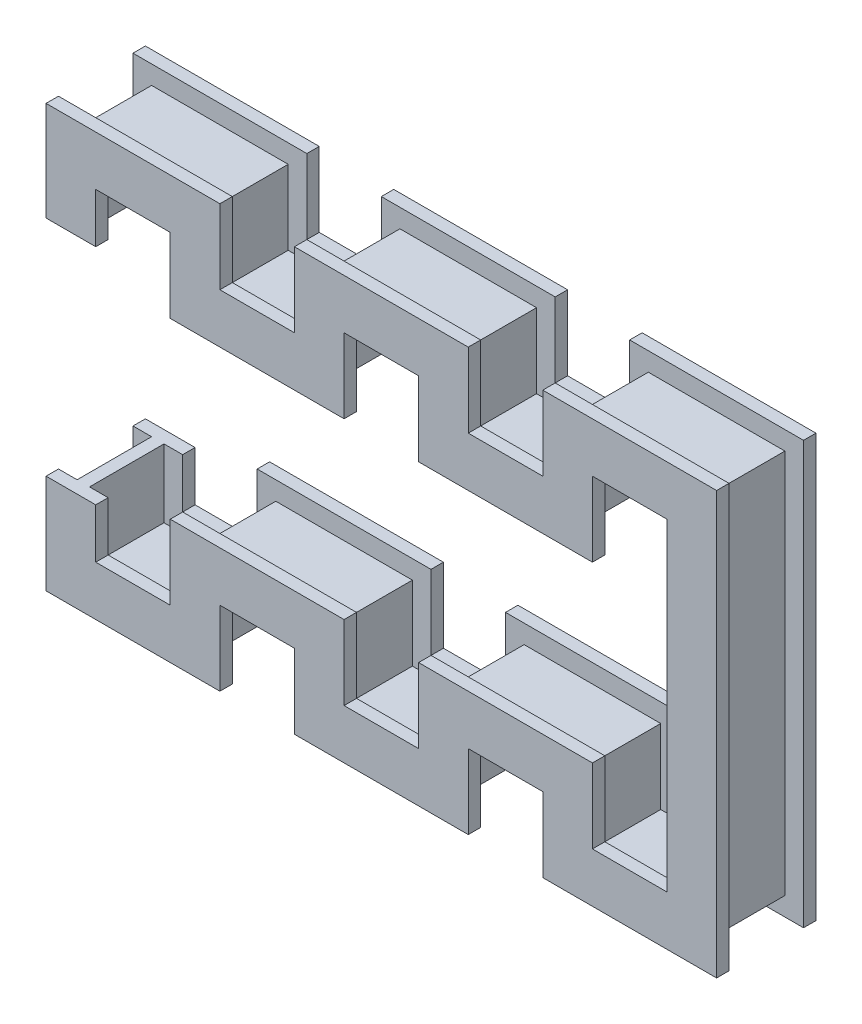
ISO-10303-21;
HEADER;
FILE_DESCRIPTION(('STEP AP214'),'2;1');
FILE_NAME('part.step','',(''),(''),'','','');
FILE_SCHEMA(('AUTOMOTIVE_DESIGN { 1 0 10303 214 1 1 1 1 }'));
ENDSEC;
DATA;
#1=APPLICATION_CONTEXT('core data for automotive mechanical design processes');
#2=APPLICATION_PROTOCOL_DEFINITION('international standard','automotive_design',2000,#1);
#3=PRODUCT_CONTEXT('',#1,'mechanical');
#4=PRODUCT('Part','Part','',(#3));
#5=PRODUCT_RELATED_PRODUCT_CATEGORY('part','',(#4));
#6=PRODUCT_DEFINITION_FORMATION('','',#4);
#7=PRODUCT_DEFINITION_CONTEXT('part definition',#1,'design');
#8=PRODUCT_DEFINITION('design','',#6,#7);
#9=PRODUCT_DEFINITION_SHAPE('','',#8);
#10=(LENGTH_UNIT() NAMED_UNIT(*) SI_UNIT(.MILLI.,.METRE.));
#11=(NAMED_UNIT(*) PLANE_ANGLE_UNIT() SI_UNIT($,.RADIAN.));
#12=(NAMED_UNIT(*) SI_UNIT($,.STERADIAN.) SOLID_ANGLE_UNIT());
#13=UNCERTAINTY_MEASURE_WITH_UNIT(LENGTH_MEASURE(1.E-05),#10,'distance_accuracy_value','');
#14=(GEOMETRIC_REPRESENTATION_CONTEXT(3) GLOBAL_UNCERTAINTY_ASSIGNED_CONTEXT((#13)) GLOBAL_UNIT_ASSIGNED_CONTEXT((#10,
#11,#12)) REPRESENTATION_CONTEXT('',''));
#15=CARTESIAN_POINT('',(0.,0.,0.));
#16=DIRECTION('',(0.,0.,1.));
#17=DIRECTION('',(1.,0.,0.));
#18=AXIS2_PLACEMENT_3D('',#15,#16,#17);
#19=CARTESIAN_POINT('',(-116.190738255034,-220.,30.));
#20=DIRECTION('',(-1.,0.,0.));
#21=DIRECTION('',(0.,0.,1.));
#22=AXIS2_PLACEMENT_3D('',#19,#20,#21);
#23=PLANE('',#22);
#24=DIRECTION('',(0.,0.,-1.));
#25=VECTOR('',#24,1.);
#26=CARTESIAN_POINT('',(-116.190738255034,-180.,30.));
#27=LINE('',#26,#25);
#28=CARTESIAN_POINT('',(-116.190738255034,-180.,40.));
#29=VERTEX_POINT('',#28);
#30=CARTESIAN_POINT('',(-116.190738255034,-180.,30.));
#31=VERTEX_POINT('',#30);
#32=EDGE_CURVE('E357',#29,#31,#27,.T.);
#33=ORIENTED_EDGE('',*,*,#32,.F.);
#34=DIRECTION('',(0.,1.,0.));
#35=VECTOR('',#34,1.);
#36=CARTESIAN_POINT('',(-116.190738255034,-220.,40.));
#37=LINE('',#36,#35);
#38=CARTESIAN_POINT('',(-116.190738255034,-220.,40.));
#39=VERTEX_POINT('',#38);
#40=EDGE_CURVE('E1988',#39,#29,#37,.T.);
#41=ORIENTED_EDGE('',*,*,#40,.F.);
#42=DIRECTION('',(0.,0.,1.));
#43=VECTOR('',#42,1.);
#44=CARTESIAN_POINT('',(-116.190738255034,-220.,30.));
#45=LINE('',#44,#43);
#46=CARTESIAN_POINT('',(-116.190738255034,-220.,30.));
#47=VERTEX_POINT('',#46);
#48=EDGE_CURVE('E1984',#47,#39,#45,.T.);
#49=ORIENTED_EDGE('',*,*,#48,.F.);
#50=DIRECTION('',(0.,1.,0.));
#51=VECTOR('',#50,1.);
#52=CARTESIAN_POINT('',(-116.190738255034,-220.,30.));
#53=LINE('',#52,#51);
#54=EDGE_CURVE('E2021',#47,#31,#53,.T.);
#55=ORIENTED_EDGE('',*,*,#54,.T.);
#56=EDGE_LOOP('',(#33,#41,#49,#55));
#57=FACE_BOUND('',#56,.T.);
#58=ADVANCED_FACE('F348',(#57),#23,.F.);
#59=CARTESIAN_POINT('',(-156.190738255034,-260.,30.));
#60=DIRECTION('',(1.,0.,0.));
#61=DIRECTION('',(0.,0.,-1.));
#62=AXIS2_PLACEMENT_3D('',#59,#60,#61);
#63=PLANE('',#62);
#64=DIRECTION('',(0.,0.,1.));
#65=VECTOR('',#64,1.);
#66=CARTESIAN_POINT('',(-156.190738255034,-180.,30.));
#67=LINE('',#66,#65);
#68=CARTESIAN_POINT('',(-156.190738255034,-180.,30.));
#69=VERTEX_POINT('',#68);
#70=CARTESIAN_POINT('',(-156.190738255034,-180.,40.));
#71=VERTEX_POINT('',#70);
#72=EDGE_CURVE('E394',#69,#71,#67,.T.);
#73=ORIENTED_EDGE('',*,*,#72,.F.);
#74=DIRECTION('',(0.,1.,0.));
#75=VECTOR('',#74,1.);
#76=CARTESIAN_POINT('',(-156.190738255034,-260.,30.));
#77=LINE('',#76,#75);
#78=CARTESIAN_POINT('',(-156.190738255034,-260.,30.));
#79=VERTEX_POINT('',#78);
#80=EDGE_CURVE('E1995',#79,#69,#77,.T.);
#81=ORIENTED_EDGE('',*,*,#80,.F.);
#82=DIRECTION('',(0.,0.,-1.));
#83=VECTOR('',#82,1.);
#84=CARTESIAN_POINT('',(-156.190738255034,-260.,30.));
#85=LINE('',#84,#83);
#86=CARTESIAN_POINT('',(-156.190738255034,-260.,40.));
#87=VERTEX_POINT('',#86);
#88=EDGE_CURVE('E1987',#87,#79,#85,.T.);
#89=ORIENTED_EDGE('',*,*,#88,.F.);
#90=DIRECTION('',(0.,1.,0.));
#91=VECTOR('',#90,1.);
#92=CARTESIAN_POINT('',(-156.190738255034,-260.,40.));
#93=LINE('',#92,#91);
#94=EDGE_CURVE('E1991',#87,#71,#93,.T.);
#95=ORIENTED_EDGE('',*,*,#94,.T.);
#96=EDGE_LOOP('',(#73,#81,#89,#95));
#97=FACE_BOUND('',#96,.T.);
#98=ADVANCED_FACE('F2447',(#97),#63,.F.);
#99=CARTESIAN_POINT('',(-141.190738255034,-245.,-30.));
#100=DIRECTION('',(1.,0.,0.));
#101=DIRECTION('',(0.,0.,-1.));
#102=AXIS2_PLACEMENT_3D('',#99,#100,#101);
#103=PLANE('',#102);
#104=DIRECTION('',(0.,0.,1.));
#105=VECTOR('',#104,1.);
#106=CARTESIAN_POINT('',(-141.190738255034,-180.,-30.));
#107=LINE('',#106,#105);
#108=CARTESIAN_POINT('',(-141.190738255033,-180.,-30.));
#109=VERTEX_POINT('',#108);
#110=CARTESIAN_POINT('',(-141.190738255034,-180.,30.));
#111=VERTEX_POINT('',#110);
#112=EDGE_CURVE('E2038',#109,#111,#107,.T.);
#113=ORIENTED_EDGE('',*,*,#112,.F.);
#114=DIRECTION('',(0.,1.,0.));
#115=VECTOR('',#114,1.);
#116=CARTESIAN_POINT('',(-141.190738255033,-245.,-30.));
#117=LINE('',#116,#115);
#118=CARTESIAN_POINT('',(-141.190738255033,-245.,-30.));
#119=VERTEX_POINT('',#118);
#120=EDGE_CURVE('E2001',#119,#109,#117,.T.);
#121=ORIENTED_EDGE('',*,*,#120,.F.);
#122=DIRECTION('',(0.,0.,-1.));
#123=VECTOR('',#122,1.);
#124=CARTESIAN_POINT('',(-141.190738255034,-245.,-30.));
#125=LINE('',#124,#123);
#126=CARTESIAN_POINT('',(-141.190738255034,-245.,30.));
#127=VERTEX_POINT('',#126);
#128=EDGE_CURVE('E2052',#127,#119,#125,.T.);
#129=ORIENTED_EDGE('',*,*,#128,.F.);
#130=DIRECTION('',(0.,1.,0.));
#131=VECTOR('',#130,1.);
#132=CARTESIAN_POINT('',(-141.190738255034,-245.,30.));
#133=LINE('',#132,#131);
#134=EDGE_CURVE('E1998',#127,#111,#133,.T.);
#135=ORIENTED_EDGE('',*,*,#134,.T.);
#136=EDGE_LOOP('',(#113,#121,#129,#135));
#137=FACE_BOUND('',#136,.T.);
#138=ADVANCED_FACE('F2444',(#137),#103,.F.);
#139=CARTESIAN_POINT('',(-156.190738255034,-260.,-40.));
#140=DIRECTION('',(1.,0.,0.));
#141=DIRECTION('',(0.,0.,-1.));
#142=AXIS2_PLACEMENT_3D('',#139,#140,#141);
#143=PLANE('',#142);
#144=DIRECTION('',(0.,0.,1.));
#145=VECTOR('',#144,1.);
#146=CARTESIAN_POINT('',(-156.190738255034,-180.,-40.));
#147=LINE('',#146,#145);
#148=CARTESIAN_POINT('',(-156.190738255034,-180.,-40.));
#149=VERTEX_POINT('',#148);
#150=CARTESIAN_POINT('',(-156.190738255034,-180.,-30.));
#151=VERTEX_POINT('',#150);
#152=EDGE_CURVE('E2034',#149,#151,#147,.T.);
#153=ORIENTED_EDGE('',*,*,#152,.F.);
#154=DIRECTION('',(0.,1.,0.));
#155=VECTOR('',#154,1.);
#156=CARTESIAN_POINT('',(-156.190738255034,-260.,-40.));
#157=LINE('',#156,#155);
#158=CARTESIAN_POINT('',(-156.190738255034,-260.,-40.));
#159=VERTEX_POINT('',#158);
#160=EDGE_CURVE('E2007',#159,#149,#157,.T.);
#161=ORIENTED_EDGE('',*,*,#160,.F.);
#162=DIRECTION('',(0.,0.,-1.));
#163=VECTOR('',#162,1.);
#164=CARTESIAN_POINT('',(-156.190738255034,-260.,-40.));
#165=LINE('',#164,#163);
#166=CARTESIAN_POINT('',(-156.190738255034,-260.,-30.));
#167=VERTEX_POINT('',#166);
#168=EDGE_CURVE('E2049',#167,#159,#165,.T.);
#169=ORIENTED_EDGE('',*,*,#168,.F.);
#170=DIRECTION('',(0.,1.,0.));
#171=VECTOR('',#170,1.);
#172=CARTESIAN_POINT('',(-156.190738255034,-260.,-30.));
#173=LINE('',#172,#171);
#174=EDGE_CURVE('E2004',#167,#151,#173,.T.);
#175=ORIENTED_EDGE('',*,*,#174,.T.);
#176=EDGE_LOOP('',(#153,#161,#169,#175));
#177=FACE_BOUND('',#176,.T.);
#178=ADVANCED_FACE('F2439',(#177),#143,.F.);
#179=CARTESIAN_POINT('',(-116.190738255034,-220.,-30.));
#180=DIRECTION('',(-1.,0.,0.));
#181=DIRECTION('',(0.,0.,1.));
#182=AXIS2_PLACEMENT_3D('',#179,#180,#181);
#183=PLANE('',#182);
#184=DIRECTION('',(0.,0.,-1.));
#185=VECTOR('',#184,1.);
#186=CARTESIAN_POINT('',(-116.190738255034,-180.,-30.));
#187=LINE('',#186,#185);
#188=CARTESIAN_POINT('',(-116.190738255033,-180.,-30.));
#189=VERTEX_POINT('',#188);
#190=CARTESIAN_POINT('',(-116.190738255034,-180.,-40.));
#191=VERTEX_POINT('',#190);
#192=EDGE_CURVE('E2028',#189,#191,#187,.T.);
#193=ORIENTED_EDGE('',*,*,#192,.F.);
#194=DIRECTION('',(0.,1.,0.));
#195=VECTOR('',#194,1.);
#196=CARTESIAN_POINT('',(-116.190738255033,-220.,-30.));
#197=LINE('',#196,#195);
#198=CARTESIAN_POINT('',(-116.190738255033,-220.,-30.));
#199=VERTEX_POINT('',#198);
#200=EDGE_CURVE('E2013',#199,#189,#197,.T.);
#201=ORIENTED_EDGE('',*,*,#200,.F.);
#202=DIRECTION('',(0.,0.,1.));
#203=VECTOR('',#202,1.);
#204=CARTESIAN_POINT('',(-116.190738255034,-220.,-30.));
#205=LINE('',#204,#203);
#206=CARTESIAN_POINT('',(-116.190738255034,-220.,-40.));
#207=VERTEX_POINT('',#206);
#208=EDGE_CURVE('E2046',#207,#199,#205,.T.);
#209=ORIENTED_EDGE('',*,*,#208,.F.);
#210=DIRECTION('',(0.,1.,0.));
#211=VECTOR('',#210,1.);
#212=CARTESIAN_POINT('',(-116.190738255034,-220.,-40.));
#213=LINE('',#212,#211);
#214=EDGE_CURVE('E2010',#207,#191,#213,.T.);
#215=ORIENTED_EDGE('',*,*,#214,.T.);
#216=EDGE_LOOP('',(#193,#201,#209,#215));
#217=FACE_BOUND('',#216,.T.);
#218=ADVANCED_FACE('F2433',(#217),#183,.F.);
#219=CARTESIAN_POINT('',(-131.190738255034,-235.,-30.));
#220=DIRECTION('',(-1.,0.,0.));
#221=DIRECTION('',(0.,0.,1.));
#222=AXIS2_PLACEMENT_3D('',#219,#220,#221);
#223=PLANE('',#222);
#224=DIRECTION('',(0.,0.,-1.));
#225=VECTOR('',#224,1.);
#226=CARTESIAN_POINT('',(-131.190738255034,-180.,-30.));
#227=LINE('',#226,#225);
#228=CARTESIAN_POINT('',(-131.190738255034,-180.,30.));
#229=VERTEX_POINT('',#228);
#230=CARTESIAN_POINT('',(-131.190738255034,-180.,-30.));
#231=VERTEX_POINT('',#230);
#232=EDGE_CURVE('E2022',#229,#231,#227,.T.);
#233=ORIENTED_EDGE('',*,*,#232,.F.);
#234=DIRECTION('',(0.,1.,0.));
#235=VECTOR('',#234,1.);
#236=CARTESIAN_POINT('',(-131.190738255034,-235.,30.));
#237=LINE('',#236,#235);
#238=CARTESIAN_POINT('',(-131.190738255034,-235.,30.));
#239=VERTEX_POINT('',#238);
#240=EDGE_CURVE('E2019',#239,#229,#237,.T.);
#241=ORIENTED_EDGE('',*,*,#240,.F.);
#242=DIRECTION('',(0.,0.,1.));
#243=VECTOR('',#242,1.);
#244=CARTESIAN_POINT('',(-131.190738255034,-235.,-30.));
#245=LINE('',#244,#243);
#246=CARTESIAN_POINT('',(-131.190738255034,-235.,-30.));
#247=VERTEX_POINT('',#246);
#248=EDGE_CURVE('E1992',#247,#239,#245,.T.);
#249=ORIENTED_EDGE('',*,*,#248,.F.);
#250=DIRECTION('',(0.,1.,0.));
#251=VECTOR('',#250,1.);
#252=CARTESIAN_POINT('',(-131.190738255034,-235.,-30.));
#253=LINE('',#252,#251);
#254=EDGE_CURVE('E2016',#247,#231,#253,.T.);
#255=ORIENTED_EDGE('',*,*,#254,.T.);
#256=EDGE_LOOP('',(#233,#241,#249,#255));
#257=FACE_BOUND('',#256,.T.);
#258=ADVANCED_FACE('F350',(#257),#223,.F.);
#259=CARTESIAN_POINT('',(-16.1907382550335,-260.,30.));
#260=DIRECTION('',(0.,-1.,0.));
#261=DIRECTION('',(0.,0.,-1.));
#262=AXIS2_PLACEMENT_3D('',#259,#260,#261);
#263=PLANE('',#262);
#264=DIRECTION('',(-1.,0.,0.));
#265=VECTOR('',#264,1.);
#266=CARTESIAN_POINT('',(-16.1907382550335,-260.,40.));
#267=LINE('',#266,#265);
#268=CARTESIAN_POINT('',(-16.1907382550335,-260.,40.));
#269=VERTEX_POINT('',#268);
#270=EDGE_CURVE('E1947',#269,#87,#267,.T.);
#271=ORIENTED_EDGE('',*,*,#270,.T.);
#272=ORIENTED_EDGE('',*,*,#88,.T.);
#273=DIRECTION('',(-1.,0.,0.));
#274=VECTOR('',#273,1.);
#275=CARTESIAN_POINT('',(-16.1907382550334,-260.,30.));
#276=LINE('',#275,#274);
#277=CARTESIAN_POINT('',(-16.1907382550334,-260.,30.));
#278=VERTEX_POINT('',#277);
#279=EDGE_CURVE('E1951',#278,#79,#276,.T.);
#280=ORIENTED_EDGE('',*,*,#279,.F.);
#281=DIRECTION('',(0.,0.,1.));
#282=VECTOR('',#281,1.);
#283=CARTESIAN_POINT('',(-16.1907382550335,-260.,30.));
#284=LINE('',#283,#282);
#285=EDGE_CURVE('E1948',#278,#269,#284,.T.);
#286=ORIENTED_EDGE('',*,*,#285,.T.);
#287=EDGE_LOOP('',(#271,#272,#280,#286));
#288=FACE_BOUND('',#287,.T.);
#289=ADVANCED_FACE('F2537',(#288),#263,.T.);
#290=CARTESIAN_POINT('',(-31.1907382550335,-245.,-30.));
#291=DIRECTION('',(0.,-1.,0.));
#292=DIRECTION('',(0.,0.,-1.));
#293=AXIS2_PLACEMENT_3D('',#290,#291,#292);
#294=PLANE('',#293);
#295=DIRECTION('',(-1.,0.,0.));
#296=VECTOR('',#295,1.);
#297=CARTESIAN_POINT('',(-31.1907382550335,-245.,30.));
#298=LINE('',#297,#296);
#299=CARTESIAN_POINT('',(-31.1907382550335,-245.,30.));
#300=VERTEX_POINT('',#299);
#301=EDGE_CURVE('E1954',#300,#127,#298,.T.);
#302=ORIENTED_EDGE('',*,*,#301,.T.);
#303=ORIENTED_EDGE('',*,*,#128,.T.);
#304=DIRECTION('',(-1.,0.,0.));
#305=VECTOR('',#304,1.);
#306=CARTESIAN_POINT('',(-31.1907382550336,-245.,-30.));
#307=LINE('',#306,#305);
#308=CARTESIAN_POINT('',(-31.1907382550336,-245.,-30.));
#309=VERTEX_POINT('',#308);
#310=EDGE_CURVE('E1957',#309,#119,#307,.T.);
#311=ORIENTED_EDGE('',*,*,#310,.F.);
#312=DIRECTION('',(0.,0.,1.));
#313=VECTOR('',#312,1.);
#314=CARTESIAN_POINT('',(-31.1907382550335,-245.,-30.));
#315=LINE('',#314,#313);
#316=EDGE_CURVE('E2065',#309,#300,#315,.T.);
#317=ORIENTED_EDGE('',*,*,#316,.T.);
#318=EDGE_LOOP('',(#302,#303,#311,#317));
#319=FACE_BOUND('',#318,.T.);
#320=ADVANCED_FACE('F2541',(#319),#294,.T.);
#321=CARTESIAN_POINT('',(-16.1907382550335,-260.,-40.));
#322=DIRECTION('',(0.,-1.,0.));
#323=DIRECTION('',(0.,0.,-1.));
#324=AXIS2_PLACEMENT_3D('',#321,#322,#323);
#325=PLANE('',#324);
#326=DIRECTION('',(-1.,0.,0.));
#327=VECTOR('',#326,1.);
#328=CARTESIAN_POINT('',(-16.1907382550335,-260.,-30.));
#329=LINE('',#328,#327);
#330=CARTESIAN_POINT('',(-16.1907382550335,-260.,-30.));
#331=VERTEX_POINT('',#330);
#332=EDGE_CURVE('E1960',#331,#167,#329,.T.);
#333=ORIENTED_EDGE('',*,*,#332,.T.);
#334=ORIENTED_EDGE('',*,*,#168,.T.);
#335=DIRECTION('',(-1.,0.,0.));
#336=VECTOR('',#335,1.);
#337=CARTESIAN_POINT('',(-16.1907382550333,-260.,-40.));
#338=LINE('',#337,#336);
#339=CARTESIAN_POINT('',(-16.1907382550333,-260.,-40.));
#340=VERTEX_POINT('',#339);
#341=EDGE_CURVE('E1963',#340,#159,#338,.T.);
#342=ORIENTED_EDGE('',*,*,#341,.F.);
#343=DIRECTION('',(0.,0.,1.));
#344=VECTOR('',#343,1.);
#345=CARTESIAN_POINT('',(-16.1907382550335,-260.,-40.));
#346=LINE('',#345,#344);
#347=EDGE_CURVE('E2062',#340,#331,#346,.T.);
#348=ORIENTED_EDGE('',*,*,#347,.T.);
#349=EDGE_LOOP('',(#333,#334,#342,#348));
#350=FACE_BOUND('',#349,.T.);
#351=ADVANCED_FACE('F2547',(#350),#325,.T.);
#352=CARTESIAN_POINT('',(-56.1907382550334,-220.,-30.));
#353=DIRECTION('',(0.,1.,0.));
#354=DIRECTION('',(0.,0.,1.));
#355=AXIS2_PLACEMENT_3D('',#352,#353,#354);
#356=PLANE('',#355);
#357=DIRECTION('',(-1.,0.,0.));
#358=VECTOR('',#357,1.);
#359=CARTESIAN_POINT('',(-56.1907382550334,-220.,-40.));
#360=LINE('',#359,#358);
#361=CARTESIAN_POINT('',(-56.1907382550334,-220.,-40.));
#362=VERTEX_POINT('',#361);
#363=EDGE_CURVE('E1966',#362,#207,#360,.T.);
#364=ORIENTED_EDGE('',*,*,#363,.T.);
#365=ORIENTED_EDGE('',*,*,#208,.T.);
#366=DIRECTION('',(-1.,0.,0.));
#367=VECTOR('',#366,1.);
#368=CARTESIAN_POINT('',(-56.1907382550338,-220.,-30.));
#369=LINE('',#368,#367);
#370=CARTESIAN_POINT('',(-56.1907382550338,-220.,-30.));
#371=VERTEX_POINT('',#370);
#372=EDGE_CURVE('E1969',#371,#199,#369,.T.);
#373=ORIENTED_EDGE('',*,*,#372,.F.);
#374=DIRECTION('',(0.,0.,-1.));
#375=VECTOR('',#374,1.);
#376=CARTESIAN_POINT('',(-56.1907382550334,-220.,-30.));
#377=LINE('',#376,#375);
#378=EDGE_CURVE('E2059',#371,#362,#377,.T.);
#379=ORIENTED_EDGE('',*,*,#378,.T.);
#380=EDGE_LOOP('',(#364,#365,#373,#379));
#381=FACE_BOUND('',#380,.T.);
#382=ADVANCED_FACE('F2429',(#381),#356,.T.);
#383=CARTESIAN_POINT('',(-41.1907382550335,-235.,-30.));
#384=DIRECTION('',(0.,1.,0.));
#385=DIRECTION('',(0.,0.,1.));
#386=AXIS2_PLACEMENT_3D('',#383,#384,#385);
#387=PLANE('',#386);
#388=DIRECTION('',(-1.,0.,0.));
#389=VECTOR('',#388,1.);
#390=CARTESIAN_POINT('',(-41.1907382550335,-235.,-30.));
#391=LINE('',#390,#389);
#392=CARTESIAN_POINT('',(-41.1907382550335,-235.,-30.));
#393=VERTEX_POINT('',#392);
#394=EDGE_CURVE('E1972',#393,#247,#391,.T.);
#395=ORIENTED_EDGE('',*,*,#394,.T.);
#396=ORIENTED_EDGE('',*,*,#248,.T.);
#397=DIRECTION('',(-1.,0.,0.));
#398=VECTOR('',#397,1.);
#399=CARTESIAN_POINT('',(-41.1907382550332,-235.,30.));
#400=LINE('',#399,#398);
#401=CARTESIAN_POINT('',(-41.1907382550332,-235.,30.));
#402=VERTEX_POINT('',#401);
#403=EDGE_CURVE('E1975',#402,#239,#400,.T.);
#404=ORIENTED_EDGE('',*,*,#403,.F.);
#405=DIRECTION('',(0.,0.,-1.));
#406=VECTOR('',#405,1.);
#407=CARTESIAN_POINT('',(-41.1907382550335,-235.,-30.));
#408=LINE('',#407,#406);
#409=EDGE_CURVE('E1943',#402,#393,#408,.T.);
#410=ORIENTED_EDGE('',*,*,#409,.T.);
#411=EDGE_LOOP('',(#395,#396,#404,#410));
#412=FACE_BOUND('',#411,.T.);
#413=ADVANCED_FACE('F2457',(#412),#387,.T.);
#414=CARTESIAN_POINT('',(-56.1907382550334,-220.,30.));
#415=DIRECTION('',(0.,1.,0.));
#416=DIRECTION('',(0.,0.,1.));
#417=AXIS2_PLACEMENT_3D('',#414,#415,#416);
#418=PLANE('',#417);
#419=DIRECTION('',(-1.,0.,0.));
#420=VECTOR('',#419,1.);
#421=CARTESIAN_POINT('',(-56.1907382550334,-220.,30.));
#422=LINE('',#421,#420);
#423=CARTESIAN_POINT('',(-56.1907382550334,-220.,30.));
#424=VERTEX_POINT('',#423);
#425=EDGE_CURVE('E1978',#424,#47,#422,.T.);
#426=ORIENTED_EDGE('',*,*,#425,.T.);
#427=ORIENTED_EDGE('',*,*,#48,.T.);
#428=DIRECTION('',(-1.,0.,0.));
#429=VECTOR('',#428,1.);
#430=CARTESIAN_POINT('',(-56.1907382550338,-220.,40.));
#431=LINE('',#430,#429);
#432=CARTESIAN_POINT('',(-56.1907382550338,-220.,40.));
#433=VERTEX_POINT('',#432);
#434=EDGE_CURVE('E1981',#433,#39,#431,.T.);
#435=ORIENTED_EDGE('',*,*,#434,.F.);
#436=DIRECTION('',(0.,0.,-1.));
#437=VECTOR('',#436,1.);
#438=CARTESIAN_POINT('',(-56.1907382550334,-220.,30.));
#439=LINE('',#438,#437);
#440=EDGE_CURVE('E1944',#433,#424,#439,.T.);
#441=ORIENTED_EDGE('',*,*,#440,.T.);
#442=EDGE_LOOP('',(#426,#427,#435,#441));
#443=FACE_BOUND('',#442,.T.);
#444=ADVANCED_FACE('F2449',(#443),#418,.T.);
#445=CARTESIAN_POINT('',(-16.1907382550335,-200.,30.));
#446=DIRECTION('',(-1.,0.,0.));
#447=DIRECTION('',(0.,-1.,0.));
#448=AXIS2_PLACEMENT_3D('',#445,#446,#447);
#449=PLANE('',#448);
#450=ORIENTED_EDGE('',*,*,#285,.F.);
#451=DIRECTION('',(0.,-1.,0.));
#452=VECTOR('',#451,1.);
#453=CARTESIAN_POINT('',(-16.1907382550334,-200.,30.));
#454=LINE('',#453,#452);
#455=CARTESIAN_POINT('',(-16.1907382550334,-200.,30.));
#456=VERTEX_POINT('',#455);
#457=EDGE_CURVE('E1909',#456,#278,#454,.T.);
#458=ORIENTED_EDGE('',*,*,#457,.F.);
#459=DIRECTION('',(0.,0.,-1.));
#460=VECTOR('',#459,1.);
#461=CARTESIAN_POINT('',(-16.1907382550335,-200.,30.));
#462=LINE('',#461,#460);
#463=CARTESIAN_POINT('',(-16.1907382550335,-200.,40.));
#464=VERTEX_POINT('',#463);
#465=EDGE_CURVE('E1905',#464,#456,#462,.T.);
#466=ORIENTED_EDGE('',*,*,#465,.F.);
#467=DIRECTION('',(0.,-1.,0.));
#468=VECTOR('',#467,1.);
#469=CARTESIAN_POINT('',(-16.1907382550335,-200.,40.));
#470=LINE('',#469,#468);
#471=EDGE_CURVE('E1906',#464,#269,#470,.T.);
#472=ORIENTED_EDGE('',*,*,#471,.T.);
#473=EDGE_LOOP('',(#450,#458,#466,#472));
#474=FACE_BOUND('',#473,.T.);
#475=ADVANCED_FACE('F2562',(#474),#449,.F.);
#476=CARTESIAN_POINT('',(-31.1907382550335,-185.,-30.));
#477=DIRECTION('',(-1.,0.,0.));
#478=DIRECTION('',(0.,-1.,0.));
#479=AXIS2_PLACEMENT_3D('',#476,#477,#478);
#480=PLANE('',#479);
#481=ORIENTED_EDGE('',*,*,#316,.F.);
#482=DIRECTION('',(0.,-1.,0.));
#483=VECTOR('',#482,1.);
#484=CARTESIAN_POINT('',(-31.1907382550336,-185.,-30.));
#485=LINE('',#484,#483);
#486=CARTESIAN_POINT('',(-31.1907382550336,-185.,-30.));
#487=VERTEX_POINT('',#486);
#488=EDGE_CURVE('E1916',#487,#309,#485,.T.);
#489=ORIENTED_EDGE('',*,*,#488,.F.);
#490=DIRECTION('',(0.,0.,-1.));
#491=VECTOR('',#490,1.);
#492=CARTESIAN_POINT('',(-31.1907382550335,-185.,-30.));
#493=LINE('',#492,#491);
#494=CARTESIAN_POINT('',(-31.1907382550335,-185.,30.));
#495=VERTEX_POINT('',#494);
#496=EDGE_CURVE('E2081',#495,#487,#493,.T.);
#497=ORIENTED_EDGE('',*,*,#496,.F.);
#498=DIRECTION('',(0.,-1.,0.));
#499=VECTOR('',#498,1.);
#500=CARTESIAN_POINT('',(-31.1907382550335,-185.,30.));
#501=LINE('',#500,#499);
#502=EDGE_CURVE('E1913',#495,#300,#501,.T.);
#503=ORIENTED_EDGE('',*,*,#502,.T.);
#504=EDGE_LOOP('',(#481,#489,#497,#503));
#505=FACE_BOUND('',#504,.T.);
#506=ADVANCED_FACE('F2566',(#505),#480,.F.);
#507=CARTESIAN_POINT('',(-16.1907382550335,-200.,-40.));
#508=DIRECTION('',(-1.,0.,0.));
#509=DIRECTION('',(0.,-1.,0.));
#510=AXIS2_PLACEMENT_3D('',#507,#508,#509);
#511=PLANE('',#510);
#512=ORIENTED_EDGE('',*,*,#347,.F.);
#513=DIRECTION('',(0.,-1.,0.));
#514=VECTOR('',#513,1.);
#515=CARTESIAN_POINT('',(-16.1907382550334,-200.,-40.));
#516=LINE('',#515,#514);
#517=CARTESIAN_POINT('',(-16.1907382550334,-200.,-40.));
#518=VERTEX_POINT('',#517);
#519=EDGE_CURVE('E1922',#518,#340,#516,.T.);
#520=ORIENTED_EDGE('',*,*,#519,.F.);
#521=DIRECTION('',(0.,0.,-1.));
#522=VECTOR('',#521,1.);
#523=CARTESIAN_POINT('',(-16.1907382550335,-200.,-40.));
#524=LINE('',#523,#522);
#525=CARTESIAN_POINT('',(-16.1907382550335,-200.,-30.));
#526=VERTEX_POINT('',#525);
#527=EDGE_CURVE('E2078',#526,#518,#524,.T.);
#528=ORIENTED_EDGE('',*,*,#527,.F.);
#529=DIRECTION('',(0.,-1.,0.));
#530=VECTOR('',#529,1.);
#531=CARTESIAN_POINT('',(-16.1907382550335,-200.,-30.));
#532=LINE('',#531,#530);
#533=EDGE_CURVE('E1919',#526,#331,#532,.T.);
#534=ORIENTED_EDGE('',*,*,#533,.T.);
#535=EDGE_LOOP('',(#512,#520,#528,#534));
#536=FACE_BOUND('',#535,.T.);
#537=ADVANCED_FACE('F2572',(#536),#511,.F.);
#538=CARTESIAN_POINT('',(-56.1907382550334,-160.,-30.));
#539=DIRECTION('',(1.,0.,0.));
#540=DIRECTION('',(0.,1.,0.));
#541=AXIS2_PLACEMENT_3D('',#538,#539,#540);
#542=PLANE('',#541);
#543=ORIENTED_EDGE('',*,*,#378,.F.);
#544=DIRECTION('',(0.,-1.,0.));
#545=VECTOR('',#544,1.);
#546=CARTESIAN_POINT('',(-56.1907382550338,-160.,-30.));
#547=LINE('',#546,#545);
#548=CARTESIAN_POINT('',(-56.1907382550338,-160.,-30.));
#549=VERTEX_POINT('',#548);
#550=EDGE_CURVE('E1928',#549,#371,#547,.T.);
#551=ORIENTED_EDGE('',*,*,#550,.F.);
#552=DIRECTION('',(0.,0.,1.));
#553=VECTOR('',#552,1.);
#554=CARTESIAN_POINT('',(-56.1907382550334,-160.,-30.));
#555=LINE('',#554,#553);
#556=CARTESIAN_POINT('',(-56.1907382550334,-160.,-40.));
#557=VERTEX_POINT('',#556);
#558=EDGE_CURVE('E2075',#557,#549,#555,.T.);
#559=ORIENTED_EDGE('',*,*,#558,.F.);
#560=DIRECTION('',(0.,-1.,0.));
#561=VECTOR('',#560,1.);
#562=CARTESIAN_POINT('',(-56.1907382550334,-160.,-40.));
#563=LINE('',#562,#561);
#564=EDGE_CURVE('E1925',#557,#362,#563,.T.);
#565=ORIENTED_EDGE('',*,*,#564,.T.);
#566=EDGE_LOOP('',(#543,#551,#559,#565));
#567=FACE_BOUND('',#566,.T.);
#568=ADVANCED_FACE('F2427',(#567),#542,.F.);
#569=CARTESIAN_POINT('',(-41.1907382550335,-175.,-30.));
#570=DIRECTION('',(1.,0.,0.));
#571=DIRECTION('',(0.,1.,0.));
#572=AXIS2_PLACEMENT_3D('',#569,#570,#571);
#573=PLANE('',#572);
#574=ORIENTED_EDGE('',*,*,#409,.F.);
#575=DIRECTION('',(0.,-1.,0.));
#576=VECTOR('',#575,1.);
#577=CARTESIAN_POINT('',(-41.1907382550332,-175.,30.));
#578=LINE('',#577,#576);
#579=CARTESIAN_POINT('',(-41.1907382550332,-175.,30.));
#580=VERTEX_POINT('',#579);
#581=EDGE_CURVE('E1934',#580,#402,#578,.T.);
#582=ORIENTED_EDGE('',*,*,#581,.F.);
#583=DIRECTION('',(0.,0.,1.));
#584=VECTOR('',#583,1.);
#585=CARTESIAN_POINT('',(-41.1907382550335,-175.,-30.));
#586=LINE('',#585,#584);
#587=CARTESIAN_POINT('',(-41.1907382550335,-175.,-30.));
#588=VERTEX_POINT('',#587);
#589=EDGE_CURVE('E2072',#588,#580,#586,.T.);
#590=ORIENTED_EDGE('',*,*,#589,.F.);
#591=DIRECTION('',(0.,-1.,0.));
#592=VECTOR('',#591,1.);
#593=CARTESIAN_POINT('',(-41.1907382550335,-175.,-30.));
#594=LINE('',#593,#592);
#595=EDGE_CURVE('E1931',#588,#393,#594,.T.);
#596=ORIENTED_EDGE('',*,*,#595,.T.);
#597=EDGE_LOOP('',(#574,#582,#590,#596));
#598=FACE_BOUND('',#597,.T.);
#599=ADVANCED_FACE('F2459',(#598),#573,.F.);
#600=CARTESIAN_POINT('',(-56.1907382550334,-160.,30.));
#601=DIRECTION('',(1.,0.,0.));
#602=DIRECTION('',(0.,1.,0.));
#603=AXIS2_PLACEMENT_3D('',#600,#601,#602);
#604=PLANE('',#603);
#605=ORIENTED_EDGE('',*,*,#440,.F.);
#606=DIRECTION('',(0.,-1.,0.));
#607=VECTOR('',#606,1.);
#608=CARTESIAN_POINT('',(-56.1907382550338,-160.,40.));
#609=LINE('',#608,#607);
#610=CARTESIAN_POINT('',(-56.1907382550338,-160.,40.));
#611=VERTEX_POINT('',#610);
#612=EDGE_CURVE('E1940',#611,#433,#609,.T.);
#613=ORIENTED_EDGE('',*,*,#612,.F.);
#614=DIRECTION('',(0.,0.,1.));
#615=VECTOR('',#614,1.);
#616=CARTESIAN_POINT('',(-56.1907382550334,-160.,30.));
#617=LINE('',#616,#615);
#618=CARTESIAN_POINT('',(-56.1907382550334,-160.,30.));
#619=VERTEX_POINT('',#618);
#620=EDGE_CURVE('E1910',#619,#611,#617,.T.);
#621=ORIENTED_EDGE('',*,*,#620,.F.);
#622=DIRECTION('',(0.,-1.,0.));
#623=VECTOR('',#622,1.);
#624=CARTESIAN_POINT('',(-56.1907382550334,-160.,30.));
#625=LINE('',#624,#623);
#626=EDGE_CURVE('E1937',#619,#424,#625,.T.);
#627=ORIENTED_EDGE('',*,*,#626,.T.);
#628=EDGE_LOOP('',(#605,#613,#621,#627));
#629=FACE_BOUND('',#628,.T.);
#630=ADVANCED_FACE('F2551',(#629),#604,.F.);
#631=CARTESIAN_POINT('',(43.8092617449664,-200.,30.));
#632=DIRECTION('',(0.,-1.,0.));
#633=DIRECTION('',(1.,0.,0.));
#634=AXIS2_PLACEMENT_3D('',#631,#632,#633);
#635=PLANE('',#634);
#636=DIRECTION('',(-1.,0.,0.));
#637=VECTOR('',#636,1.);
#638=CARTESIAN_POINT('',(43.8092617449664,-200.,40.));
#639=LINE('',#638,#637);
#640=CARTESIAN_POINT('',(43.8092617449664,-200.,40.));
#641=VERTEX_POINT('',#640);
#642=EDGE_CURVE('E1902',#641,#464,#639,.T.);
#643=ORIENTED_EDGE('',*,*,#642,.T.);
#644=ORIENTED_EDGE('',*,*,#465,.T.);
#645=DIRECTION('',(-1.,0.,0.));
#646=VECTOR('',#645,1.);
#647=CARTESIAN_POINT('',(43.8092617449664,-200.,30.));
#648=LINE('',#647,#646);
#649=CARTESIAN_POINT('',(43.8092617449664,-200.,30.));
#650=VERTEX_POINT('',#649);
#651=EDGE_CURVE('E1868',#650,#456,#648,.T.);
#652=ORIENTED_EDGE('',*,*,#651,.F.);
#653=DIRECTION('',(0.,0.,1.));
#654=VECTOR('',#653,1.);
#655=CARTESIAN_POINT('',(43.8092617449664,-200.,30.));
#656=LINE('',#655,#654);
#657=EDGE_CURVE('E1872',#650,#641,#656,.T.);
#658=ORIENTED_EDGE('',*,*,#657,.T.);
#659=EDGE_LOOP('',(#643,#644,#652,#658));
#660=FACE_BOUND('',#659,.T.);
#661=ADVANCED_FACE('F2588',(#660),#635,.T.);
#662=CARTESIAN_POINT('',(58.8092617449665,-185.,-30.));
#663=DIRECTION('',(0.,-1.,0.));
#664=DIRECTION('',(1.,0.,0.));
#665=AXIS2_PLACEMENT_3D('',#662,#663,#664);
#666=PLANE('',#665);
#667=DIRECTION('',(-1.,0.,0.));
#668=VECTOR('',#667,1.);
#669=CARTESIAN_POINT('',(58.8092617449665,-185.,30.));
#670=LINE('',#669,#668);
#671=CARTESIAN_POINT('',(58.8092617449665,-185.,30.));
#672=VERTEX_POINT('',#671);
#673=EDGE_CURVE('E1871',#672,#495,#670,.T.);
#674=ORIENTED_EDGE('',*,*,#673,.T.);
#675=ORIENTED_EDGE('',*,*,#496,.T.);
#676=DIRECTION('',(-1.,0.,0.));
#677=VECTOR('',#676,1.);
#678=CARTESIAN_POINT('',(58.8092617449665,-185.,-30.));
#679=LINE('',#678,#677);
#680=CARTESIAN_POINT('',(58.8092617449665,-185.,-30.));
#681=VERTEX_POINT('',#680);
#682=EDGE_CURVE('E1875',#681,#487,#679,.T.);
#683=ORIENTED_EDGE('',*,*,#682,.F.);
#684=DIRECTION('',(0.,0.,1.));
#685=VECTOR('',#684,1.);
#686=CARTESIAN_POINT('',(58.8092617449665,-185.,-30.));
#687=LINE('',#686,#685);
#688=EDGE_CURVE('E2097',#681,#672,#687,.T.);
#689=ORIENTED_EDGE('',*,*,#688,.T.);
#690=EDGE_LOOP('',(#674,#675,#683,#689));
#691=FACE_BOUND('',#690,.T.);
#692=ADVANCED_FACE('F2593',(#691),#666,.T.);
#693=CARTESIAN_POINT('',(43.8092617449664,-200.,-40.));
#694=DIRECTION('',(0.,-1.,0.));
#695=DIRECTION('',(1.,0.,0.));
#696=AXIS2_PLACEMENT_3D('',#693,#694,#695);
#697=PLANE('',#696);
#698=DIRECTION('',(-1.,0.,0.));
#699=VECTOR('',#698,1.);
#700=CARTESIAN_POINT('',(43.8092617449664,-200.,-30.));
#701=LINE('',#700,#699);
#702=CARTESIAN_POINT('',(43.8092617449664,-200.,-30.));
#703=VERTEX_POINT('',#702);
#704=EDGE_CURVE('E1878',#703,#526,#701,.T.);
#705=ORIENTED_EDGE('',*,*,#704,.T.);
#706=ORIENTED_EDGE('',*,*,#527,.T.);
#707=DIRECTION('',(-1.,0.,0.));
#708=VECTOR('',#707,1.);
#709=CARTESIAN_POINT('',(43.8092617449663,-200.,-40.));
#710=LINE('',#709,#708);
#711=CARTESIAN_POINT('',(43.8092617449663,-200.,-40.));
#712=VERTEX_POINT('',#711);
#713=EDGE_CURVE('E1881',#712,#518,#710,.T.);
#714=ORIENTED_EDGE('',*,*,#713,.F.);
#715=DIRECTION('',(0.,0.,1.));
#716=VECTOR('',#715,1.);
#717=CARTESIAN_POINT('',(43.8092617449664,-200.,-40.));
#718=LINE('',#717,#716);
#719=EDGE_CURVE('E2094',#712,#703,#718,.T.);
#720=ORIENTED_EDGE('',*,*,#719,.T.);
#721=EDGE_LOOP('',(#705,#706,#714,#720));
#722=FACE_BOUND('',#721,.T.);
#723=ADVANCED_FACE('F3532',(#722),#697,.T.);
#724=CARTESIAN_POINT('',(83.8092617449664,-160.,-30.));
#725=DIRECTION('',(0.,1.,0.));
#726=DIRECTION('',(-1.,0.,0.));
#727=AXIS2_PLACEMENT_3D('',#724,#725,#726);
#728=PLANE('',#727);
#729=DIRECTION('',(-1.,0.,0.));
#730=VECTOR('',#729,1.);
#731=CARTESIAN_POINT('',(83.8092617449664,-160.,-40.));
#732=LINE('',#731,#730);
#733=CARTESIAN_POINT('',(83.8092617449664,-160.,-40.));
#734=VERTEX_POINT('',#733);
#735=EDGE_CURVE('E1884',#734,#557,#732,.T.);
#736=ORIENTED_EDGE('',*,*,#735,.T.);
#737=ORIENTED_EDGE('',*,*,#558,.T.);
#738=DIRECTION('',(-1.,0.,0.));
#739=VECTOR('',#738,1.);
#740=CARTESIAN_POINT('',(83.8092617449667,-160.,-30.));
#741=LINE('',#740,#739);
#742=CARTESIAN_POINT('',(83.8092617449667,-160.,-30.));
#743=VERTEX_POINT('',#742);
#744=EDGE_CURVE('E1887',#743,#549,#741,.T.);
#745=ORIENTED_EDGE('',*,*,#744,.F.);
#746=DIRECTION('',(0.,0.,-1.));
#747=VECTOR('',#746,1.);
#748=CARTESIAN_POINT('',(83.8092617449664,-160.,-30.));
#749=LINE('',#748,#747);
#750=EDGE_CURVE('E2091',#743,#734,#749,.T.);
#751=ORIENTED_EDGE('',*,*,#750,.T.);
#752=EDGE_LOOP('',(#736,#737,#745,#751));
#753=FACE_BOUND('',#752,.T.);
#754=ADVANCED_FACE('F2424',(#753),#728,.T.);
#755=CARTESIAN_POINT('',(68.8092617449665,-175.,-30.));
#756=DIRECTION('',(0.,1.,0.));
#757=DIRECTION('',(-1.,0.,0.));
#758=AXIS2_PLACEMENT_3D('',#755,#756,#757);
#759=PLANE('',#758);
#760=DIRECTION('',(-1.,0.,0.));
#761=VECTOR('',#760,1.);
#762=CARTESIAN_POINT('',(68.8092617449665,-175.,-30.));
#763=LINE('',#762,#761);
#764=CARTESIAN_POINT('',(68.8092617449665,-175.,-30.));
#765=VERTEX_POINT('',#764);
#766=EDGE_CURVE('E1890',#765,#588,#763,.T.);
#767=ORIENTED_EDGE('',*,*,#766,.T.);
#768=ORIENTED_EDGE('',*,*,#589,.T.);
#769=DIRECTION('',(-1.,0.,0.));
#770=VECTOR('',#769,1.);
#771=CARTESIAN_POINT('',(68.8092617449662,-175.,30.));
#772=LINE('',#771,#770);
#773=CARTESIAN_POINT('',(68.8092617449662,-175.,30.));
#774=VERTEX_POINT('',#773);
#775=EDGE_CURVE('E1893',#774,#580,#772,.T.);
#776=ORIENTED_EDGE('',*,*,#775,.F.);
#777=DIRECTION('',(0.,0.,-1.));
#778=VECTOR('',#777,1.);
#779=CARTESIAN_POINT('',(68.8092617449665,-175.,-30.));
#780=LINE('',#779,#778);
#781=EDGE_CURVE('E2088',#774,#765,#780,.T.);
#782=ORIENTED_EDGE('',*,*,#781,.T.);
#783=EDGE_LOOP('',(#767,#768,#776,#782));
#784=FACE_BOUND('',#783,.T.);
#785=ADVANCED_FACE('F2461',(#784),#759,.T.);
#786=CARTESIAN_POINT('',(83.8092617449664,-160.,30.));
#787=DIRECTION('',(0.,1.,0.));
#788=DIRECTION('',(-1.,0.,0.));
#789=AXIS2_PLACEMENT_3D('',#786,#787,#788);
#790=PLANE('',#789);
#791=DIRECTION('',(-1.,0.,0.));
#792=VECTOR('',#791,1.);
#793=CARTESIAN_POINT('',(83.8092617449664,-160.,30.));
#794=LINE('',#793,#792);
#795=CARTESIAN_POINT('',(83.8092617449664,-160.,30.));
#796=VERTEX_POINT('',#795);
#797=EDGE_CURVE('E1896',#796,#619,#794,.T.);
#798=ORIENTED_EDGE('',*,*,#797,.T.);
#799=ORIENTED_EDGE('',*,*,#620,.T.);
#800=DIRECTION('',(-1.,0.,0.));
#801=VECTOR('',#800,1.);
#802=CARTESIAN_POINT('',(83.8092617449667,-160.,40.));
#803=LINE('',#802,#801);
#804=CARTESIAN_POINT('',(83.8092617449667,-160.,40.));
#805=VERTEX_POINT('',#804);
#806=EDGE_CURVE('E1899',#805,#611,#803,.T.);
#807=ORIENTED_EDGE('',*,*,#806,.F.);
#808=DIRECTION('',(0.,0.,-1.));
#809=VECTOR('',#808,1.);
#810=CARTESIAN_POINT('',(83.8092617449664,-160.,30.));
#811=LINE('',#810,#809);
#812=EDGE_CURVE('E1867',#805,#796,#811,.T.);
#813=ORIENTED_EDGE('',*,*,#812,.T.);
#814=EDGE_LOOP('',(#798,#799,#807,#813));
#815=FACE_BOUND('',#814,.T.);
#816=ADVANCED_FACE('F2577',(#815),#790,.T.);
#817=CARTESIAN_POINT('',(43.8092617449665,-260.,30.));
#818=DIRECTION('',(1.,0.,0.));
#819=DIRECTION('',(0.,1.,0.));
#820=AXIS2_PLACEMENT_3D('',#817,#818,#819);
#821=PLANE('',#820);
#822=ORIENTED_EDGE('',*,*,#657,.F.);
#823=DIRECTION('',(0.,1.,0.));
#824=VECTOR('',#823,1.);
#825=CARTESIAN_POINT('',(43.8092617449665,-260.,30.));
#826=LINE('',#825,#824);
#827=CARTESIAN_POINT('',(43.8092617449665,-260.,30.));
#828=VERTEX_POINT('',#827);
#829=EDGE_CURVE('E1830',#828,#650,#826,.T.);
#830=ORIENTED_EDGE('',*,*,#829,.F.);
#831=DIRECTION('',(0.,0.,-1.));
#832=VECTOR('',#831,1.);
#833=CARTESIAN_POINT('',(43.8092617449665,-260.,30.));
#834=LINE('',#833,#832);
#835=CARTESIAN_POINT('',(43.8092617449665,-260.,40.));
#836=VERTEX_POINT('',#835);
#837=EDGE_CURVE('E1826',#836,#828,#834,.T.);
#838=ORIENTED_EDGE('',*,*,#837,.F.);
#839=DIRECTION('',(0.,1.,0.));
#840=VECTOR('',#839,1.);
#841=CARTESIAN_POINT('',(43.8092617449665,-260.,40.));
#842=LINE('',#841,#840);
#843=EDGE_CURVE('E1864',#836,#641,#842,.T.);
#844=ORIENTED_EDGE('',*,*,#843,.T.);
#845=EDGE_LOOP('',(#822,#830,#838,#844));
#846=FACE_BOUND('',#845,.T.);
#847=ADVANCED_FACE('F3507',(#846),#821,.F.);
#848=CARTESIAN_POINT('',(58.8092617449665,-245.,-30.));
#849=DIRECTION('',(1.,0.,0.));
#850=DIRECTION('',(0.,1.,0.));
#851=AXIS2_PLACEMENT_3D('',#848,#849,#850);
#852=PLANE('',#851);
#853=ORIENTED_EDGE('',*,*,#688,.F.);
#854=DIRECTION('',(0.,1.,0.));
#855=VECTOR('',#854,1.);
#856=CARTESIAN_POINT('',(58.8092617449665,-245.,-30.));
#857=LINE('',#856,#855);
#858=CARTESIAN_POINT('',(58.8092617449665,-245.,-30.));
#859=VERTEX_POINT('',#858);
#860=EDGE_CURVE('E1837',#859,#681,#857,.T.);
#861=ORIENTED_EDGE('',*,*,#860,.F.);
#862=DIRECTION('',(0.,0.,-1.));
#863=VECTOR('',#862,1.);
#864=CARTESIAN_POINT('',(58.8092617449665,-245.,-30.));
#865=LINE('',#864,#863);
#866=CARTESIAN_POINT('',(58.8092617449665,-245.,30.));
#867=VERTEX_POINT('',#866);
#868=EDGE_CURVE('E1829',#867,#859,#865,.T.);
#869=ORIENTED_EDGE('',*,*,#868,.F.);
#870=DIRECTION('',(0.,1.,0.));
#871=VECTOR('',#870,1.);
#872=CARTESIAN_POINT('',(58.8092617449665,-245.,30.));
#873=LINE('',#872,#871);
#874=EDGE_CURVE('E1833',#867,#672,#873,.T.);
#875=ORIENTED_EDGE('',*,*,#874,.T.);
#876=EDGE_LOOP('',(#853,#861,#869,#875));
#877=FACE_BOUND('',#876,.T.);
#878=ADVANCED_FACE('F3499',(#877),#852,.F.);
#879=CARTESIAN_POINT('',(43.8092617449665,-260.,-40.));
#880=DIRECTION('',(1.,0.,0.));
#881=DIRECTION('',(0.,1.,0.));
#882=AXIS2_PLACEMENT_3D('',#879,#880,#881);
#883=PLANE('',#882);
#884=ORIENTED_EDGE('',*,*,#719,.F.);
#885=DIRECTION('',(0.,1.,0.));
#886=VECTOR('',#885,1.);
#887=CARTESIAN_POINT('',(43.8092617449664,-260.,-40.));
#888=LINE('',#887,#886);
#889=CARTESIAN_POINT('',(43.8092617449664,-260.,-40.));
#890=VERTEX_POINT('',#889);
#891=EDGE_CURVE('E1843',#890,#712,#888,.T.);
#892=ORIENTED_EDGE('',*,*,#891,.F.);
#893=DIRECTION('',(0.,0.,-1.));
#894=VECTOR('',#893,1.);
#895=CARTESIAN_POINT('',(43.8092617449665,-260.,-40.));
#896=LINE('',#895,#894);
#897=CARTESIAN_POINT('',(43.8092617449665,-260.,-30.));
#898=VERTEX_POINT('',#897);
#899=EDGE_CURVE('E2110',#898,#890,#896,.T.);
#900=ORIENTED_EDGE('',*,*,#899,.F.);
#901=DIRECTION('',(0.,1.,0.));
#902=VECTOR('',#901,1.);
#903=CARTESIAN_POINT('',(43.8092617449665,-260.,-30.));
#904=LINE('',#903,#902);
#905=EDGE_CURVE('E1840',#898,#703,#904,.T.);
#906=ORIENTED_EDGE('',*,*,#905,.T.);
#907=EDGE_LOOP('',(#884,#892,#900,#906));
#908=FACE_BOUND('',#907,.T.);
#909=ADVANCED_FACE('F3492',(#908),#883,.F.);
#910=CARTESIAN_POINT('',(83.8092617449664,-220.,-30.));
#911=DIRECTION('',(-1.,0.,0.));
#912=DIRECTION('',(0.,-1.,0.));
#913=AXIS2_PLACEMENT_3D('',#910,#911,#912);
#914=PLANE('',#913);
#915=ORIENTED_EDGE('',*,*,#750,.F.);
#916=DIRECTION('',(0.,1.,0.));
#917=VECTOR('',#916,1.);
#918=CARTESIAN_POINT('',(83.8092617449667,-220.,-30.));
#919=LINE('',#918,#917);
#920=CARTESIAN_POINT('',(83.8092617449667,-220.,-30.));
#921=VERTEX_POINT('',#920);
#922=EDGE_CURVE('E1849',#921,#743,#919,.T.);
#923=ORIENTED_EDGE('',*,*,#922,.F.);
#924=DIRECTION('',(0.,0.,1.));
#925=VECTOR('',#924,1.);
#926=CARTESIAN_POINT('',(83.8092617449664,-220.,-30.));
#927=LINE('',#926,#925);
#928=CARTESIAN_POINT('',(83.8092617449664,-220.,-40.));
#929=VERTEX_POINT('',#928);
#930=EDGE_CURVE('E2107',#929,#921,#927,.T.);
#931=ORIENTED_EDGE('',*,*,#930,.F.);
#932=DIRECTION('',(0.,1.,0.));
#933=VECTOR('',#932,1.);
#934=CARTESIAN_POINT('',(83.8092617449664,-220.,-40.));
#935=LINE('',#934,#933);
#936=EDGE_CURVE('E1846',#929,#734,#935,.T.);
#937=ORIENTED_EDGE('',*,*,#936,.T.);
#938=EDGE_LOOP('',(#915,#923,#931,#937));
#939=FACE_BOUND('',#938,.T.);
#940=ADVANCED_FACE('F2421',(#939),#914,.F.);
#941=CARTESIAN_POINT('',(68.8092617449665,-235.,-30.));
#942=DIRECTION('',(-1.,0.,0.));
#943=DIRECTION('',(0.,-1.,0.));
#944=AXIS2_PLACEMENT_3D('',#941,#942,#943);
#945=PLANE('',#944);
#946=ORIENTED_EDGE('',*,*,#781,.F.);
#947=DIRECTION('',(0.,1.,0.));
#948=VECTOR('',#947,1.);
#949=CARTESIAN_POINT('',(68.8092617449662,-235.,30.));
#950=LINE('',#949,#948);
#951=CARTESIAN_POINT('',(68.8092617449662,-235.,30.));
#952=VERTEX_POINT('',#951);
#953=EDGE_CURVE('E1855',#952,#774,#950,.T.);
#954=ORIENTED_EDGE('',*,*,#953,.F.);
#955=DIRECTION('',(0.,0.,1.));
#956=VECTOR('',#955,1.);
#957=CARTESIAN_POINT('',(68.8092617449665,-235.,-30.));
#958=LINE('',#957,#956);
#959=CARTESIAN_POINT('',(68.8092617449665,-235.,-30.));
#960=VERTEX_POINT('',#959);
#961=EDGE_CURVE('E2104',#960,#952,#958,.T.);
#962=ORIENTED_EDGE('',*,*,#961,.F.);
#963=DIRECTION('',(0.,1.,0.));
#964=VECTOR('',#963,1.);
#965=CARTESIAN_POINT('',(68.8092617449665,-235.,-30.));
#966=LINE('',#965,#964);
#967=EDGE_CURVE('E1852',#960,#765,#966,.T.);
#968=ORIENTED_EDGE('',*,*,#967,.T.);
#969=EDGE_LOOP('',(#946,#954,#962,#968));
#970=FACE_BOUND('',#969,.T.);
#971=ADVANCED_FACE('F2465',(#970),#945,.F.);
#972=CARTESIAN_POINT('',(83.8092617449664,-220.,30.));
#973=DIRECTION('',(-1.,0.,0.));
#974=DIRECTION('',(0.,-1.,0.));
#975=AXIS2_PLACEMENT_3D('',#972,#973,#974);
#976=PLANE('',#975);
#977=ORIENTED_EDGE('',*,*,#812,.F.);
#978=DIRECTION('',(0.,1.,0.));
#979=VECTOR('',#978,1.);
#980=CARTESIAN_POINT('',(83.8092617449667,-220.,40.));
#981=LINE('',#980,#979);
#982=CARTESIAN_POINT('',(83.8092617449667,-220.,40.));
#983=VERTEX_POINT('',#982);
#984=EDGE_CURVE('E1861',#983,#805,#981,.T.);
#985=ORIENTED_EDGE('',*,*,#984,.F.);
#986=DIRECTION('',(0.,0.,1.));
#987=VECTOR('',#986,1.);
#988=CARTESIAN_POINT('',(83.8092617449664,-220.,30.));
#989=LINE('',#988,#987);
#990=CARTESIAN_POINT('',(83.8092617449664,-220.,30.));
#991=VERTEX_POINT('',#990);
#992=EDGE_CURVE('E1834',#991,#983,#989,.T.);
#993=ORIENTED_EDGE('',*,*,#992,.F.);
#994=DIRECTION('',(0.,1.,0.));
#995=VECTOR('',#994,1.);
#996=CARTESIAN_POINT('',(83.8092617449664,-220.,30.));
#997=LINE('',#996,#995);
#998=EDGE_CURVE('E1858',#991,#796,#997,.T.);
#999=ORIENTED_EDGE('',*,*,#998,.T.);
#1000=EDGE_LOOP('',(#977,#985,#993,#999));
#1001=FACE_BOUND('',#1000,.T.);
#1002=ADVANCED_FACE('F2600',(#1001),#976,.F.);
#1003=CARTESIAN_POINT('',(168.809261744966,-245.,-30.));
#1004=DIRECTION('',(0.,-1.,0.));
#1005=DIRECTION('',(0.,0.,-1.));
#1006=AXIS2_PLACEMENT_3D('',#1003,#1004,#1005);
#1007=PLANE('',#1006);
#1008=DIRECTION('',(-1.,0.,0.));
#1009=VECTOR('',#1008,1.);
#1010=CARTESIAN_POINT('',(168.809261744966,-245.,30.));
#1011=LINE('',#1010,#1009);
#1012=CARTESIAN_POINT('',(168.809261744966,-245.,30.));
#1013=VERTEX_POINT('',#1012);
#1014=EDGE_CURVE('E1789',#1013,#867,#1011,.T.);
#1015=ORIENTED_EDGE('',*,*,#1014,.T.);
#1016=ORIENTED_EDGE('',*,*,#868,.T.);
#1017=DIRECTION('',(-1.,0.,0.));
#1018=VECTOR('',#1017,1.);
#1019=CARTESIAN_POINT('',(168.809261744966,-245.,-30.));
#1020=LINE('',#1019,#1018);
#1021=CARTESIAN_POINT('',(168.809261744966,-245.,-30.));
#1022=VERTEX_POINT('',#1021);
#1023=EDGE_CURVE('E1793',#1022,#859,#1020,.T.);
#1024=ORIENTED_EDGE('',*,*,#1023,.F.);
#1025=DIRECTION('',(0.,0.,1.));
#1026=VECTOR('',#1025,1.);
#1027=CARTESIAN_POINT('',(168.809261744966,-245.,-30.));
#1028=LINE('',#1027,#1026);
#1029=EDGE_CURVE('E1790',#1022,#1013,#1028,.T.);
#1030=ORIENTED_EDGE('',*,*,#1029,.T.);
#1031=EDGE_LOOP('',(#1015,#1016,#1024,#1030));
#1032=FACE_BOUND('',#1031,.T.);
#1033=ADVANCED_FACE('F3465',(#1032),#1007,.T.);
#1034=CARTESIAN_POINT('',(183.809261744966,-260.,-40.));
#1035=DIRECTION('',(0.,-1.,0.));
#1036=DIRECTION('',(0.,0.,-1.));
#1037=AXIS2_PLACEMENT_3D('',#1034,#1035,#1036);
#1038=PLANE('',#1037);
#1039=DIRECTION('',(-1.,0.,0.));
#1040=VECTOR('',#1039,1.);
#1041=CARTESIAN_POINT('',(183.809261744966,-260.,-30.));
#1042=LINE('',#1041,#1040);
#1043=CARTESIAN_POINT('',(183.809261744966,-260.,-30.));
#1044=VERTEX_POINT('',#1043);
#1045=EDGE_CURVE('E1796',#1044,#898,#1042,.T.);
#1046=ORIENTED_EDGE('',*,*,#1045,.T.);
#1047=ORIENTED_EDGE('',*,*,#899,.T.);
#1048=DIRECTION('',(-1.,0.,0.));
#1049=VECTOR('',#1048,1.);
#1050=CARTESIAN_POINT('',(183.809261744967,-260.,-40.));
#1051=LINE('',#1050,#1049);
#1052=CARTESIAN_POINT('',(183.809261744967,-260.,-40.));
#1053=VERTEX_POINT('',#1052);
#1054=EDGE_CURVE('E1799',#1053,#890,#1051,.T.);
#1055=ORIENTED_EDGE('',*,*,#1054,.F.);
#1056=DIRECTION('',(0.,0.,1.));
#1057=VECTOR('',#1056,1.);
#1058=CARTESIAN_POINT('',(183.809261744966,-260.,-40.));
#1059=LINE('',#1058,#1057);
#1060=EDGE_CURVE('E2123',#1053,#1044,#1059,.T.);
#1061=ORIENTED_EDGE('',*,*,#1060,.T.);
#1062=EDGE_LOOP('',(#1046,#1047,#1055,#1061));
#1063=FACE_BOUND('',#1062,.T.);
#1064=ADVANCED_FACE('F3458',(#1063),#1038,.T.);
#1065=CARTESIAN_POINT('',(143.809261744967,-220.,-30.));
#1066=DIRECTION('',(0.,1.,0.));
#1067=DIRECTION('',(0.,0.,1.));
#1068=AXIS2_PLACEMENT_3D('',#1065,#1066,#1067);
#1069=PLANE('',#1068);
#1070=DIRECTION('',(-1.,0.,0.));
#1071=VECTOR('',#1070,1.);
#1072=CARTESIAN_POINT('',(143.809261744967,-220.,-40.));
#1073=LINE('',#1072,#1071);
#1074=CARTESIAN_POINT('',(143.809261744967,-220.,-40.));
#1075=VERTEX_POINT('',#1074);
#1076=EDGE_CURVE('E1802',#1075,#929,#1073,.T.);
#1077=ORIENTED_EDGE('',*,*,#1076,.T.);
#1078=ORIENTED_EDGE('',*,*,#930,.T.);
#1079=DIRECTION('',(-1.,0.,0.));
#1080=VECTOR('',#1079,1.);
#1081=CARTESIAN_POINT('',(143.809261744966,-220.,-30.));
#1082=LINE('',#1081,#1080);
#1083=CARTESIAN_POINT('',(143.809261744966,-220.,-30.));
#1084=VERTEX_POINT('',#1083);
#1085=EDGE_CURVE('E1805',#1084,#921,#1082,.T.);
#1086=ORIENTED_EDGE('',*,*,#1085,.F.);
#1087=DIRECTION('',(0.,0.,-1.));
#1088=VECTOR('',#1087,1.);
#1089=CARTESIAN_POINT('',(143.809261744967,-220.,-30.));
#1090=LINE('',#1089,#1088);
#1091=EDGE_CURVE('E2120',#1084,#1075,#1090,.T.);
#1092=ORIENTED_EDGE('',*,*,#1091,.T.);
#1093=EDGE_LOOP('',(#1077,#1078,#1086,#1092));
#1094=FACE_BOUND('',#1093,.T.);
#1095=ADVANCED_FACE('F2417',(#1094),#1069,.T.);
#1096=CARTESIAN_POINT('',(158.809261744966,-235.,-30.));
#1097=DIRECTION('',(0.,1.,0.));
#1098=DIRECTION('',(0.,0.,1.));
#1099=AXIS2_PLACEMENT_3D('',#1096,#1097,#1098);
#1100=PLANE('',#1099);
#1101=DIRECTION('',(-1.,0.,0.));
#1102=VECTOR('',#1101,1.);
#1103=CARTESIAN_POINT('',(158.809261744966,-235.,-30.));
#1104=LINE('',#1103,#1102);
#1105=CARTESIAN_POINT('',(158.809261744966,-235.,-30.));
#1106=VERTEX_POINT('',#1105);
#1107=EDGE_CURVE('E1808',#1106,#960,#1104,.T.);
#1108=ORIENTED_EDGE('',*,*,#1107,.T.);
#1109=ORIENTED_EDGE('',*,*,#961,.T.);
#1110=DIRECTION('',(-1.,0.,0.));
#1111=VECTOR('',#1110,1.);
#1112=CARTESIAN_POINT('',(158.809261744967,-235.,30.));
#1113=LINE('',#1112,#1111);
#1114=CARTESIAN_POINT('',(158.809261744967,-235.,30.));
#1115=VERTEX_POINT('',#1114);
#1116=EDGE_CURVE('E1811',#1115,#952,#1113,.T.);
#1117=ORIENTED_EDGE('',*,*,#1116,.F.);
#1118=DIRECTION('',(0.,0.,-1.));
#1119=VECTOR('',#1118,1.);
#1120=CARTESIAN_POINT('',(158.809261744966,-235.,-30.));
#1121=LINE('',#1120,#1119);
#1122=EDGE_CURVE('E2117',#1115,#1106,#1121,.T.);
#1123=ORIENTED_EDGE('',*,*,#1122,.T.);
#1124=EDGE_LOOP('',(#1108,#1109,#1117,#1123));
#1125=FACE_BOUND('',#1124,.T.);
#1126=ADVANCED_FACE('F2467',(#1125),#1100,.T.);
#1127=CARTESIAN_POINT('',(143.809261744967,-220.,30.));
#1128=DIRECTION('',(0.,1.,0.));
#1129=DIRECTION('',(0.,0.,1.));
#1130=AXIS2_PLACEMENT_3D('',#1127,#1128,#1129);
#1131=PLANE('',#1130);
#1132=DIRECTION('',(-1.,0.,0.));
#1133=VECTOR('',#1132,1.);
#1134=CARTESIAN_POINT('',(143.809261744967,-220.,30.));
#1135=LINE('',#1134,#1133);
#1136=CARTESIAN_POINT('',(143.809261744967,-220.,30.));
#1137=VERTEX_POINT('',#1136);
#1138=EDGE_CURVE('E1814',#1137,#991,#1135,.T.);
#1139=ORIENTED_EDGE('',*,*,#1138,.T.);
#1140=ORIENTED_EDGE('',*,*,#992,.T.);
#1141=DIRECTION('',(-1.,0.,0.));
#1142=VECTOR('',#1141,1.);
#1143=CARTESIAN_POINT('',(143.809261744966,-220.,40.));
#1144=LINE('',#1143,#1142);
#1145=CARTESIAN_POINT('',(143.809261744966,-220.,40.));
#1146=VERTEX_POINT('',#1145);
#1147=EDGE_CURVE('E1817',#1146,#983,#1144,.T.);
#1148=ORIENTED_EDGE('',*,*,#1147,.F.);
#1149=DIRECTION('',(0.,0.,-1.));
#1150=VECTOR('',#1149,1.);
#1151=CARTESIAN_POINT('',(143.809261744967,-220.,30.));
#1152=LINE('',#1151,#1150);
#1153=EDGE_CURVE('E1785',#1146,#1137,#1152,.T.);
#1154=ORIENTED_EDGE('',*,*,#1153,.T.);
#1155=EDGE_LOOP('',(#1139,#1140,#1148,#1154));
#1156=FACE_BOUND('',#1155,.T.);
#1157=ADVANCED_FACE('F2602',(#1156),#1131,.T.);
#1158=CARTESIAN_POINT('',(183.809261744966,-260.,30.));
#1159=DIRECTION('',(0.,-1.,0.));
#1160=DIRECTION('',(0.,0.,-1.));
#1161=AXIS2_PLACEMENT_3D('',#1158,#1159,#1160);
#1162=PLANE('',#1161);
#1163=DIRECTION('',(-1.,0.,0.));
#1164=VECTOR('',#1163,1.);
#1165=CARTESIAN_POINT('',(183.809261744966,-260.,40.));
#1166=LINE('',#1165,#1164);
#1167=CARTESIAN_POINT('',(183.809261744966,-260.,40.));
#1168=VERTEX_POINT('',#1167);
#1169=EDGE_CURVE('E1820',#1168,#836,#1166,.T.);
#1170=ORIENTED_EDGE('',*,*,#1169,.T.);
#1171=ORIENTED_EDGE('',*,*,#837,.T.);
#1172=DIRECTION('',(-1.,0.,0.));
#1173=VECTOR('',#1172,1.);
#1174=CARTESIAN_POINT('',(183.809261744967,-260.,30.));
#1175=LINE('',#1174,#1173);
#1176=CARTESIAN_POINT('',(183.809261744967,-260.,30.));
#1177=VERTEX_POINT('',#1176);
#1178=EDGE_CURVE('E1823',#1177,#828,#1175,.T.);
#1179=ORIENTED_EDGE('',*,*,#1178,.F.);
#1180=DIRECTION('',(0.,0.,1.));
#1181=VECTOR('',#1180,1.);
#1182=CARTESIAN_POINT('',(183.809261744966,-260.,30.));
#1183=LINE('',#1182,#1181);
#1184=EDGE_CURVE('E1786',#1177,#1168,#1183,.T.);
#1185=ORIENTED_EDGE('',*,*,#1184,.T.);
#1186=EDGE_LOOP('',(#1170,#1171,#1179,#1185));
#1187=FACE_BOUND('',#1186,.T.);
#1188=ADVANCED_FACE('F3431',(#1187),#1162,.T.);
#1189=CARTESIAN_POINT('',(168.809261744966,-185.,-30.));
#1190=DIRECTION('',(-1.,0.,0.));
#1191=DIRECTION('',(0.,0.,1.));
#1192=AXIS2_PLACEMENT_3D('',#1189,#1190,#1191);
#1193=PLANE('',#1192);
#1194=ORIENTED_EDGE('',*,*,#1029,.F.);
#1195=DIRECTION('',(0.,-1.,0.));
#1196=VECTOR('',#1195,1.);
#1197=CARTESIAN_POINT('',(168.809261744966,-185.,-30.));
#1198=LINE('',#1197,#1196);
#1199=CARTESIAN_POINT('',(168.809261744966,-185.,-30.));
#1200=VERTEX_POINT('',#1199);
#1201=EDGE_CURVE('E1751',#1200,#1022,#1198,.T.);
#1202=ORIENTED_EDGE('',*,*,#1201,.F.);
#1203=DIRECTION('',(0.,0.,-1.));
#1204=VECTOR('',#1203,1.);
#1205=CARTESIAN_POINT('',(168.809261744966,-185.,-30.));
#1206=LINE('',#1205,#1204);
#1207=CARTESIAN_POINT('',(168.809261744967,-185.,30.));
#1208=VERTEX_POINT('',#1207);
#1209=EDGE_CURVE('E1747',#1208,#1200,#1206,.T.);
#1210=ORIENTED_EDGE('',*,*,#1209,.F.);
#1211=DIRECTION('',(0.,-1.,0.));
#1212=VECTOR('',#1211,1.);
#1213=CARTESIAN_POINT('',(168.809261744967,-185.,30.));
#1214=LINE('',#1213,#1212);
#1215=EDGE_CURVE('E1748',#1208,#1013,#1214,.T.);
#1216=ORIENTED_EDGE('',*,*,#1215,.T.);
#1217=EDGE_LOOP('',(#1194,#1202,#1210,#1216));
#1218=FACE_BOUND('',#1217,.T.);
#1219=ADVANCED_FACE('F3423',(#1218),#1193,.F.);
#1220=CARTESIAN_POINT('',(183.809261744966,-200.,-40.));
#1221=DIRECTION('',(-1.,0.,0.));
#1222=DIRECTION('',(0.,0.,1.));
#1223=AXIS2_PLACEMENT_3D('',#1220,#1221,#1222);
#1224=PLANE('',#1223);
#1225=ORIENTED_EDGE('',*,*,#1060,.F.);
#1226=DIRECTION('',(0.,-1.,0.));
#1227=VECTOR('',#1226,1.);
#1228=CARTESIAN_POINT('',(183.809261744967,-200.,-40.));
#1229=LINE('',#1228,#1227);
#1230=CARTESIAN_POINT('',(183.809261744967,-200.,-40.));
#1231=VERTEX_POINT('',#1230);
#1232=EDGE_CURVE('E1758',#1231,#1053,#1229,.T.);
#1233=ORIENTED_EDGE('',*,*,#1232,.F.);
#1234=DIRECTION('',(0.,0.,-1.));
#1235=VECTOR('',#1234,1.);
#1236=CARTESIAN_POINT('',(183.809261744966,-200.,-40.));
#1237=LINE('',#1236,#1235);
#1238=CARTESIAN_POINT('',(183.809261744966,-200.,-30.));
#1239=VERTEX_POINT('',#1238);
#1240=EDGE_CURVE('E2139',#1239,#1231,#1237,.T.);
#1241=ORIENTED_EDGE('',*,*,#1240,.F.);
#1242=DIRECTION('',(0.,-1.,0.));
#1243=VECTOR('',#1242,1.);
#1244=CARTESIAN_POINT('',(183.809261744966,-200.,-30.));
#1245=LINE('',#1244,#1243);
#1246=EDGE_CURVE('E1755',#1239,#1044,#1245,.T.);
#1247=ORIENTED_EDGE('',*,*,#1246,.T.);
#1248=EDGE_LOOP('',(#1225,#1233,#1241,#1247));
#1249=FACE_BOUND('',#1248,.T.);
#1250=ADVANCED_FACE('F3416',(#1249),#1224,.F.);
#1251=CARTESIAN_POINT('',(143.809261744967,-160.,-30.));
#1252=DIRECTION('',(1.,0.,0.));
#1253=DIRECTION('',(0.,0.,-1.));
#1254=AXIS2_PLACEMENT_3D('',#1251,#1252,#1253);
#1255=PLANE('',#1254);
#1256=ORIENTED_EDGE('',*,*,#1091,.F.);
#1257=DIRECTION('',(0.,-1.,0.));
#1258=VECTOR('',#1257,1.);
#1259=CARTESIAN_POINT('',(143.809261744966,-160.,-30.));
#1260=LINE('',#1259,#1258);
#1261=CARTESIAN_POINT('',(143.809261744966,-160.,-30.));
#1262=VERTEX_POINT('',#1261);
#1263=EDGE_CURVE('E1764',#1262,#1084,#1260,.T.);
#1264=ORIENTED_EDGE('',*,*,#1263,.F.);
#1265=DIRECTION('',(0.,0.,1.));
#1266=VECTOR('',#1265,1.);
#1267=CARTESIAN_POINT('',(143.809261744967,-160.,-30.));
#1268=LINE('',#1267,#1266);
#1269=CARTESIAN_POINT('',(143.809261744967,-160.,-40.));
#1270=VERTEX_POINT('',#1269);
#1271=EDGE_CURVE('E2136',#1270,#1262,#1268,.T.);
#1272=ORIENTED_EDGE('',*,*,#1271,.F.);
#1273=DIRECTION('',(0.,-1.,0.));
#1274=VECTOR('',#1273,1.);
#1275=CARTESIAN_POINT('',(143.809261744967,-160.,-40.));
#1276=LINE('',#1275,#1274);
#1277=EDGE_CURVE('E1761',#1270,#1075,#1276,.T.);
#1278=ORIENTED_EDGE('',*,*,#1277,.T.);
#1279=EDGE_LOOP('',(#1256,#1264,#1272,#1278));
#1280=FACE_BOUND('',#1279,.T.);
#1281=ADVANCED_FACE('F2415',(#1280),#1255,.F.);
#1282=CARTESIAN_POINT('',(158.809261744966,-175.,-30.));
#1283=DIRECTION('',(1.,0.,0.));
#1284=DIRECTION('',(0.,0.,-1.));
#1285=AXIS2_PLACEMENT_3D('',#1282,#1283,#1284);
#1286=PLANE('',#1285);
#1287=ORIENTED_EDGE('',*,*,#1122,.F.);
#1288=DIRECTION('',(0.,-1.,0.));
#1289=VECTOR('',#1288,1.);
#1290=CARTESIAN_POINT('',(158.809261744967,-175.,30.));
#1291=LINE('',#1290,#1289);
#1292=CARTESIAN_POINT('',(158.809261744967,-175.,30.));
#1293=VERTEX_POINT('',#1292);
#1294=EDGE_CURVE('E1770',#1293,#1115,#1291,.T.);
#1295=ORIENTED_EDGE('',*,*,#1294,.F.);
#1296=DIRECTION('',(0.,0.,1.));
#1297=VECTOR('',#1296,1.);
#1298=CARTESIAN_POINT('',(158.809261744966,-175.,-30.));
#1299=LINE('',#1298,#1297);
#1300=CARTESIAN_POINT('',(158.809261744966,-175.,-30.));
#1301=VERTEX_POINT('',#1300);
#1302=EDGE_CURVE('E2133',#1301,#1293,#1299,.T.);
#1303=ORIENTED_EDGE('',*,*,#1302,.F.);
#1304=DIRECTION('',(0.,-1.,0.));
#1305=VECTOR('',#1304,1.);
#1306=CARTESIAN_POINT('',(158.809261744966,-175.,-30.));
#1307=LINE('',#1306,#1305);
#1308=EDGE_CURVE('E1767',#1301,#1106,#1307,.T.);
#1309=ORIENTED_EDGE('',*,*,#1308,.T.);
#1310=EDGE_LOOP('',(#1287,#1295,#1303,#1309));
#1311=FACE_BOUND('',#1310,.T.);
#1312=ADVANCED_FACE('F2471',(#1311),#1286,.F.);
#1313=CARTESIAN_POINT('',(143.809261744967,-160.,30.));
#1314=DIRECTION('',(1.,0.,0.));
#1315=DIRECTION('',(0.,0.,-1.));
#1316=AXIS2_PLACEMENT_3D('',#1313,#1314,#1315);
#1317=PLANE('',#1316);
#1318=ORIENTED_EDGE('',*,*,#1153,.F.);
#1319=DIRECTION('',(0.,-1.,0.));
#1320=VECTOR('',#1319,1.);
#1321=CARTESIAN_POINT('',(143.809261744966,-160.,40.));
#1322=LINE('',#1321,#1320);
#1323=CARTESIAN_POINT('',(143.809261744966,-160.,40.));
#1324=VERTEX_POINT('',#1323);
#1325=EDGE_CURVE('E1776',#1324,#1146,#1322,.T.);
#1326=ORIENTED_EDGE('',*,*,#1325,.F.);
#1327=DIRECTION('',(0.,0.,1.));
#1328=VECTOR('',#1327,1.);
#1329=CARTESIAN_POINT('',(143.809261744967,-160.,30.));
#1330=LINE('',#1329,#1328);
#1331=CARTESIAN_POINT('',(143.809261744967,-160.,30.));
#1332=VERTEX_POINT('',#1331);
#1333=EDGE_CURVE('E2130',#1332,#1324,#1330,.T.);
#1334=ORIENTED_EDGE('',*,*,#1333,.F.);
#1335=DIRECTION('',(0.,-1.,0.));
#1336=VECTOR('',#1335,1.);
#1337=CARTESIAN_POINT('',(143.809261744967,-160.,30.));
#1338=LINE('',#1337,#1336);
#1339=EDGE_CURVE('E1773',#1332,#1137,#1338,.T.);
#1340=ORIENTED_EDGE('',*,*,#1339,.T.);
#1341=EDGE_LOOP('',(#1318,#1326,#1334,#1340));
#1342=FACE_BOUND('',#1341,.T.);
#1343=ADVANCED_FACE('F2606',(#1342),#1317,.F.);
#1344=CARTESIAN_POINT('',(183.809261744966,-200.,30.));
#1345=DIRECTION('',(-1.,0.,0.));
#1346=DIRECTION('',(0.,0.,1.));
#1347=AXIS2_PLACEMENT_3D('',#1344,#1345,#1346);
#1348=PLANE('',#1347);
#1349=ORIENTED_EDGE('',*,*,#1184,.F.);
#1350=DIRECTION('',(0.,-1.,0.));
#1351=VECTOR('',#1350,1.);
#1352=CARTESIAN_POINT('',(183.809261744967,-200.,30.));
#1353=LINE('',#1352,#1351);
#1354=CARTESIAN_POINT('',(183.809261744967,-200.,30.));
#1355=VERTEX_POINT('',#1354);
#1356=EDGE_CURVE('E1782',#1355,#1177,#1353,.T.);
#1357=ORIENTED_EDGE('',*,*,#1356,.F.);
#1358=DIRECTION('',(0.,0.,-1.));
#1359=VECTOR('',#1358,1.);
#1360=CARTESIAN_POINT('',(183.809261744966,-200.,30.));
#1361=LINE('',#1360,#1359);
#1362=CARTESIAN_POINT('',(183.809261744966,-200.,40.));
#1363=VERTEX_POINT('',#1362);
#1364=EDGE_CURVE('E1752',#1363,#1355,#1361,.T.);
#1365=ORIENTED_EDGE('',*,*,#1364,.F.);
#1366=DIRECTION('',(0.,-1.,0.));
#1367=VECTOR('',#1366,1.);
#1368=CARTESIAN_POINT('',(183.809261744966,-200.,40.));
#1369=LINE('',#1368,#1367);
#1370=EDGE_CURVE('E1779',#1363,#1168,#1369,.T.);
#1371=ORIENTED_EDGE('',*,*,#1370,.T.);
#1372=EDGE_LOOP('',(#1349,#1357,#1365,#1371));
#1373=FACE_BOUND('',#1372,.T.);
#1374=ADVANCED_FACE('F3389',(#1373),#1348,.F.);
#1375=CARTESIAN_POINT('',(258.809261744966,-185.,-30.));
#1376=DIRECTION('',(0.,-1.,0.));
#1377=DIRECTION('',(1.,0.,0.));
#1378=AXIS2_PLACEMENT_3D('',#1375,#1376,#1377);
#1379=PLANE('',#1378);
#1380=DIRECTION('',(-1.,0.,0.));
#1381=VECTOR('',#1380,1.);
#1382=CARTESIAN_POINT('',(258.809261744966,-185.,30.));
#1383=LINE('',#1382,#1381);
#1384=CARTESIAN_POINT('',(258.809261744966,-185.,30.));
#1385=VERTEX_POINT('',#1384);
#1386=EDGE_CURVE('E1744',#1385,#1208,#1383,.T.);
#1387=ORIENTED_EDGE('',*,*,#1386,.T.);
#1388=ORIENTED_EDGE('',*,*,#1209,.T.);
#1389=DIRECTION('',(-1.,0.,0.));
#1390=VECTOR('',#1389,1.);
#1391=CARTESIAN_POINT('',(258.809261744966,-185.,-30.));
#1392=LINE('',#1391,#1390);
#1393=CARTESIAN_POINT('',(258.809261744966,-185.,-30.));
#1394=VERTEX_POINT('',#1393);
#1395=EDGE_CURVE('E1710',#1394,#1200,#1392,.T.);
#1396=ORIENTED_EDGE('',*,*,#1395,.F.);
#1397=DIRECTION('',(0.,0.,1.));
#1398=VECTOR('',#1397,1.);
#1399=CARTESIAN_POINT('',(258.809261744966,-185.,-30.));
#1400=LINE('',#1399,#1398);
#1401=EDGE_CURVE('E1714',#1394,#1385,#1400,.T.);
#1402=ORIENTED_EDGE('',*,*,#1401,.T.);
#1403=EDGE_LOOP('',(#1387,#1388,#1396,#1402));
#1404=FACE_BOUND('',#1403,.T.);
#1405=ADVANCED_FACE('F3381',(#1404),#1379,.T.);
#1406=CARTESIAN_POINT('',(243.809261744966,-200.,-40.));
#1407=DIRECTION('',(0.,-1.,0.));
#1408=DIRECTION('',(1.,0.,0.));
#1409=AXIS2_PLACEMENT_3D('',#1406,#1407,#1408);
#1410=PLANE('',#1409);
#1411=DIRECTION('',(-1.,0.,0.));
#1412=VECTOR('',#1411,1.);
#1413=CARTESIAN_POINT('',(243.809261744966,-200.,-30.));
#1414=LINE('',#1413,#1412);
#1415=CARTESIAN_POINT('',(243.809261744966,-200.,-30.));
#1416=VERTEX_POINT('',#1415);
#1417=EDGE_CURVE('E1713',#1416,#1239,#1414,.T.);
#1418=ORIENTED_EDGE('',*,*,#1417,.T.);
#1419=ORIENTED_EDGE('',*,*,#1240,.T.);
#1420=DIRECTION('',(-1.,0.,0.));
#1421=VECTOR('',#1420,1.);
#1422=CARTESIAN_POINT('',(243.809261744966,-200.,-40.));
#1423=LINE('',#1422,#1421);
#1424=CARTESIAN_POINT('',(243.809261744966,-200.,-40.));
#1425=VERTEX_POINT('',#1424);
#1426=EDGE_CURVE('E1717',#1425,#1231,#1423,.T.);
#1427=ORIENTED_EDGE('',*,*,#1426,.F.);
#1428=DIRECTION('',(0.,0.,1.));
#1429=VECTOR('',#1428,1.);
#1430=CARTESIAN_POINT('',(243.809261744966,-200.,-40.));
#1431=LINE('',#1430,#1429);
#1432=EDGE_CURVE('E2155',#1425,#1416,#1431,.T.);
#1433=ORIENTED_EDGE('',*,*,#1432,.T.);
#1434=EDGE_LOOP('',(#1418,#1419,#1427,#1433));
#1435=FACE_BOUND('',#1434,.T.);
#1436=ADVANCED_FACE('F3374',(#1435),#1410,.T.);
#1437=CARTESIAN_POINT('',(283.809261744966,-160.,-30.));
#1438=DIRECTION('',(0.,1.,0.));
#1439=DIRECTION('',(-1.,0.,0.));
#1440=AXIS2_PLACEMENT_3D('',#1437,#1438,#1439);
#1441=PLANE('',#1440);
#1442=DIRECTION('',(-1.,0.,0.));
#1443=VECTOR('',#1442,1.);
#1444=CARTESIAN_POINT('',(283.809261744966,-160.,-40.));
#1445=LINE('',#1444,#1443);
#1446=CARTESIAN_POINT('',(283.809261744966,-160.,-40.));
#1447=VERTEX_POINT('',#1446);
#1448=EDGE_CURVE('E1720',#1447,#1270,#1445,.T.);
#1449=ORIENTED_EDGE('',*,*,#1448,.T.);
#1450=ORIENTED_EDGE('',*,*,#1271,.T.);
#1451=DIRECTION('',(-1.,0.,0.));
#1452=VECTOR('',#1451,1.);
#1453=CARTESIAN_POINT('',(283.809261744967,-160.,-30.));
#1454=LINE('',#1453,#1452);
#1455=CARTESIAN_POINT('',(283.809261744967,-160.,-30.));
#1456=VERTEX_POINT('',#1455);
#1457=EDGE_CURVE('E1723',#1456,#1262,#1454,.T.);
#1458=ORIENTED_EDGE('',*,*,#1457,.F.);
#1459=DIRECTION('',(0.,0.,-1.));
#1460=VECTOR('',#1459,1.);
#1461=CARTESIAN_POINT('',(283.809261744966,-160.,-30.));
#1462=LINE('',#1461,#1460);
#1463=EDGE_CURVE('E2152',#1456,#1447,#1462,.T.);
#1464=ORIENTED_EDGE('',*,*,#1463,.T.);
#1465=EDGE_LOOP('',(#1449,#1450,#1458,#1464));
#1466=FACE_BOUND('',#1465,.T.);
#1467=ADVANCED_FACE('F2411',(#1466),#1441,.T.);
#1468=CARTESIAN_POINT('',(268.809261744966,-175.,-30.));
#1469=DIRECTION('',(0.,1.,0.));
#1470=DIRECTION('',(-1.,0.,0.));
#1471=AXIS2_PLACEMENT_3D('',#1468,#1469,#1470);
#1472=PLANE('',#1471);
#1473=DIRECTION('',(-1.,0.,0.));
#1474=VECTOR('',#1473,1.);
#1475=CARTESIAN_POINT('',(268.809261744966,-175.,-30.));
#1476=LINE('',#1475,#1474);
#1477=CARTESIAN_POINT('',(268.809261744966,-175.,-30.));
#1478=VERTEX_POINT('',#1477);
#1479=EDGE_CURVE('E1726',#1478,#1301,#1476,.T.);
#1480=ORIENTED_EDGE('',*,*,#1479,.T.);
#1481=ORIENTED_EDGE('',*,*,#1302,.T.);
#1482=DIRECTION('',(-1.,0.,0.));
#1483=VECTOR('',#1482,1.);
#1484=CARTESIAN_POINT('',(268.809261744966,-175.,30.));
#1485=LINE('',#1484,#1483);
#1486=CARTESIAN_POINT('',(268.809261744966,-175.,30.));
#1487=VERTEX_POINT('',#1486);
#1488=EDGE_CURVE('E1729',#1487,#1293,#1485,.T.);
#1489=ORIENTED_EDGE('',*,*,#1488,.F.);
#1490=DIRECTION('',(0.,0.,-1.));
#1491=VECTOR('',#1490,1.);
#1492=CARTESIAN_POINT('',(268.809261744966,-175.,-30.));
#1493=LINE('',#1492,#1491);
#1494=EDGE_CURVE('E2149',#1487,#1478,#1493,.T.);
#1495=ORIENTED_EDGE('',*,*,#1494,.T.);
#1496=EDGE_LOOP('',(#1480,#1481,#1489,#1495));
#1497=FACE_BOUND('',#1496,.T.);
#1498=ADVANCED_FACE('F2475',(#1497),#1472,.T.);
#1499=CARTESIAN_POINT('',(283.809261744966,-160.,30.));
#1500=DIRECTION('',(0.,1.,0.));
#1501=DIRECTION('',(-1.,0.,0.));
#1502=AXIS2_PLACEMENT_3D('',#1499,#1500,#1501);
#1503=PLANE('',#1502);
#1504=DIRECTION('',(-1.,0.,0.));
#1505=VECTOR('',#1504,1.);
#1506=CARTESIAN_POINT('',(283.809261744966,-160.,30.));
#1507=LINE('',#1506,#1505);
#1508=CARTESIAN_POINT('',(283.809261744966,-160.,30.));
#1509=VERTEX_POINT('',#1508);
#1510=EDGE_CURVE('E1732',#1509,#1332,#1507,.T.);
#1511=ORIENTED_EDGE('',*,*,#1510,.T.);
#1512=ORIENTED_EDGE('',*,*,#1333,.T.);
#1513=DIRECTION('',(-1.,0.,0.));
#1514=VECTOR('',#1513,1.);
#1515=CARTESIAN_POINT('',(283.809261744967,-160.,40.));
#1516=LINE('',#1515,#1514);
#1517=CARTESIAN_POINT('',(283.809261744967,-160.,40.));
#1518=VERTEX_POINT('',#1517);
#1519=EDGE_CURVE('E1735',#1518,#1324,#1516,.T.);
#1520=ORIENTED_EDGE('',*,*,#1519,.F.);
#1521=DIRECTION('',(0.,0.,-1.));
#1522=VECTOR('',#1521,1.);
#1523=CARTESIAN_POINT('',(283.809261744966,-160.,30.));
#1524=LINE('',#1523,#1522);
#1525=EDGE_CURVE('E2146',#1518,#1509,#1524,.T.);
#1526=ORIENTED_EDGE('',*,*,#1525,.T.);
#1527=EDGE_LOOP('',(#1511,#1512,#1520,#1526));
#1528=FACE_BOUND('',#1527,.T.);
#1529=ADVANCED_FACE('F2610',(#1528),#1503,.T.);
#1530=CARTESIAN_POINT('',(243.809261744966,-200.,30.));
#1531=DIRECTION('',(0.,-1.,0.));
#1532=DIRECTION('',(1.,0.,0.));
#1533=AXIS2_PLACEMENT_3D('',#1530,#1531,#1532);
#1534=PLANE('',#1533);
#1535=DIRECTION('',(-1.,0.,0.));
#1536=VECTOR('',#1535,1.);
#1537=CARTESIAN_POINT('',(243.809261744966,-200.,40.));
#1538=LINE('',#1537,#1536);
#1539=CARTESIAN_POINT('',(243.809261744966,-200.,40.));
#1540=VERTEX_POINT('',#1539);
#1541=EDGE_CURVE('E1738',#1540,#1363,#1538,.T.);
#1542=ORIENTED_EDGE('',*,*,#1541,.T.);
#1543=ORIENTED_EDGE('',*,*,#1364,.T.);
#1544=DIRECTION('',(-1.,0.,0.));
#1545=VECTOR('',#1544,1.);
#1546=CARTESIAN_POINT('',(243.809261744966,-200.,30.));
#1547=LINE('',#1546,#1545);
#1548=CARTESIAN_POINT('',(243.809261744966,-200.,30.));
#1549=VERTEX_POINT('',#1548);
#1550=EDGE_CURVE('E1741',#1549,#1355,#1547,.T.);
#1551=ORIENTED_EDGE('',*,*,#1550,.F.);
#1552=DIRECTION('',(0.,0.,1.));
#1553=VECTOR('',#1552,1.);
#1554=CARTESIAN_POINT('',(243.809261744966,-200.,30.));
#1555=LINE('',#1554,#1553);
#1556=EDGE_CURVE('E1709',#1549,#1540,#1555,.T.);
#1557=ORIENTED_EDGE('',*,*,#1556,.T.);
#1558=EDGE_LOOP('',(#1542,#1543,#1551,#1557));
#1559=FACE_BOUND('',#1558,.T.);
#1560=ADVANCED_FACE('F3347',(#1559),#1534,.T.);
#1561=CARTESIAN_POINT('',(258.809261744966,-245.,-30.));
#1562=DIRECTION('',(1.,0.,0.));
#1563=DIRECTION('',(0.,1.,0.));
#1564=AXIS2_PLACEMENT_3D('',#1561,#1562,#1563);
#1565=PLANE('',#1564);
#1566=ORIENTED_EDGE('',*,*,#1401,.F.);
#1567=DIRECTION('',(0.,1.,0.));
#1568=VECTOR('',#1567,1.);
#1569=CARTESIAN_POINT('',(258.809261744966,-245.,-30.));
#1570=LINE('',#1569,#1568);
#1571=CARTESIAN_POINT('',(258.809261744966,-245.,-30.));
#1572=VERTEX_POINT('',#1571);
#1573=EDGE_CURVE('E1672',#1572,#1394,#1570,.T.);
#1574=ORIENTED_EDGE('',*,*,#1573,.F.);
#1575=DIRECTION('',(0.,0.,-1.));
#1576=VECTOR('',#1575,1.);
#1577=CARTESIAN_POINT('',(258.809261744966,-245.,-30.));
#1578=LINE('',#1577,#1576);
#1579=CARTESIAN_POINT('',(258.809261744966,-245.,30.));
#1580=VERTEX_POINT('',#1579);
#1581=EDGE_CURVE('E1668',#1580,#1572,#1578,.T.);
#1582=ORIENTED_EDGE('',*,*,#1581,.F.);
#1583=DIRECTION('',(0.,1.,0.));
#1584=VECTOR('',#1583,1.);
#1585=CARTESIAN_POINT('',(258.809261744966,-245.,30.));
#1586=LINE('',#1585,#1584);
#1587=EDGE_CURVE('E1706',#1580,#1385,#1586,.T.);
#1588=ORIENTED_EDGE('',*,*,#1587,.T.);
#1589=EDGE_LOOP('',(#1566,#1574,#1582,#1588));
#1590=FACE_BOUND('',#1589,.T.);
#1591=ADVANCED_FACE('F3339',(#1590),#1565,.F.);
#1592=CARTESIAN_POINT('',(243.809261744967,-260.,-40.));
#1593=DIRECTION('',(1.,0.,0.));
#1594=DIRECTION('',(0.,1.,0.));
#1595=AXIS2_PLACEMENT_3D('',#1592,#1593,#1594);
#1596=PLANE('',#1595);
#1597=ORIENTED_EDGE('',*,*,#1432,.F.);
#1598=DIRECTION('',(0.,1.,0.));
#1599=VECTOR('',#1598,1.);
#1600=CARTESIAN_POINT('',(243.809261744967,-260.,-40.));
#1601=LINE('',#1600,#1599);
#1602=CARTESIAN_POINT('',(243.809261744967,-260.,-40.));
#1603=VERTEX_POINT('',#1602);
#1604=EDGE_CURVE('E1679',#1603,#1425,#1601,.T.);
#1605=ORIENTED_EDGE('',*,*,#1604,.F.);
#1606=DIRECTION('',(0.,0.,-1.));
#1607=VECTOR('',#1606,1.);
#1608=CARTESIAN_POINT('',(243.809261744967,-260.,-40.));
#1609=LINE('',#1608,#1607);
#1610=CARTESIAN_POINT('',(243.809261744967,-260.,-30.));
#1611=VERTEX_POINT('',#1610);
#1612=EDGE_CURVE('E1671',#1611,#1603,#1609,.T.);
#1613=ORIENTED_EDGE('',*,*,#1612,.F.);
#1614=DIRECTION('',(0.,1.,0.));
#1615=VECTOR('',#1614,1.);
#1616=CARTESIAN_POINT('',(243.809261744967,-260.,-30.));
#1617=LINE('',#1616,#1615);
#1618=EDGE_CURVE('E1675',#1611,#1416,#1617,.T.);
#1619=ORIENTED_EDGE('',*,*,#1618,.T.);
#1620=EDGE_LOOP('',(#1597,#1605,#1613,#1619));
#1621=FACE_BOUND('',#1620,.T.);
#1622=ADVANCED_FACE('F3332',(#1621),#1596,.F.);
#1623=CARTESIAN_POINT('',(283.809261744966,-220.,-30.));
#1624=DIRECTION('',(-1.,0.,0.));
#1625=DIRECTION('',(0.,-1.,0.));
#1626=AXIS2_PLACEMENT_3D('',#1623,#1624,#1625);
#1627=PLANE('',#1626);
#1628=ORIENTED_EDGE('',*,*,#1463,.F.);
#1629=DIRECTION('',(0.,1.,0.));
#1630=VECTOR('',#1629,1.);
#1631=CARTESIAN_POINT('',(283.809261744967,-220.,-30.));
#1632=LINE('',#1631,#1630);
#1633=CARTESIAN_POINT('',(283.809261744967,-220.,-30.));
#1634=VERTEX_POINT('',#1633);
#1635=EDGE_CURVE('E1685',#1634,#1456,#1632,.T.);
#1636=ORIENTED_EDGE('',*,*,#1635,.F.);
#1637=DIRECTION('',(0.,0.,1.));
#1638=VECTOR('',#1637,1.);
#1639=CARTESIAN_POINT('',(283.809261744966,-220.,-30.));
#1640=LINE('',#1639,#1638);
#1641=CARTESIAN_POINT('',(283.809261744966,-220.,-40.));
#1642=VERTEX_POINT('',#1641);
#1643=EDGE_CURVE('E2168',#1642,#1634,#1640,.T.);
#1644=ORIENTED_EDGE('',*,*,#1643,.F.);
#1645=DIRECTION('',(0.,1.,0.));
#1646=VECTOR('',#1645,1.);
#1647=CARTESIAN_POINT('',(283.809261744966,-220.,-40.));
#1648=LINE('',#1647,#1646);
#1649=EDGE_CURVE('E1682',#1642,#1447,#1648,.T.);
#1650=ORIENTED_EDGE('',*,*,#1649,.T.);
#1651=EDGE_LOOP('',(#1628,#1636,#1644,#1650));
#1652=FACE_BOUND('',#1651,.T.);
#1653=ADVANCED_FACE('F2409',(#1652),#1627,.F.);
#1654=CARTESIAN_POINT('',(268.809261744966,-235.,-30.));
#1655=DIRECTION('',(-1.,0.,0.));
#1656=DIRECTION('',(0.,-1.,0.));
#1657=AXIS2_PLACEMENT_3D('',#1654,#1655,#1656);
#1658=PLANE('',#1657);
#1659=ORIENTED_EDGE('',*,*,#1494,.F.);
#1660=DIRECTION('',(0.,1.,0.));
#1661=VECTOR('',#1660,1.);
#1662=CARTESIAN_POINT('',(268.809261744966,-235.,30.));
#1663=LINE('',#1662,#1661);
#1664=CARTESIAN_POINT('',(268.809261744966,-235.,30.));
#1665=VERTEX_POINT('',#1664);
#1666=EDGE_CURVE('E1691',#1665,#1487,#1663,.T.);
#1667=ORIENTED_EDGE('',*,*,#1666,.F.);
#1668=DIRECTION('',(0.,0.,1.));
#1669=VECTOR('',#1668,1.);
#1670=CARTESIAN_POINT('',(268.809261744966,-235.,-30.));
#1671=LINE('',#1670,#1669);
#1672=CARTESIAN_POINT('',(268.809261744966,-235.,-30.));
#1673=VERTEX_POINT('',#1672);
#1674=EDGE_CURVE('E2165',#1673,#1665,#1671,.T.);
#1675=ORIENTED_EDGE('',*,*,#1674,.F.);
#1676=DIRECTION('',(0.,1.,0.));
#1677=VECTOR('',#1676,1.);
#1678=CARTESIAN_POINT('',(268.809261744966,-235.,-30.));
#1679=LINE('',#1678,#1677);
#1680=EDGE_CURVE('E1688',#1673,#1478,#1679,.T.);
#1681=ORIENTED_EDGE('',*,*,#1680,.T.);
#1682=EDGE_LOOP('',(#1659,#1667,#1675,#1681));
#1683=FACE_BOUND('',#1682,.T.);
#1684=ADVANCED_FACE('F2477',(#1683),#1658,.F.);
#1685=CARTESIAN_POINT('',(283.809261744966,-220.,30.));
#1686=DIRECTION('',(-1.,0.,0.));
#1687=DIRECTION('',(0.,-1.,0.));
#1688=AXIS2_PLACEMENT_3D('',#1685,#1686,#1687);
#1689=PLANE('',#1688);
#1690=ORIENTED_EDGE('',*,*,#1525,.F.);
#1691=DIRECTION('',(0.,1.,0.));
#1692=VECTOR('',#1691,1.);
#1693=CARTESIAN_POINT('',(283.809261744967,-220.,40.));
#1694=LINE('',#1693,#1692);
#1695=CARTESIAN_POINT('',(283.809261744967,-220.,40.));
#1696=VERTEX_POINT('',#1695);
#1697=EDGE_CURVE('E1697',#1696,#1518,#1694,.T.);
#1698=ORIENTED_EDGE('',*,*,#1697,.F.);
#1699=DIRECTION('',(0.,0.,1.));
#1700=VECTOR('',#1699,1.);
#1701=CARTESIAN_POINT('',(283.809261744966,-220.,30.));
#1702=LINE('',#1701,#1700);
#1703=CARTESIAN_POINT('',(283.809261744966,-220.,30.));
#1704=VERTEX_POINT('',#1703);
#1705=EDGE_CURVE('E2162',#1704,#1696,#1702,.T.);
#1706=ORIENTED_EDGE('',*,*,#1705,.F.);
#1707=DIRECTION('',(0.,1.,0.));
#1708=VECTOR('',#1707,1.);
#1709=CARTESIAN_POINT('',(283.809261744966,-220.,30.));
#1710=LINE('',#1709,#1708);
#1711=EDGE_CURVE('E1694',#1704,#1509,#1710,.T.);
#1712=ORIENTED_EDGE('',*,*,#1711,.T.);
#1713=EDGE_LOOP('',(#1690,#1698,#1706,#1712));
#1714=FACE_BOUND('',#1713,.T.);
#1715=ADVANCED_FACE('F2612',(#1714),#1689,.F.);
#1716=CARTESIAN_POINT('',(243.809261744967,-260.,30.));
#1717=DIRECTION('',(1.,0.,0.));
#1718=DIRECTION('',(0.,1.,0.));
#1719=AXIS2_PLACEMENT_3D('',#1716,#1717,#1718);
#1720=PLANE('',#1719);
#1721=ORIENTED_EDGE('',*,*,#1556,.F.);
#1722=DIRECTION('',(0.,1.,0.));
#1723=VECTOR('',#1722,1.);
#1724=CARTESIAN_POINT('',(243.809261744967,-260.,30.));
#1725=LINE('',#1724,#1723);
#1726=CARTESIAN_POINT('',(243.809261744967,-260.,30.));
#1727=VERTEX_POINT('',#1726);
#1728=EDGE_CURVE('E1703',#1727,#1549,#1725,.T.);
#1729=ORIENTED_EDGE('',*,*,#1728,.F.);
#1730=DIRECTION('',(0.,0.,-1.));
#1731=VECTOR('',#1730,1.);
#1732=CARTESIAN_POINT('',(243.809261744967,-260.,30.));
#1733=LINE('',#1732,#1731);
#1734=CARTESIAN_POINT('',(243.809261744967,-260.,40.));
#1735=VERTEX_POINT('',#1734);
#1736=EDGE_CURVE('E1676',#1735,#1727,#1733,.T.);
#1737=ORIENTED_EDGE('',*,*,#1736,.F.);
#1738=DIRECTION('',(0.,1.,0.));
#1739=VECTOR('',#1738,1.);
#1740=CARTESIAN_POINT('',(243.809261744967,-260.,40.));
#1741=LINE('',#1740,#1739);
#1742=EDGE_CURVE('E1700',#1735,#1540,#1741,.T.);
#1743=ORIENTED_EDGE('',*,*,#1742,.T.);
#1744=EDGE_LOOP('',(#1721,#1729,#1737,#1743));
#1745=FACE_BOUND('',#1744,.T.);
#1746=ADVANCED_FACE('F3305',(#1745),#1720,.F.);
#1747=CARTESIAN_POINT('',(383.809261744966,-260.,-40.));
#1748=DIRECTION('',(0.,-1.,0.));
#1749=DIRECTION('',(0.,0.,-1.));
#1750=AXIS2_PLACEMENT_3D('',#1747,#1748,#1749);
#1751=PLANE('',#1750);
#1752=DIRECTION('',(-1.,0.,0.));
#1753=VECTOR('',#1752,1.);
#1754=CARTESIAN_POINT('',(383.809261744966,-260.,-30.));
#1755=LINE('',#1754,#1753);
#1756=CARTESIAN_POINT('',(383.809261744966,-260.,-30.));
#1757=VERTEX_POINT('',#1756);
#1758=EDGE_CURVE('E1631',#1757,#1611,#1755,.T.);
#1759=ORIENTED_EDGE('',*,*,#1758,.T.);
#1760=ORIENTED_EDGE('',*,*,#1612,.T.);
#1761=DIRECTION('',(-1.,0.,0.));
#1762=VECTOR('',#1761,1.);
#1763=CARTESIAN_POINT('',(383.809261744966,-260.,-40.));
#1764=LINE('',#1763,#1762);
#1765=CARTESIAN_POINT('',(383.809261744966,-260.,-40.));
#1766=VERTEX_POINT('',#1765);
#1767=EDGE_CURVE('E1635',#1766,#1603,#1764,.T.);
#1768=ORIENTED_EDGE('',*,*,#1767,.F.);
#1769=DIRECTION('',(0.,0.,1.));
#1770=VECTOR('',#1769,1.);
#1771=CARTESIAN_POINT('',(383.809261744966,-260.,-40.));
#1772=LINE('',#1771,#1770);
#1773=EDGE_CURVE('E1632',#1766,#1757,#1772,.T.);
#1774=ORIENTED_EDGE('',*,*,#1773,.T.);
#1775=EDGE_LOOP('',(#1759,#1760,#1768,#1774));
#1776=FACE_BOUND('',#1775,.T.);
#1777=ADVANCED_FACE('F3298',(#1776),#1751,.T.);
#1778=CARTESIAN_POINT('',(343.809261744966,-220.,-30.));
#1779=DIRECTION('',(0.,1.,0.));
#1780=DIRECTION('',(0.,0.,1.));
#1781=AXIS2_PLACEMENT_3D('',#1778,#1779,#1780);
#1782=PLANE('',#1781);
#1783=DIRECTION('',(-1.,0.,0.));
#1784=VECTOR('',#1783,1.);
#1785=CARTESIAN_POINT('',(343.809261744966,-220.,-40.));
#1786=LINE('',#1785,#1784);
#1787=CARTESIAN_POINT('',(343.809261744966,-220.,-40.));
#1788=VERTEX_POINT('',#1787);
#1789=EDGE_CURVE('E1638',#1788,#1642,#1786,.T.);
#1790=ORIENTED_EDGE('',*,*,#1789,.T.);
#1791=ORIENTED_EDGE('',*,*,#1643,.T.);
#1792=DIRECTION('',(-1.,0.,0.));
#1793=VECTOR('',#1792,1.);
#1794=CARTESIAN_POINT('',(343.809261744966,-220.,-30.));
#1795=LINE('',#1794,#1793);
#1796=CARTESIAN_POINT('',(343.809261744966,-220.,-30.));
#1797=VERTEX_POINT('',#1796);
#1798=EDGE_CURVE('E1641',#1797,#1634,#1795,.T.);
#1799=ORIENTED_EDGE('',*,*,#1798,.F.);
#1800=DIRECTION('',(0.,0.,-1.));
#1801=VECTOR('',#1800,1.);
#1802=CARTESIAN_POINT('',(343.809261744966,-220.,-30.));
#1803=LINE('',#1802,#1801);
#1804=EDGE_CURVE('E2181',#1797,#1788,#1803,.T.);
#1805=ORIENTED_EDGE('',*,*,#1804,.T.);
#1806=EDGE_LOOP('',(#1790,#1791,#1799,#1805));
#1807=FACE_BOUND('',#1806,.T.);
#1808=ADVANCED_FACE('F2406',(#1807),#1782,.T.);
#1809=CARTESIAN_POINT('',(358.809261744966,-235.,-30.));
#1810=DIRECTION('',(0.,1.,0.));
#1811=DIRECTION('',(0.,0.,1.));
#1812=AXIS2_PLACEMENT_3D('',#1809,#1810,#1811);
#1813=PLANE('',#1812);
#1814=DIRECTION('',(-1.,0.,0.));
#1815=VECTOR('',#1814,1.);
#1816=CARTESIAN_POINT('',(358.809261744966,-235.,-30.));
#1817=LINE('',#1816,#1815);
#1818=CARTESIAN_POINT('',(358.809261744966,-235.,-30.));
#1819=VERTEX_POINT('',#1818);
#1820=EDGE_CURVE('E1644',#1819,#1673,#1817,.T.);
#1821=ORIENTED_EDGE('',*,*,#1820,.T.);
#1822=ORIENTED_EDGE('',*,*,#1674,.T.);
#1823=DIRECTION('',(-1.,0.,0.));
#1824=VECTOR('',#1823,1.);
#1825=CARTESIAN_POINT('',(358.809261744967,-235.,30.));
#1826=LINE('',#1825,#1824);
#1827=CARTESIAN_POINT('',(358.809261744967,-235.,30.));
#1828=VERTEX_POINT('',#1827);
#1829=EDGE_CURVE('E1647',#1828,#1665,#1826,.T.);
#1830=ORIENTED_EDGE('',*,*,#1829,.F.);
#1831=DIRECTION('',(0.,0.,-1.));
#1832=VECTOR('',#1831,1.);
#1833=CARTESIAN_POINT('',(358.809261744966,-235.,-30.));
#1834=LINE('',#1833,#1832);
#1835=EDGE_CURVE('E2178',#1828,#1819,#1834,.T.);
#1836=ORIENTED_EDGE('',*,*,#1835,.T.);
#1837=EDGE_LOOP('',(#1821,#1822,#1830,#1836));
#1838=FACE_BOUND('',#1837,.T.);
#1839=ADVANCED_FACE('F2479',(#1838),#1813,.T.);
#1840=CARTESIAN_POINT('',(343.809261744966,-220.,30.));
#1841=DIRECTION('',(0.,1.,0.));
#1842=DIRECTION('',(0.,0.,1.));
#1843=AXIS2_PLACEMENT_3D('',#1840,#1841,#1842);
#1844=PLANE('',#1843);
#1845=DIRECTION('',(-1.,0.,0.));
#1846=VECTOR('',#1845,1.);
#1847=CARTESIAN_POINT('',(343.809261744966,-220.,30.));
#1848=LINE('',#1847,#1846);
#1849=CARTESIAN_POINT('',(343.809261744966,-220.,30.));
#1850=VERTEX_POINT('',#1849);
#1851=EDGE_CURVE('E1650',#1850,#1704,#1848,.T.);
#1852=ORIENTED_EDGE('',*,*,#1851,.T.);
#1853=ORIENTED_EDGE('',*,*,#1705,.T.);
#1854=DIRECTION('',(-1.,0.,0.));
#1855=VECTOR('',#1854,1.);
#1856=CARTESIAN_POINT('',(343.809261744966,-220.,40.));
#1857=LINE('',#1856,#1855);
#1858=CARTESIAN_POINT('',(343.809261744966,-220.,40.));
#1859=VERTEX_POINT('',#1858);
#1860=EDGE_CURVE('E1653',#1859,#1696,#1857,.T.);
#1861=ORIENTED_EDGE('',*,*,#1860,.F.);
#1862=DIRECTION('',(0.,0.,-1.));
#1863=VECTOR('',#1862,1.);
#1864=CARTESIAN_POINT('',(343.809261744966,-220.,30.));
#1865=LINE('',#1864,#1863);
#1866=EDGE_CURVE('E2175',#1859,#1850,#1865,.T.);
#1867=ORIENTED_EDGE('',*,*,#1866,.T.);
#1868=EDGE_LOOP('',(#1852,#1853,#1861,#1867));
#1869=FACE_BOUND('',#1868,.T.);
#1870=ADVANCED_FACE('F2614',(#1869),#1844,.T.);
#1871=CARTESIAN_POINT('',(383.809261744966,-260.,30.));
#1872=DIRECTION('',(0.,-1.,0.));
#1873=DIRECTION('',(0.,0.,-1.));
#1874=AXIS2_PLACEMENT_3D('',#1871,#1872,#1873);
#1875=PLANE('',#1874);
#1876=DIRECTION('',(-1.,0.,0.));
#1877=VECTOR('',#1876,1.);
#1878=CARTESIAN_POINT('',(383.809261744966,-260.,40.));
#1879=LINE('',#1878,#1877);
#1880=CARTESIAN_POINT('',(383.809261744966,-260.,40.));
#1881=VERTEX_POINT('',#1880);
#1882=EDGE_CURVE('E1656',#1881,#1735,#1879,.T.);
#1883=ORIENTED_EDGE('',*,*,#1882,.T.);
#1884=ORIENTED_EDGE('',*,*,#1736,.T.);
#1885=DIRECTION('',(-1.,0.,0.));
#1886=VECTOR('',#1885,1.);
#1887=CARTESIAN_POINT('',(383.809261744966,-260.,30.));
#1888=LINE('',#1887,#1886);
#1889=CARTESIAN_POINT('',(383.809261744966,-260.,30.));
#1890=VERTEX_POINT('',#1889);
#1891=EDGE_CURVE('E1659',#1890,#1727,#1888,.T.);
#1892=ORIENTED_EDGE('',*,*,#1891,.F.);
#1893=DIRECTION('',(0.,0.,1.));
#1894=VECTOR('',#1893,1.);
#1895=CARTESIAN_POINT('',(383.809261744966,-260.,30.));
#1896=LINE('',#1895,#1894);
#1897=EDGE_CURVE('E1627',#1890,#1881,#1896,.T.);
#1898=ORIENTED_EDGE('',*,*,#1897,.T.);
#1899=EDGE_LOOP('',(#1883,#1884,#1892,#1898));
#1900=FACE_BOUND('',#1899,.T.);
#1901=ADVANCED_FACE('F3271',(#1900),#1875,.T.);
#1902=CARTESIAN_POINT('',(368.809261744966,-245.,-30.));
#1903=DIRECTION('',(0.,-1.,0.));
#1904=DIRECTION('',(0.,0.,-1.));
#1905=AXIS2_PLACEMENT_3D('',#1902,#1903,#1904);
#1906=PLANE('',#1905);
#1907=DIRECTION('',(-1.,0.,0.));
#1908=VECTOR('',#1907,1.);
#1909=CARTESIAN_POINT('',(368.809261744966,-245.,30.));
#1910=LINE('',#1909,#1908);
#1911=CARTESIAN_POINT('',(368.809261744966,-245.,30.));
#1912=VERTEX_POINT('',#1911);
#1913=EDGE_CURVE('E1662',#1912,#1580,#1910,.T.);
#1914=ORIENTED_EDGE('',*,*,#1913,.T.);
#1915=ORIENTED_EDGE('',*,*,#1581,.T.);
#1916=DIRECTION('',(-1.,0.,0.));
#1917=VECTOR('',#1916,1.);
#1918=CARTESIAN_POINT('',(368.809261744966,-245.,-30.));
#1919=LINE('',#1918,#1917);
#1920=CARTESIAN_POINT('',(368.809261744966,-245.,-30.));
#1921=VERTEX_POINT('',#1920);
#1922=EDGE_CURVE('E1665',#1921,#1572,#1919,.T.);
#1923=ORIENTED_EDGE('',*,*,#1922,.F.);
#1924=DIRECTION('',(0.,0.,1.));
#1925=VECTOR('',#1924,1.);
#1926=CARTESIAN_POINT('',(368.809261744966,-245.,-30.));
#1927=LINE('',#1926,#1925);
#1928=EDGE_CURVE('E1628',#1921,#1912,#1927,.T.);
#1929=ORIENTED_EDGE('',*,*,#1928,.T.);
#1930=EDGE_LOOP('',(#1914,#1915,#1923,#1929));
#1931=FACE_BOUND('',#1930,.T.);
#1932=ADVANCED_FACE('F3263',(#1931),#1906,.T.);
#1933=CARTESIAN_POINT('',(383.809261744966,80.,-40.));
#1934=DIRECTION('',(-1.,0.,0.));
#1935=DIRECTION('',(0.,-1.,0.));
#1936=AXIS2_PLACEMENT_3D('',#1933,#1934,#1935);
#1937=PLANE('',#1936);
#1938=ORIENTED_EDGE('',*,*,#1773,.F.);
#1939=DIRECTION('',(0.,-1.,0.));
#1940=VECTOR('',#1939,1.);
#1941=CARTESIAN_POINT('',(383.809261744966,80.,-40.));
#1942=LINE('',#1941,#1940);
#1943=CARTESIAN_POINT('',(383.809261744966,80.,-40.));
#1944=VERTEX_POINT('',#1943);
#1945=EDGE_CURVE('E1593',#1944,#1766,#1942,.T.);
#1946=ORIENTED_EDGE('',*,*,#1945,.F.);
#1947=DIRECTION('',(0.,0.,-1.));
#1948=VECTOR('',#1947,1.);
#1949=CARTESIAN_POINT('',(383.809261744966,80.,-40.));
#1950=LINE('',#1949,#1948);
#1951=CARTESIAN_POINT('',(383.809261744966,80.,-30.));
#1952=VERTEX_POINT('',#1951);
#1953=EDGE_CURVE('E1589',#1952,#1944,#1950,.T.);
#1954=ORIENTED_EDGE('',*,*,#1953,.F.);
#1955=DIRECTION('',(0.,-1.,0.));
#1956=VECTOR('',#1955,1.);
#1957=CARTESIAN_POINT('',(383.809261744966,80.,-30.));
#1958=LINE('',#1957,#1956);
#1959=EDGE_CURVE('E1590',#1952,#1757,#1958,.T.);
#1960=ORIENTED_EDGE('',*,*,#1959,.T.);
#1961=EDGE_LOOP('',(#1938,#1946,#1954,#1960));
#1962=FACE_BOUND('',#1961,.T.);
#1963=ADVANCED_FACE('F3256',(#1962),#1937,.F.);
#1964=CARTESIAN_POINT('',(343.809261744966,40.,-30.));
#1965=DIRECTION('',(1.,0.,0.));
#1966=DIRECTION('',(0.,1.,0.));
#1967=AXIS2_PLACEMENT_3D('',#1964,#1965,#1966);
#1968=PLANE('',#1967);
#1969=ORIENTED_EDGE('',*,*,#1804,.F.);
#1970=DIRECTION('',(0.,-1.,0.));
#1971=VECTOR('',#1970,1.);
#1972=CARTESIAN_POINT('',(343.809261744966,40.,-30.));
#1973=LINE('',#1972,#1971);
#1974=CARTESIAN_POINT('',(343.809261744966,40.,-30.));
#1975=VERTEX_POINT('',#1974);
#1976=EDGE_CURVE('E1600',#1975,#1797,#1973,.T.);
#1977=ORIENTED_EDGE('',*,*,#1976,.F.);
#1978=DIRECTION('',(0.,0.,1.));
#1979=VECTOR('',#1978,1.);
#1980=CARTESIAN_POINT('',(343.809261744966,40.,-30.));
#1981=LINE('',#1980,#1979);
#1982=CARTESIAN_POINT('',(343.809261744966,40.,-40.));
#1983=VERTEX_POINT('',#1982);
#1984=EDGE_CURVE('E2197',#1983,#1975,#1981,.T.);
#1985=ORIENTED_EDGE('',*,*,#1984,.F.);
#1986=DIRECTION('',(0.,-1.,0.));
#1987=VECTOR('',#1986,1.);
#1988=CARTESIAN_POINT('',(343.809261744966,40.,-40.));
#1989=LINE('',#1988,#1987);
#1990=EDGE_CURVE('E1597',#1983,#1788,#1989,.T.);
#1991=ORIENTED_EDGE('',*,*,#1990,.T.);
#1992=EDGE_LOOP('',(#1969,#1977,#1985,#1991));
#1993=FACE_BOUND('',#1992,.T.);
#1994=ADVANCED_FACE('F2403',(#1993),#1968,.F.);
#1995=CARTESIAN_POINT('',(358.809261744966,55.,-30.));
#1996=DIRECTION('',(1.,0.,0.));
#1997=DIRECTION('',(0.,1.,0.));
#1998=AXIS2_PLACEMENT_3D('',#1995,#1996,#1997);
#1999=PLANE('',#1998);
#2000=ORIENTED_EDGE('',*,*,#1835,.F.);
#2001=DIRECTION('',(0.,-1.,0.));
#2002=VECTOR('',#2001,1.);
#2003=CARTESIAN_POINT('',(358.809261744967,55.0000000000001,30.));
#2004=LINE('',#2003,#2002);
#2005=CARTESIAN_POINT('',(358.809261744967,55.0000000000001,30.));
#2006=VERTEX_POINT('',#2005);
#2007=EDGE_CURVE('E1606',#2006,#1828,#2004,.T.);
#2008=ORIENTED_EDGE('',*,*,#2007,.F.);
#2009=DIRECTION('',(0.,0.,1.));
#2010=VECTOR('',#2009,1.);
#2011=CARTESIAN_POINT('',(358.809261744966,55.,-30.));
#2012=LINE('',#2011,#2010);
#2013=CARTESIAN_POINT('',(358.809261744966,55.,-30.));
#2014=VERTEX_POINT('',#2013);
#2015=EDGE_CURVE('E2194',#2014,#2006,#2012,.T.);
#2016=ORIENTED_EDGE('',*,*,#2015,.F.);
#2017=DIRECTION('',(0.,-1.,0.));
#2018=VECTOR('',#2017,1.);
#2019=CARTESIAN_POINT('',(358.809261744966,55.,-30.));
#2020=LINE('',#2019,#2018);
#2021=EDGE_CURVE('E1603',#2014,#1819,#2020,.T.);
#2022=ORIENTED_EDGE('',*,*,#2021,.T.);
#2023=EDGE_LOOP('',(#2000,#2008,#2016,#2022));
#2024=FACE_BOUND('',#2023,.T.);
#2025=ADVANCED_FACE('F2483',(#2024),#1999,.F.);
#2026=CARTESIAN_POINT('',(343.809261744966,40.,30.));
#2027=DIRECTION('',(1.,0.,0.));
#2028=DIRECTION('',(0.,1.,0.));
#2029=AXIS2_PLACEMENT_3D('',#2026,#2027,#2028);
#2030=PLANE('',#2029);
#2031=ORIENTED_EDGE('',*,*,#1866,.F.);
#2032=DIRECTION('',(0.,-1.,0.));
#2033=VECTOR('',#2032,1.);
#2034=CARTESIAN_POINT('',(343.809261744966,40.,40.));
#2035=LINE('',#2034,#2033);
#2036=CARTESIAN_POINT('',(343.809261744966,40.,40.));
#2037=VERTEX_POINT('',#2036);
#2038=EDGE_CURVE('E1612',#2037,#1859,#2035,.T.);
#2039=ORIENTED_EDGE('',*,*,#2038,.F.);
#2040=DIRECTION('',(0.,0.,1.));
#2041=VECTOR('',#2040,1.);
#2042=CARTESIAN_POINT('',(343.809261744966,40.,30.));
#2043=LINE('',#2042,#2041);
#2044=CARTESIAN_POINT('',(343.809261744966,40.,30.));
#2045=VERTEX_POINT('',#2044);
#2046=EDGE_CURVE('E2191',#2045,#2037,#2043,.T.);
#2047=ORIENTED_EDGE('',*,*,#2046,.F.);
#2048=DIRECTION('',(0.,-1.,0.));
#2049=VECTOR('',#2048,1.);
#2050=CARTESIAN_POINT('',(343.809261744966,40.,30.));
#2051=LINE('',#2050,#2049);
#2052=EDGE_CURVE('E1609',#2045,#1850,#2051,.T.);
#2053=ORIENTED_EDGE('',*,*,#2052,.T.);
#2054=EDGE_LOOP('',(#2031,#2039,#2047,#2053));
#2055=FACE_BOUND('',#2054,.T.);
#2056=ADVANCED_FACE('F2618',(#2055),#2030,.F.);
#2057=CARTESIAN_POINT('',(383.809261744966,80.,30.));
#2058=DIRECTION('',(-1.,0.,0.));
#2059=DIRECTION('',(0.,-1.,0.));
#2060=AXIS2_PLACEMENT_3D('',#2057,#2058,#2059);
#2061=PLANE('',#2060);
#2062=ORIENTED_EDGE('',*,*,#1897,.F.);
#2063=DIRECTION('',(0.,-1.,0.));
#2064=VECTOR('',#2063,1.);
#2065=CARTESIAN_POINT('',(383.809261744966,80.,30.));
#2066=LINE('',#2065,#2064);
#2067=CARTESIAN_POINT('',(383.809261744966,80.,30.));
#2068=VERTEX_POINT('',#2067);
#2069=EDGE_CURVE('E1618',#2068,#1890,#2066,.T.);
#2070=ORIENTED_EDGE('',*,*,#2069,.F.);
#2071=DIRECTION('',(0.,0.,-1.));
#2072=VECTOR('',#2071,1.);
#2073=CARTESIAN_POINT('',(383.809261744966,80.,30.));
#2074=LINE('',#2073,#2072);
#2075=CARTESIAN_POINT('',(383.809261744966,80.,40.));
#2076=VERTEX_POINT('',#2075);
#2077=EDGE_CURVE('E2188',#2076,#2068,#2074,.T.);
#2078=ORIENTED_EDGE('',*,*,#2077,.F.);
#2079=DIRECTION('',(0.,-1.,0.));
#2080=VECTOR('',#2079,1.);
#2081=CARTESIAN_POINT('',(383.809261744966,80.,40.));
#2082=LINE('',#2081,#2080);
#2083=EDGE_CURVE('E1615',#2076,#1881,#2082,.T.);
#2084=ORIENTED_EDGE('',*,*,#2083,.T.);
#2085=EDGE_LOOP('',(#2062,#2070,#2078,#2084));
#2086=FACE_BOUND('',#2085,.T.);
#2087=ADVANCED_FACE('F3229',(#2086),#2061,.F.);
#2088=CARTESIAN_POINT('',(368.809261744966,65.,-30.));
#2089=DIRECTION('',(-1.,0.,0.));
#2090=DIRECTION('',(0.,-1.,0.));
#2091=AXIS2_PLACEMENT_3D('',#2088,#2089,#2090);
#2092=PLANE('',#2091);
#2093=ORIENTED_EDGE('',*,*,#1928,.F.);
#2094=DIRECTION('',(0.,-1.,0.));
#2095=VECTOR('',#2094,1.);
#2096=CARTESIAN_POINT('',(368.809261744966,64.9999999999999,-30.));
#2097=LINE('',#2096,#2095);
#2098=CARTESIAN_POINT('',(368.809261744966,64.9999999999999,-30.));
#2099=VERTEX_POINT('',#2098);
#2100=EDGE_CURVE('E1624',#2099,#1921,#2097,.T.);
#2101=ORIENTED_EDGE('',*,*,#2100,.F.);
#2102=DIRECTION('',(0.,0.,-1.));
#2103=VECTOR('',#2102,1.);
#2104=CARTESIAN_POINT('',(368.809261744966,65.,-30.));
#2105=LINE('',#2104,#2103);
#2106=CARTESIAN_POINT('',(368.809261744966,65.,30.));
#2107=VERTEX_POINT('',#2106);
#2108=EDGE_CURVE('E1594',#2107,#2099,#2105,.T.);
#2109=ORIENTED_EDGE('',*,*,#2108,.F.);
#2110=DIRECTION('',(0.,-1.,0.));
#2111=VECTOR('',#2110,1.);
#2112=CARTESIAN_POINT('',(368.809261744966,65.,30.));
#2113=LINE('',#2112,#2111);
#2114=EDGE_CURVE('E1621',#2107,#1912,#2113,.T.);
#2115=ORIENTED_EDGE('',*,*,#2114,.T.);
#2116=EDGE_LOOP('',(#2093,#2101,#2109,#2115));
#2117=FACE_BOUND('',#2116,.T.);
#2118=ADVANCED_FACE('F3221',(#2117),#2092,.F.);
#2119=CARTESIAN_POINT('',(243.809261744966,80.,-40.));
#2120=DIRECTION('',(0.,1.,0.));
#2121=DIRECTION('',(0.,0.,1.));
#2122=AXIS2_PLACEMENT_3D('',#2119,#2120,#2121);
#2123=PLANE('',#2122);
#2124=DIRECTION('',(1.,0.,0.));
#2125=VECTOR('',#2124,1.);
#2126=CARTESIAN_POINT('',(243.809261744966,80.,-30.));
#2127=LINE('',#2126,#2125);
#2128=CARTESIAN_POINT('',(243.809261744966,80.,-30.));
#2129=VERTEX_POINT('',#2128);
#2130=EDGE_CURVE('E1586',#2129,#1952,#2127,.T.);
#2131=ORIENTED_EDGE('',*,*,#2130,.T.);
#2132=ORIENTED_EDGE('',*,*,#1953,.T.);
#2133=DIRECTION('',(1.,0.,0.));
#2134=VECTOR('',#2133,1.);
#2135=CARTESIAN_POINT('',(243.809261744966,80.,-40.));
#2136=LINE('',#2135,#2134);
#2137=CARTESIAN_POINT('',(243.809261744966,80.,-40.));
#2138=VERTEX_POINT('',#2137);
#2139=EDGE_CURVE('E1552',#2138,#1944,#2136,.T.);
#2140=ORIENTED_EDGE('',*,*,#2139,.F.);
#2141=DIRECTION('',(0.,0.,1.));
#2142=VECTOR('',#2141,1.);
#2143=CARTESIAN_POINT('',(243.809261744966,80.,-40.));
#2144=LINE('',#2143,#2142);
#2145=EDGE_CURVE('E1556',#2138,#2129,#2144,.T.);
#2146=ORIENTED_EDGE('',*,*,#2145,.T.);
#2147=EDGE_LOOP('',(#2131,#2132,#2140,#2146));
#2148=FACE_BOUND('',#2147,.T.);
#2149=ADVANCED_FACE('F3214',(#2148),#2123,.T.);
#2150=CARTESIAN_POINT('',(283.809261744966,40.,-30.));
#2151=DIRECTION('',(0.,-1.,0.));
#2152=DIRECTION('',(0.,0.,-1.));
#2153=AXIS2_PLACEMENT_3D('',#2150,#2151,#2152);
#2154=PLANE('',#2153);
#2155=DIRECTION('',(1.,0.,0.));
#2156=VECTOR('',#2155,1.);
#2157=CARTESIAN_POINT('',(283.809261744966,40.,-40.));
#2158=LINE('',#2157,#2156);
#2159=CARTESIAN_POINT('',(283.809261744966,40.,-40.));
#2160=VERTEX_POINT('',#2159);
#2161=EDGE_CURVE('E1555',#2160,#1983,#2158,.T.);
#2162=ORIENTED_EDGE('',*,*,#2161,.T.);
#2163=ORIENTED_EDGE('',*,*,#1984,.T.);
#2164=DIRECTION('',(1.,0.,0.));
#2165=VECTOR('',#2164,1.);
#2166=CARTESIAN_POINT('',(283.809261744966,40.,-30.));
#2167=LINE('',#2166,#2165);
#2168=CARTESIAN_POINT('',(283.809261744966,40.,-30.));
#2169=VERTEX_POINT('',#2168);
#2170=EDGE_CURVE('E1559',#2169,#1975,#2167,.T.);
#2171=ORIENTED_EDGE('',*,*,#2170,.F.);
#2172=DIRECTION('',(0.,0.,-1.));
#2173=VECTOR('',#2172,1.);
#2174=CARTESIAN_POINT('',(283.809261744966,40.,-30.));
#2175=LINE('',#2174,#2173);
#2176=EDGE_CURVE('E2213',#2169,#2160,#2175,.T.);
#2177=ORIENTED_EDGE('',*,*,#2176,.T.);
#2178=EDGE_LOOP('',(#2162,#2163,#2171,#2177));
#2179=FACE_BOUND('',#2178,.T.);
#2180=ADVANCED_FACE('F2399',(#2179),#2154,.T.);
#2181=CARTESIAN_POINT('',(268.809261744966,55.,-30.));
#2182=DIRECTION('',(0.,-1.,0.));
#2183=DIRECTION('',(0.,0.,-1.));
#2184=AXIS2_PLACEMENT_3D('',#2181,#2182,#2183);
#2185=PLANE('',#2184);
#2186=DIRECTION('',(1.,0.,0.));
#2187=VECTOR('',#2186,1.);
#2188=CARTESIAN_POINT('',(268.809261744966,55.,-30.));
#2189=LINE('',#2188,#2187);
#2190=CARTESIAN_POINT('',(268.809261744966,55.,-30.));
#2191=VERTEX_POINT('',#2190);
#2192=EDGE_CURVE('E1562',#2191,#2014,#2189,.T.);
#2193=ORIENTED_EDGE('',*,*,#2192,.T.);
#2194=ORIENTED_EDGE('',*,*,#2015,.T.);
#2195=DIRECTION('',(1.,0.,0.));
#2196=VECTOR('',#2195,1.);
#2197=CARTESIAN_POINT('',(268.809261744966,55.0000000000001,30.));
#2198=LINE('',#2197,#2196);
#2199=CARTESIAN_POINT('',(268.809261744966,55.0000000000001,30.));
#2200=VERTEX_POINT('',#2199);
#2201=EDGE_CURVE('E1565',#2200,#2006,#2198,.T.);
#2202=ORIENTED_EDGE('',*,*,#2201,.F.);
#2203=DIRECTION('',(0.,0.,-1.));
#2204=VECTOR('',#2203,1.);
#2205=CARTESIAN_POINT('',(268.809261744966,55.,-30.));
#2206=LINE('',#2205,#2204);
#2207=EDGE_CURVE('E2210',#2200,#2191,#2206,.T.);
#2208=ORIENTED_EDGE('',*,*,#2207,.T.);
#2209=EDGE_LOOP('',(#2193,#2194,#2202,#2208));
#2210=FACE_BOUND('',#2209,.T.);
#2211=ADVANCED_FACE('F2485',(#2210),#2185,.T.);
#2212=CARTESIAN_POINT('',(283.809261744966,40.,30.));
#2213=DIRECTION('',(0.,-1.,0.));
#2214=DIRECTION('',(0.,0.,-1.));
#2215=AXIS2_PLACEMENT_3D('',#2212,#2213,#2214);
#2216=PLANE('',#2215);
#2217=DIRECTION('',(1.,0.,0.));
#2218=VECTOR('',#2217,1.);
#2219=CARTESIAN_POINT('',(283.809261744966,40.,30.));
#2220=LINE('',#2219,#2218);
#2221=CARTESIAN_POINT('',(283.809261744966,40.,30.));
#2222=VERTEX_POINT('',#2221);
#2223=EDGE_CURVE('E1568',#2222,#2045,#2220,.T.);
#2224=ORIENTED_EDGE('',*,*,#2223,.T.);
#2225=ORIENTED_EDGE('',*,*,#2046,.T.);
#2226=DIRECTION('',(1.,0.,0.));
#2227=VECTOR('',#2226,1.);
#2228=CARTESIAN_POINT('',(283.809261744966,40.,40.));
#2229=LINE('',#2228,#2227);
#2230=CARTESIAN_POINT('',(283.809261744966,40.,40.));
#2231=VERTEX_POINT('',#2230);
#2232=EDGE_CURVE('E1571',#2231,#2037,#2229,.T.);
#2233=ORIENTED_EDGE('',*,*,#2232,.F.);
#2234=DIRECTION('',(0.,0.,-1.));
#2235=VECTOR('',#2234,1.);
#2236=CARTESIAN_POINT('',(283.809261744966,40.,30.));
#2237=LINE('',#2236,#2235);
#2238=EDGE_CURVE('E2207',#2231,#2222,#2237,.T.);
#2239=ORIENTED_EDGE('',*,*,#2238,.T.);
#2240=EDGE_LOOP('',(#2224,#2225,#2233,#2239));
#2241=FACE_BOUND('',#2240,.T.);
#2242=ADVANCED_FACE('F2620',(#2241),#2216,.T.);
#2243=CARTESIAN_POINT('',(243.809261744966,80.,30.));
#2244=DIRECTION('',(0.,1.,0.));
#2245=DIRECTION('',(0.,0.,1.));
#2246=AXIS2_PLACEMENT_3D('',#2243,#2244,#2245);
#2247=PLANE('',#2246);
#2248=DIRECTION('',(1.,0.,0.));
#2249=VECTOR('',#2248,1.);
#2250=CARTESIAN_POINT('',(243.809261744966,80.,40.));
#2251=LINE('',#2250,#2249);
#2252=CARTESIAN_POINT('',(243.809261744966,80.,40.));
#2253=VERTEX_POINT('',#2252);
#2254=EDGE_CURVE('E1574',#2253,#2076,#2251,.T.);
#2255=ORIENTED_EDGE('',*,*,#2254,.T.);
#2256=ORIENTED_EDGE('',*,*,#2077,.T.);
#2257=DIRECTION('',(1.,0.,0.));
#2258=VECTOR('',#2257,1.);
#2259=CARTESIAN_POINT('',(243.809261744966,80.,30.));
#2260=LINE('',#2259,#2258);
#2261=CARTESIAN_POINT('',(243.809261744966,80.,30.));
#2262=VERTEX_POINT('',#2261);
#2263=EDGE_CURVE('E1577',#2262,#2068,#2260,.T.);
#2264=ORIENTED_EDGE('',*,*,#2263,.F.);
#2265=DIRECTION('',(0.,0.,1.));
#2266=VECTOR('',#2265,1.);
#2267=CARTESIAN_POINT('',(243.809261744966,80.,30.));
#2268=LINE('',#2267,#2266);
#2269=EDGE_CURVE('E2204',#2262,#2253,#2268,.T.);
#2270=ORIENTED_EDGE('',*,*,#2269,.T.);
#2271=EDGE_LOOP('',(#2255,#2256,#2264,#2270));
#2272=FACE_BOUND('',#2271,.T.);
#2273=ADVANCED_FACE('F3187',(#2272),#2247,.T.);
#2274=CARTESIAN_POINT('',(258.809261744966,65.,-30.));
#2275=DIRECTION('',(0.,1.,0.));
#2276=DIRECTION('',(0.,0.,1.));
#2277=AXIS2_PLACEMENT_3D('',#2274,#2275,#2276);
#2278=PLANE('',#2277);
#2279=DIRECTION('',(1.,0.,0.));
#2280=VECTOR('',#2279,1.);
#2281=CARTESIAN_POINT('',(258.809261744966,65.,30.));
#2282=LINE('',#2281,#2280);
#2283=CARTESIAN_POINT('',(258.809261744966,65.,30.));
#2284=VERTEX_POINT('',#2283);
#2285=EDGE_CURVE('E1580',#2284,#2107,#2282,.T.);
#2286=ORIENTED_EDGE('',*,*,#2285,.T.);
#2287=ORIENTED_EDGE('',*,*,#2108,.T.);
#2288=DIRECTION('',(1.,0.,0.));
#2289=VECTOR('',#2288,1.);
#2290=CARTESIAN_POINT('',(258.809261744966,64.9999999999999,-30.));
#2291=LINE('',#2290,#2289);
#2292=CARTESIAN_POINT('',(258.809261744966,64.9999999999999,-30.));
#2293=VERTEX_POINT('',#2292);
#2294=EDGE_CURVE('E1583',#2293,#2099,#2291,.T.);
#2295=ORIENTED_EDGE('',*,*,#2294,.F.);
#2296=DIRECTION('',(0.,0.,1.));
#2297=VECTOR('',#2296,1.);
#2298=CARTESIAN_POINT('',(258.809261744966,65.,-30.));
#2299=LINE('',#2298,#2297);
#2300=EDGE_CURVE('E1551',#2293,#2284,#2299,.T.);
#2301=ORIENTED_EDGE('',*,*,#2300,.T.);
#2302=EDGE_LOOP('',(#2286,#2287,#2295,#2301));
#2303=FACE_BOUND('',#2302,.T.);
#2304=ADVANCED_FACE('F3179',(#2303),#2278,.T.);
#2305=CARTESIAN_POINT('',(243.809261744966,20.,-40.));
#2306=DIRECTION('',(1.,0.,0.));
#2307=DIRECTION('',(0.,0.,-1.));
#2308=AXIS2_PLACEMENT_3D('',#2305,#2306,#2307);
#2309=PLANE('',#2308);
#2310=ORIENTED_EDGE('',*,*,#2145,.F.);
#2311=DIRECTION('',(0.,1.,0.));
#2312=VECTOR('',#2311,1.);
#2313=CARTESIAN_POINT('',(243.809261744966,20.,-40.));
#2314=LINE('',#2313,#2312);
#2315=CARTESIAN_POINT('',(243.809261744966,20.,-40.));
#2316=VERTEX_POINT('',#2315);
#2317=EDGE_CURVE('E1514',#2316,#2138,#2314,.T.);
#2318=ORIENTED_EDGE('',*,*,#2317,.F.);
#2319=DIRECTION('',(0.,0.,-1.));
#2320=VECTOR('',#2319,1.);
#2321=CARTESIAN_POINT('',(243.809261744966,20.,-40.));
#2322=LINE('',#2321,#2320);
#2323=CARTESIAN_POINT('',(243.809261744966,20.,-30.));
#2324=VERTEX_POINT('',#2323);
#2325=EDGE_CURVE('E1510',#2324,#2316,#2322,.T.);
#2326=ORIENTED_EDGE('',*,*,#2325,.F.);
#2327=DIRECTION('',(0.,1.,0.));
#2328=VECTOR('',#2327,1.);
#2329=CARTESIAN_POINT('',(243.809261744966,20.,-30.));
#2330=LINE('',#2329,#2328);
#2331=EDGE_CURVE('E1548',#2324,#2129,#2330,.T.);
#2332=ORIENTED_EDGE('',*,*,#2331,.T.);
#2333=EDGE_LOOP('',(#2310,#2318,#2326,#2332));
#2334=FACE_BOUND('',#2333,.T.);
#2335=ADVANCED_FACE('F3172',(#2334),#2309,.F.);
#2336=CARTESIAN_POINT('',(283.809261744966,-20.,-30.));
#2337=DIRECTION('',(-1.,0.,0.));
#2338=DIRECTION('',(0.,0.,1.));
#2339=AXIS2_PLACEMENT_3D('',#2336,#2337,#2338);
#2340=PLANE('',#2339);
#2341=ORIENTED_EDGE('',*,*,#2176,.F.);
#2342=DIRECTION('',(0.,1.,0.));
#2343=VECTOR('',#2342,1.);
#2344=CARTESIAN_POINT('',(283.809261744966,-20.,-30.));
#2345=LINE('',#2344,#2343);
#2346=CARTESIAN_POINT('',(283.809261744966,-20.,-30.));
#2347=VERTEX_POINT('',#2346);
#2348=EDGE_CURVE('E1521',#2347,#2169,#2345,.T.);
#2349=ORIENTED_EDGE('',*,*,#2348,.F.);
#2350=DIRECTION('',(0.,0.,1.));
#2351=VECTOR('',#2350,1.);
#2352=CARTESIAN_POINT('',(283.809261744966,-20.,-30.));
#2353=LINE('',#2352,#2351);
#2354=CARTESIAN_POINT('',(283.809261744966,-20.,-40.));
#2355=VERTEX_POINT('',#2354);
#2356=EDGE_CURVE('E1513',#2355,#2347,#2353,.T.);
#2357=ORIENTED_EDGE('',*,*,#2356,.F.);
#2358=DIRECTION('',(0.,1.,0.));
#2359=VECTOR('',#2358,1.);
#2360=CARTESIAN_POINT('',(283.809261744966,-20.,-40.));
#2361=LINE('',#2360,#2359);
#2362=EDGE_CURVE('E1517',#2355,#2160,#2361,.T.);
#2363=ORIENTED_EDGE('',*,*,#2362,.T.);
#2364=EDGE_LOOP('',(#2341,#2349,#2357,#2363));
#2365=FACE_BOUND('',#2364,.T.);
#2366=ADVANCED_FACE('F2397',(#2365),#2340,.F.);
#2367=CARTESIAN_POINT('',(268.809261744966,-5.,-30.));
#2368=DIRECTION('',(-1.,0.,0.));
#2369=DIRECTION('',(0.,0.,1.));
#2370=AXIS2_PLACEMENT_3D('',#2367,#2368,#2369);
#2371=PLANE('',#2370);
#2372=ORIENTED_EDGE('',*,*,#2207,.F.);
#2373=DIRECTION('',(0.,1.,0.));
#2374=VECTOR('',#2373,1.);
#2375=CARTESIAN_POINT('',(268.809261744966,-4.99999999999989,30.));
#2376=LINE('',#2375,#2374);
#2377=CARTESIAN_POINT('',(268.809261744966,-4.99999999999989,30.));
#2378=VERTEX_POINT('',#2377);
#2379=EDGE_CURVE('E1527',#2378,#2200,#2376,.T.);
#2380=ORIENTED_EDGE('',*,*,#2379,.F.);
#2381=DIRECTION('',(0.,0.,1.));
#2382=VECTOR('',#2381,1.);
#2383=CARTESIAN_POINT('',(268.809261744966,-5.,-30.));
#2384=LINE('',#2383,#2382);
#2385=CARTESIAN_POINT('',(268.809261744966,-5.,-30.));
#2386=VERTEX_POINT('',#2385);
#2387=EDGE_CURVE('E2226',#2386,#2378,#2384,.T.);
#2388=ORIENTED_EDGE('',*,*,#2387,.F.);
#2389=DIRECTION('',(0.,1.,0.));
#2390=VECTOR('',#2389,1.);
#2391=CARTESIAN_POINT('',(268.809261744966,-5.,-30.));
#2392=LINE('',#2391,#2390);
#2393=EDGE_CURVE('E1524',#2386,#2191,#2392,.T.);
#2394=ORIENTED_EDGE('',*,*,#2393,.T.);
#2395=EDGE_LOOP('',(#2372,#2380,#2388,#2394));
#2396=FACE_BOUND('',#2395,.T.);
#2397=ADVANCED_FACE('F2489',(#2396),#2371,.F.);
#2398=CARTESIAN_POINT('',(283.809261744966,-20.,30.));
#2399=DIRECTION('',(-1.,0.,0.));
#2400=DIRECTION('',(0.,0.,1.));
#2401=AXIS2_PLACEMENT_3D('',#2398,#2399,#2400);
#2402=PLANE('',#2401);
#2403=ORIENTED_EDGE('',*,*,#2238,.F.);
#2404=DIRECTION('',(0.,1.,0.));
#2405=VECTOR('',#2404,1.);
#2406=CARTESIAN_POINT('',(283.809261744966,-20.,40.));
#2407=LINE('',#2406,#2405);
#2408=CARTESIAN_POINT('',(283.809261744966,-20.,40.));
#2409=VERTEX_POINT('',#2408);
#2410=EDGE_CURVE('E1533',#2409,#2231,#2407,.T.);
#2411=ORIENTED_EDGE('',*,*,#2410,.F.);
#2412=DIRECTION('',(0.,0.,1.));
#2413=VECTOR('',#2412,1.);
#2414=CARTESIAN_POINT('',(283.809261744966,-20.,30.));
#2415=LINE('',#2414,#2413);
#2416=CARTESIAN_POINT('',(283.809261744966,-20.,30.));
#2417=VERTEX_POINT('',#2416);
#2418=EDGE_CURVE('E2223',#2417,#2409,#2415,.T.);
#2419=ORIENTED_EDGE('',*,*,#2418,.F.);
#2420=DIRECTION('',(0.,1.,0.));
#2421=VECTOR('',#2420,1.);
#2422=CARTESIAN_POINT('',(283.809261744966,-20.,30.));
#2423=LINE('',#2422,#2421);
#2424=EDGE_CURVE('E1530',#2417,#2222,#2423,.T.);
#2425=ORIENTED_EDGE('',*,*,#2424,.T.);
#2426=EDGE_LOOP('',(#2403,#2411,#2419,#2425));
#2427=FACE_BOUND('',#2426,.T.);
#2428=ADVANCED_FACE('F2624',(#2427),#2402,.F.);
#2429=CARTESIAN_POINT('',(243.809261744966,20.,30.));
#2430=DIRECTION('',(1.,0.,0.));
#2431=DIRECTION('',(0.,0.,-1.));
#2432=AXIS2_PLACEMENT_3D('',#2429,#2430,#2431);
#2433=PLANE('',#2432);
#2434=ORIENTED_EDGE('',*,*,#2269,.F.);
#2435=DIRECTION('',(0.,1.,0.));
#2436=VECTOR('',#2435,1.);
#2437=CARTESIAN_POINT('',(243.809261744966,20.0000000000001,30.));
#2438=LINE('',#2437,#2436);
#2439=CARTESIAN_POINT('',(243.809261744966,20.0000000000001,30.));
#2440=VERTEX_POINT('',#2439);
#2441=EDGE_CURVE('E1539',#2440,#2262,#2438,.T.);
#2442=ORIENTED_EDGE('',*,*,#2441,.F.);
#2443=DIRECTION('',(0.,0.,-1.));
#2444=VECTOR('',#2443,1.);
#2445=CARTESIAN_POINT('',(243.809261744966,20.,30.));
#2446=LINE('',#2445,#2444);
#2447=CARTESIAN_POINT('',(243.809261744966,20.,40.));
#2448=VERTEX_POINT('',#2447);
#2449=EDGE_CURVE('E2220',#2448,#2440,#2446,.T.);
#2450=ORIENTED_EDGE('',*,*,#2449,.F.);
#2451=DIRECTION('',(0.,1.,0.));
#2452=VECTOR('',#2451,1.);
#2453=CARTESIAN_POINT('',(243.809261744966,20.,40.));
#2454=LINE('',#2453,#2452);
#2455=EDGE_CURVE('E1536',#2448,#2253,#2454,.T.);
#2456=ORIENTED_EDGE('',*,*,#2455,.T.);
#2457=EDGE_LOOP('',(#2434,#2442,#2450,#2456));
#2458=FACE_BOUND('',#2457,.T.);
#2459=ADVANCED_FACE('F3145',(#2458),#2433,.F.);
#2460=CARTESIAN_POINT('',(258.809261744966,5.00000000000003,-30.));
#2461=DIRECTION('',(1.,0.,0.));
#2462=DIRECTION('',(0.,0.,-1.));
#2463=AXIS2_PLACEMENT_3D('',#2460,#2461,#2462);
#2464=PLANE('',#2463);
#2465=ORIENTED_EDGE('',*,*,#2300,.F.);
#2466=DIRECTION('',(0.,1.,0.));
#2467=VECTOR('',#2466,1.);
#2468=CARTESIAN_POINT('',(258.809261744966,4.99999999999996,-30.));
#2469=LINE('',#2468,#2467);
#2470=CARTESIAN_POINT('',(258.809261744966,4.99999999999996,-30.));
#2471=VERTEX_POINT('',#2470);
#2472=EDGE_CURVE('E1545',#2471,#2293,#2469,.T.);
#2473=ORIENTED_EDGE('',*,*,#2472,.F.);
#2474=DIRECTION('',(0.,0.,-1.));
#2475=VECTOR('',#2474,1.);
#2476=CARTESIAN_POINT('',(258.809261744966,5.00000000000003,-30.));
#2477=LINE('',#2476,#2475);
#2478=CARTESIAN_POINT('',(258.809261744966,5.00000000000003,30.));
#2479=VERTEX_POINT('',#2478);
#2480=EDGE_CURVE('E1518',#2479,#2471,#2477,.T.);
#2481=ORIENTED_EDGE('',*,*,#2480,.F.);
#2482=DIRECTION('',(0.,1.,0.));
#2483=VECTOR('',#2482,1.);
#2484=CARTESIAN_POINT('',(258.809261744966,5.00000000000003,30.));
#2485=LINE('',#2484,#2483);
#2486=EDGE_CURVE('E1542',#2479,#2284,#2485,.T.);
#2487=ORIENTED_EDGE('',*,*,#2486,.T.);
#2488=EDGE_LOOP('',(#2465,#2473,#2481,#2487));
#2489=FACE_BOUND('',#2488,.T.);
#2490=ADVANCED_FACE('F3138',(#2489),#2464,.F.);
#2491=CARTESIAN_POINT('',(143.809261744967,-20.,-30.));
#2492=DIRECTION('',(0.,-1.,0.));
#2493=DIRECTION('',(1.,0.,0.));
#2494=AXIS2_PLACEMENT_3D('',#2491,#2492,#2493);
#2495=PLANE('',#2494);
#2496=DIRECTION('',(1.,0.,0.));
#2497=VECTOR('',#2496,1.);
#2498=CARTESIAN_POINT('',(143.809261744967,-20.,-40.));
#2499=LINE('',#2498,#2497);
#2500=CARTESIAN_POINT('',(143.809261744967,-20.,-40.));
#2501=VERTEX_POINT('',#2500);
#2502=EDGE_CURVE('E1473',#2501,#2355,#2499,.T.);
#2503=ORIENTED_EDGE('',*,*,#2502,.T.);
#2504=ORIENTED_EDGE('',*,*,#2356,.T.);
#2505=DIRECTION('',(1.,0.,0.));
#2506=VECTOR('',#2505,1.);
#2507=CARTESIAN_POINT('',(143.809261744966,-20.,-30.));
#2508=LINE('',#2507,#2506);
#2509=CARTESIAN_POINT('',(143.809261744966,-20.,-30.));
#2510=VERTEX_POINT('',#2509);
#2511=EDGE_CURVE('E1477',#2510,#2347,#2508,.T.);
#2512=ORIENTED_EDGE('',*,*,#2511,.F.);
#2513=DIRECTION('',(0.,0.,-1.));
#2514=VECTOR('',#2513,1.);
#2515=CARTESIAN_POINT('',(143.809261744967,-20.,-30.));
#2516=LINE('',#2515,#2514);
#2517=EDGE_CURVE('E1474',#2510,#2501,#2516,.T.);
#2518=ORIENTED_EDGE('',*,*,#2517,.T.);
#2519=EDGE_LOOP('',(#2503,#2504,#2512,#2518));
#2520=FACE_BOUND('',#2519,.T.);
#2521=ADVANCED_FACE('F2393',(#2520),#2495,.T.);
#2522=CARTESIAN_POINT('',(158.809261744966,-5.,-30.));
#2523=DIRECTION('',(0.,-1.,0.));
#2524=DIRECTION('',(1.,0.,0.));
#2525=AXIS2_PLACEMENT_3D('',#2522,#2523,#2524);
#2526=PLANE('',#2525);
#2527=DIRECTION('',(1.,0.,0.));
#2528=VECTOR('',#2527,1.);
#2529=CARTESIAN_POINT('',(158.809261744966,-5.,-30.));
#2530=LINE('',#2529,#2528);
#2531=CARTESIAN_POINT('',(158.809261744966,-5.,-30.));
#2532=VERTEX_POINT('',#2531);
#2533=EDGE_CURVE('E1480',#2532,#2386,#2530,.T.);
#2534=ORIENTED_EDGE('',*,*,#2533,.T.);
#2535=ORIENTED_EDGE('',*,*,#2387,.T.);
#2536=DIRECTION('',(1.,0.,0.));
#2537=VECTOR('',#2536,1.);
#2538=CARTESIAN_POINT('',(158.809261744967,-4.99999999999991,30.));
#2539=LINE('',#2538,#2537);
#2540=CARTESIAN_POINT('',(158.809261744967,-4.99999999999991,30.));
#2541=VERTEX_POINT('',#2540);
#2542=EDGE_CURVE('E1483',#2541,#2378,#2539,.T.);
#2543=ORIENTED_EDGE('',*,*,#2542,.F.);
#2544=DIRECTION('',(0.,0.,-1.));
#2545=VECTOR('',#2544,1.);
#2546=CARTESIAN_POINT('',(158.809261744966,-5.,-30.));
#2547=LINE('',#2546,#2545);
#2548=EDGE_CURVE('E2239',#2541,#2532,#2547,.T.);
#2549=ORIENTED_EDGE('',*,*,#2548,.T.);
#2550=EDGE_LOOP('',(#2534,#2535,#2543,#2549));
#2551=FACE_BOUND('',#2550,.T.);
#2552=ADVANCED_FACE('F2493',(#2551),#2526,.T.);
#2553=CARTESIAN_POINT('',(143.809261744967,-20.,30.));
#2554=DIRECTION('',(0.,-1.,0.));
#2555=DIRECTION('',(1.,0.,0.));
#2556=AXIS2_PLACEMENT_3D('',#2553,#2554,#2555);
#2557=PLANE('',#2556);
#2558=DIRECTION('',(1.,0.,0.));
#2559=VECTOR('',#2558,1.);
#2560=CARTESIAN_POINT('',(143.809261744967,-20.,30.));
#2561=LINE('',#2560,#2559);
#2562=CARTESIAN_POINT('',(143.809261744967,-20.,30.));
#2563=VERTEX_POINT('',#2562);
#2564=EDGE_CURVE('E1486',#2563,#2417,#2561,.T.);
#2565=ORIENTED_EDGE('',*,*,#2564,.T.);
#2566=ORIENTED_EDGE('',*,*,#2418,.T.);
#2567=DIRECTION('',(1.,0.,0.));
#2568=VECTOR('',#2567,1.);
#2569=CARTESIAN_POINT('',(143.809261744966,-20.,40.));
#2570=LINE('',#2569,#2568);
#2571=CARTESIAN_POINT('',(143.809261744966,-20.,40.));
#2572=VERTEX_POINT('',#2571);
#2573=EDGE_CURVE('E1489',#2572,#2409,#2570,.T.);
#2574=ORIENTED_EDGE('',*,*,#2573,.F.);
#2575=DIRECTION('',(0.,0.,-1.));
#2576=VECTOR('',#2575,1.);
#2577=CARTESIAN_POINT('',(143.809261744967,-20.,30.));
#2578=LINE('',#2577,#2576);
#2579=EDGE_CURVE('E2236',#2572,#2563,#2578,.T.);
#2580=ORIENTED_EDGE('',*,*,#2579,.T.);
#2581=EDGE_LOOP('',(#2565,#2566,#2574,#2580));
#2582=FACE_BOUND('',#2581,.T.);
#2583=ADVANCED_FACE('F2628',(#2582),#2557,.T.);
#2584=CARTESIAN_POINT('',(183.809261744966,20.,30.));
#2585=DIRECTION('',(0.,1.,0.));
#2586=DIRECTION('',(-1.,0.,0.));
#2587=AXIS2_PLACEMENT_3D('',#2584,#2585,#2586);
#2588=PLANE('',#2587);
#2589=DIRECTION('',(1.,0.,0.));
#2590=VECTOR('',#2589,1.);
#2591=CARTESIAN_POINT('',(183.809261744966,20.,40.));
#2592=LINE('',#2591,#2590);
#2593=CARTESIAN_POINT('',(183.809261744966,20.,40.));
#2594=VERTEX_POINT('',#2593);
#2595=EDGE_CURVE('E1492',#2594,#2448,#2592,.T.);
#2596=ORIENTED_EDGE('',*,*,#2595,.T.);
#2597=ORIENTED_EDGE('',*,*,#2449,.T.);
#2598=DIRECTION('',(1.,0.,0.));
#2599=VECTOR('',#2598,1.);
#2600=CARTESIAN_POINT('',(183.809261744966,20.,30.));
#2601=LINE('',#2600,#2599);
#2602=CARTESIAN_POINT('',(183.809261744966,20.,30.));
#2603=VERTEX_POINT('',#2602);
#2604=EDGE_CURVE('E1495',#2603,#2440,#2601,.T.);
#2605=ORIENTED_EDGE('',*,*,#2604,.F.);
#2606=DIRECTION('',(0.,0.,1.));
#2607=VECTOR('',#2606,1.);
#2608=CARTESIAN_POINT('',(183.809261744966,20.,30.));
#2609=LINE('',#2608,#2607);
#2610=EDGE_CURVE('E2233',#2603,#2594,#2609,.T.);
#2611=ORIENTED_EDGE('',*,*,#2610,.T.);
#2612=EDGE_LOOP('',(#2596,#2597,#2605,#2611));
#2613=FACE_BOUND('',#2612,.T.);
#2614=ADVANCED_FACE('F3111',(#2613),#2588,.T.);
#2615=CARTESIAN_POINT('',(168.809261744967,5.00000000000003,-30.));
#2616=DIRECTION('',(0.,1.,0.));
#2617=DIRECTION('',(-1.,0.,0.));
#2618=AXIS2_PLACEMENT_3D('',#2615,#2616,#2617);
#2619=PLANE('',#2618);
#2620=DIRECTION('',(1.,0.,0.));
#2621=VECTOR('',#2620,1.);
#2622=CARTESIAN_POINT('',(168.809261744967,5.00000000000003,30.));
#2623=LINE('',#2622,#2621);
#2624=CARTESIAN_POINT('',(168.809261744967,5.00000000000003,30.));
#2625=VERTEX_POINT('',#2624);
#2626=EDGE_CURVE('E1498',#2625,#2479,#2623,.T.);
#2627=ORIENTED_EDGE('',*,*,#2626,.T.);
#2628=ORIENTED_EDGE('',*,*,#2480,.T.);
#2629=DIRECTION('',(1.,0.,0.));
#2630=VECTOR('',#2629,1.);
#2631=CARTESIAN_POINT('',(168.809261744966,4.99999999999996,-30.));
#2632=LINE('',#2631,#2630);
#2633=CARTESIAN_POINT('',(168.809261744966,4.99999999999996,-30.));
#2634=VERTEX_POINT('',#2633);
#2635=EDGE_CURVE('E1501',#2634,#2471,#2632,.T.);
#2636=ORIENTED_EDGE('',*,*,#2635,.F.);
#2637=DIRECTION('',(0.,0.,1.));
#2638=VECTOR('',#2637,1.);
#2639=CARTESIAN_POINT('',(168.809261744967,5.00000000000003,-30.));
#2640=LINE('',#2639,#2638);
#2641=EDGE_CURVE('E1469',#2634,#2625,#2640,.T.);
#2642=ORIENTED_EDGE('',*,*,#2641,.T.);
#2643=EDGE_LOOP('',(#2627,#2628,#2636,#2642));
#2644=FACE_BOUND('',#2643,.T.);
#2645=ADVANCED_FACE('F3103',(#2644),#2619,.T.);
#2646=CARTESIAN_POINT('',(183.809261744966,20.,-40.));
#2647=DIRECTION('',(0.,1.,0.));
#2648=DIRECTION('',(-1.,0.,0.));
#2649=AXIS2_PLACEMENT_3D('',#2646,#2647,#2648);
#2650=PLANE('',#2649);
#2651=DIRECTION('',(1.,0.,0.));
#2652=VECTOR('',#2651,1.);
#2653=CARTESIAN_POINT('',(183.809261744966,20.,-30.));
#2654=LINE('',#2653,#2652);
#2655=CARTESIAN_POINT('',(183.809261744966,20.,-30.));
#2656=VERTEX_POINT('',#2655);
#2657=EDGE_CURVE('E1504',#2656,#2324,#2654,.T.);
#2658=ORIENTED_EDGE('',*,*,#2657,.T.);
#2659=ORIENTED_EDGE('',*,*,#2325,.T.);
#2660=DIRECTION('',(1.,0.,0.));
#2661=VECTOR('',#2660,1.);
#2662=CARTESIAN_POINT('',(183.809261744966,20.,-40.));
#2663=LINE('',#2662,#2661);
#2664=CARTESIAN_POINT('',(183.809261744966,20.,-40.));
#2665=VERTEX_POINT('',#2664);
#2666=EDGE_CURVE('E1507',#2665,#2316,#2663,.T.);
#2667=ORIENTED_EDGE('',*,*,#2666,.F.);
#2668=DIRECTION('',(0.,0.,1.));
#2669=VECTOR('',#2668,1.);
#2670=CARTESIAN_POINT('',(183.809261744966,20.,-40.));
#2671=LINE('',#2670,#2669);
#2672=EDGE_CURVE('E1470',#2665,#2656,#2671,.T.);
#2673=ORIENTED_EDGE('',*,*,#2672,.T.);
#2674=EDGE_LOOP('',(#2658,#2659,#2667,#2673));
#2675=FACE_BOUND('',#2674,.T.);
#2676=ADVANCED_FACE('F3096',(#2675),#2650,.T.);
#2677=CARTESIAN_POINT('',(143.809261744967,40.,-30.));
#2678=DIRECTION('',(1.,0.,0.));
#2679=DIRECTION('',(0.,0.,-1.));
#2680=AXIS2_PLACEMENT_3D('',#2677,#2678,#2679);
#2681=PLANE('',#2680);
#2682=ORIENTED_EDGE('',*,*,#2517,.F.);
#2683=DIRECTION('',(0.,-1.,0.));
#2684=VECTOR('',#2683,1.);
#2685=CARTESIAN_POINT('',(143.809261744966,40.,-30.));
#2686=LINE('',#2685,#2684);
#2687=CARTESIAN_POINT('',(143.809261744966,40.,-30.));
#2688=VERTEX_POINT('',#2687);
#2689=EDGE_CURVE('E1435',#2688,#2510,#2686,.T.);
#2690=ORIENTED_EDGE('',*,*,#2689,.F.);
#2691=DIRECTION('',(0.,0.,1.));
#2692=VECTOR('',#2691,1.);
#2693=CARTESIAN_POINT('',(143.809261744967,40.,-30.));
#2694=LINE('',#2693,#2692);
#2695=CARTESIAN_POINT('',(143.809261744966,40.,-40.));
#2696=VERTEX_POINT('',#2695);
#2697=EDGE_CURVE('E1431',#2696,#2688,#2694,.T.);
#2698=ORIENTED_EDGE('',*,*,#2697,.F.);
#2699=DIRECTION('',(0.,-1.,0.));
#2700=VECTOR('',#2699,1.);
#2701=CARTESIAN_POINT('',(143.809261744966,40.,-40.));
#2702=LINE('',#2701,#2700);
#2703=EDGE_CURVE('E1432',#2696,#2501,#2702,.T.);
#2704=ORIENTED_EDGE('',*,*,#2703,.T.);
#2705=EDGE_LOOP('',(#2682,#2690,#2698,#2704));
#2706=FACE_BOUND('',#2705,.T.);
#2707=ADVANCED_FACE('F2391',(#2706),#2681,.F.);
#2708=CARTESIAN_POINT('',(158.809261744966,55.,-30.));
#2709=DIRECTION('',(1.,0.,0.));
#2710=DIRECTION('',(0.,0.,-1.));
#2711=AXIS2_PLACEMENT_3D('',#2708,#2709,#2710);
#2712=PLANE('',#2711);
#2713=ORIENTED_EDGE('',*,*,#2548,.F.);
#2714=DIRECTION('',(0.,-1.,0.));
#2715=VECTOR('',#2714,1.);
#2716=CARTESIAN_POINT('',(158.809261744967,55.0000000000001,30.));
#2717=LINE('',#2716,#2715);
#2718=CARTESIAN_POINT('',(158.809261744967,55.0000000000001,30.));
#2719=VERTEX_POINT('',#2718);
#2720=EDGE_CURVE('E1442',#2719,#2541,#2717,.T.);
#2721=ORIENTED_EDGE('',*,*,#2720,.F.);
#2722=DIRECTION('',(0.,0.,1.));
#2723=VECTOR('',#2722,1.);
#2724=CARTESIAN_POINT('',(158.809261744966,55.,-30.));
#2725=LINE('',#2724,#2723);
#2726=CARTESIAN_POINT('',(158.809261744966,55.,-30.));
#2727=VERTEX_POINT('',#2726);
#2728=EDGE_CURVE('E2255',#2727,#2719,#2725,.T.);
#2729=ORIENTED_EDGE('',*,*,#2728,.F.);
#2730=DIRECTION('',(0.,-1.,0.));
#2731=VECTOR('',#2730,1.);
#2732=CARTESIAN_POINT('',(158.809261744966,55.,-30.));
#2733=LINE('',#2732,#2731);
#2734=EDGE_CURVE('E1439',#2727,#2532,#2733,.T.);
#2735=ORIENTED_EDGE('',*,*,#2734,.T.);
#2736=EDGE_LOOP('',(#2713,#2721,#2729,#2735));
#2737=FACE_BOUND('',#2736,.T.);
#2738=ADVANCED_FACE('F2495',(#2737),#2712,.F.);
#2739=CARTESIAN_POINT('',(143.809261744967,40.,30.));
#2740=DIRECTION('',(1.,0.,0.));
#2741=DIRECTION('',(0.,0.,-1.));
#2742=AXIS2_PLACEMENT_3D('',#2739,#2740,#2741);
#2743=PLANE('',#2742);
#2744=ORIENTED_EDGE('',*,*,#2579,.F.);
#2745=DIRECTION('',(0.,-1.,0.));
#2746=VECTOR('',#2745,1.);
#2747=CARTESIAN_POINT('',(143.809261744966,40.,40.));
#2748=LINE('',#2747,#2746);
#2749=CARTESIAN_POINT('',(143.809261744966,40.,40.));
#2750=VERTEX_POINT('',#2749);
#2751=EDGE_CURVE('E1448',#2750,#2572,#2748,.T.);
#2752=ORIENTED_EDGE('',*,*,#2751,.F.);
#2753=DIRECTION('',(0.,0.,1.));
#2754=VECTOR('',#2753,1.);
#2755=CARTESIAN_POINT('',(143.809261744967,40.,30.));
#2756=LINE('',#2755,#2754);
#2757=CARTESIAN_POINT('',(143.809261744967,40.,30.));
#2758=VERTEX_POINT('',#2757);
#2759=EDGE_CURVE('E2252',#2758,#2750,#2756,.T.);
#2760=ORIENTED_EDGE('',*,*,#2759,.F.);
#2761=DIRECTION('',(0.,-1.,0.));
#2762=VECTOR('',#2761,1.);
#2763=CARTESIAN_POINT('',(143.809261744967,40.,30.));
#2764=LINE('',#2763,#2762);
#2765=EDGE_CURVE('E1445',#2758,#2563,#2764,.T.);
#2766=ORIENTED_EDGE('',*,*,#2765,.T.);
#2767=EDGE_LOOP('',(#2744,#2752,#2760,#2766));
#2768=FACE_BOUND('',#2767,.T.);
#2769=ADVANCED_FACE('F2630',(#2768),#2743,.F.);
#2770=CARTESIAN_POINT('',(183.809261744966,80.,30.));
#2771=DIRECTION('',(-1.,0.,0.));
#2772=DIRECTION('',(0.,0.,1.));
#2773=AXIS2_PLACEMENT_3D('',#2770,#2771,#2772);
#2774=PLANE('',#2773);
#2775=ORIENTED_EDGE('',*,*,#2610,.F.);
#2776=DIRECTION('',(0.,-1.,0.));
#2777=VECTOR('',#2776,1.);
#2778=CARTESIAN_POINT('',(183.809261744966,80.0000000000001,30.));
#2779=LINE('',#2778,#2777);
#2780=CARTESIAN_POINT('',(183.809261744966,80.0000000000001,30.));
#2781=VERTEX_POINT('',#2780);
#2782=EDGE_CURVE('E1454',#2781,#2603,#2779,.T.);
#2783=ORIENTED_EDGE('',*,*,#2782,.F.);
#2784=DIRECTION('',(0.,0.,-1.));
#2785=VECTOR('',#2784,1.);
#2786=CARTESIAN_POINT('',(183.809261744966,80.,30.));
#2787=LINE('',#2786,#2785);
#2788=CARTESIAN_POINT('',(183.809261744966,80.,40.));
#2789=VERTEX_POINT('',#2788);
#2790=EDGE_CURVE('E2249',#2789,#2781,#2787,.T.);
#2791=ORIENTED_EDGE('',*,*,#2790,.F.);
#2792=DIRECTION('',(0.,-1.,0.));
#2793=VECTOR('',#2792,1.);
#2794=CARTESIAN_POINT('',(183.809261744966,80.,40.));
#2795=LINE('',#2794,#2793);
#2796=EDGE_CURVE('E1451',#2789,#2594,#2795,.T.);
#2797=ORIENTED_EDGE('',*,*,#2796,.T.);
#2798=EDGE_LOOP('',(#2775,#2783,#2791,#2797));
#2799=FACE_BOUND('',#2798,.T.);
#2800=ADVANCED_FACE('F3070',(#2799),#2774,.F.);
#2801=CARTESIAN_POINT('',(168.809261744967,65.,-30.));
#2802=DIRECTION('',(-1.,0.,0.));
#2803=DIRECTION('',(0.,0.,1.));
#2804=AXIS2_PLACEMENT_3D('',#2801,#2802,#2803);
#2805=PLANE('',#2804);
#2806=ORIENTED_EDGE('',*,*,#2641,.F.);
#2807=DIRECTION('',(0.,-1.,0.));
#2808=VECTOR('',#2807,1.);
#2809=CARTESIAN_POINT('',(168.809261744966,65.,-30.));
#2810=LINE('',#2809,#2808);
#2811=CARTESIAN_POINT('',(168.809261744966,65.,-30.));
#2812=VERTEX_POINT('',#2811);
#2813=EDGE_CURVE('E1460',#2812,#2634,#2810,.T.);
#2814=ORIENTED_EDGE('',*,*,#2813,.F.);
#2815=DIRECTION('',(0.,0.,-1.));
#2816=VECTOR('',#2815,1.);
#2817=CARTESIAN_POINT('',(168.809261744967,65.,-30.));
#2818=LINE('',#2817,#2816);
#2819=CARTESIAN_POINT('',(168.809261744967,65.,30.));
#2820=VERTEX_POINT('',#2819);
#2821=EDGE_CURVE('E2246',#2820,#2812,#2818,.T.);
#2822=ORIENTED_EDGE('',*,*,#2821,.F.);
#2823=DIRECTION('',(0.,-1.,0.));
#2824=VECTOR('',#2823,1.);
#2825=CARTESIAN_POINT('',(168.809261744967,65.,30.));
#2826=LINE('',#2825,#2824);
#2827=EDGE_CURVE('E1457',#2820,#2625,#2826,.T.);
#2828=ORIENTED_EDGE('',*,*,#2827,.T.);
#2829=EDGE_LOOP('',(#2806,#2814,#2822,#2828));
#2830=FACE_BOUND('',#2829,.T.);
#2831=ADVANCED_FACE('F3062',(#2830),#2805,.F.);
#2832=CARTESIAN_POINT('',(183.809261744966,80.,-40.));
#2833=DIRECTION('',(-1.,0.,0.));
#2834=DIRECTION('',(0.,0.,1.));
#2835=AXIS2_PLACEMENT_3D('',#2832,#2833,#2834);
#2836=PLANE('',#2835);
#2837=ORIENTED_EDGE('',*,*,#2672,.F.);
#2838=DIRECTION('',(0.,-1.,0.));
#2839=VECTOR('',#2838,1.);
#2840=CARTESIAN_POINT('',(183.809261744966,80.0000000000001,-40.));
#2841=LINE('',#2840,#2839);
#2842=CARTESIAN_POINT('',(183.809261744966,80.0000000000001,-40.));
#2843=VERTEX_POINT('',#2842);
#2844=EDGE_CURVE('E1466',#2843,#2665,#2841,.T.);
#2845=ORIENTED_EDGE('',*,*,#2844,.F.);
#2846=DIRECTION('',(0.,0.,-1.));
#2847=VECTOR('',#2846,1.);
#2848=CARTESIAN_POINT('',(183.809261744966,80.,-40.));
#2849=LINE('',#2848,#2847);
#2850=CARTESIAN_POINT('',(183.809261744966,80.,-30.));
#2851=VERTEX_POINT('',#2850);
#2852=EDGE_CURVE('E1436',#2851,#2843,#2849,.T.);
#2853=ORIENTED_EDGE('',*,*,#2852,.F.);
#2854=DIRECTION('',(0.,-1.,0.));
#2855=VECTOR('',#2854,1.);
#2856=CARTESIAN_POINT('',(183.809261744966,80.,-30.));
#2857=LINE('',#2856,#2855);
#2858=EDGE_CURVE('E1463',#2851,#2656,#2857,.T.);
#2859=ORIENTED_EDGE('',*,*,#2858,.T.);
#2860=EDGE_LOOP('',(#2837,#2845,#2853,#2859));
#2861=FACE_BOUND('',#2860,.T.);
#2862=ADVANCED_FACE('F3055',(#2861),#2836,.F.);
#2863=CARTESIAN_POINT('',(83.8092617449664,40.,-30.));
#2864=DIRECTION('',(0.,-1.,0.));
#2865=DIRECTION('',(0.,0.,-1.));
#2866=AXIS2_PLACEMENT_3D('',#2863,#2864,#2865);
#2867=PLANE('',#2866);
#2868=DIRECTION('',(1.,0.,0.));
#2869=VECTOR('',#2868,1.);
#2870=CARTESIAN_POINT('',(83.8092617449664,40.,-40.));
#2871=LINE('',#2870,#2869);
#2872=CARTESIAN_POINT('',(83.8092617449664,40.,-40.));
#2873=VERTEX_POINT('',#2872);
#2874=EDGE_CURVE('E1428',#2873,#2696,#2871,.T.);
#2875=ORIENTED_EDGE('',*,*,#2874,.T.);
#2876=ORIENTED_EDGE('',*,*,#2697,.T.);
#2877=DIRECTION('',(1.,0.,0.));
#2878=VECTOR('',#2877,1.);
#2879=CARTESIAN_POINT('',(83.8092617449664,40.,-30.));
#2880=LINE('',#2879,#2878);
#2881=CARTESIAN_POINT('',(83.8092617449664,40.,-30.));
#2882=VERTEX_POINT('',#2881);
#2883=EDGE_CURVE('E1394',#2882,#2688,#2880,.T.);
#2884=ORIENTED_EDGE('',*,*,#2883,.F.);
#2885=DIRECTION('',(0.,0.,-1.));
#2886=VECTOR('',#2885,1.);
#2887=CARTESIAN_POINT('',(83.8092617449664,40.,-30.));
#2888=LINE('',#2887,#2886);
#2889=EDGE_CURVE('E1398',#2882,#2873,#2888,.T.);
#2890=ORIENTED_EDGE('',*,*,#2889,.T.);
#2891=EDGE_LOOP('',(#2875,#2876,#2884,#2890));
#2892=FACE_BOUND('',#2891,.T.);
#2893=ADVANCED_FACE('F2388',(#2892),#2867,.T.);
#2894=CARTESIAN_POINT('',(68.8092617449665,55.,-30.));
#2895=DIRECTION('',(0.,-1.,0.));
#2896=DIRECTION('',(0.,0.,-1.));
#2897=AXIS2_PLACEMENT_3D('',#2894,#2895,#2896);
#2898=PLANE('',#2897);
#2899=DIRECTION('',(1.,0.,0.));
#2900=VECTOR('',#2899,1.);
#2901=CARTESIAN_POINT('',(68.8092617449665,55.,-30.));
#2902=LINE('',#2901,#2900);
#2903=CARTESIAN_POINT('',(68.8092617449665,55.,-30.));
#2904=VERTEX_POINT('',#2903);
#2905=EDGE_CURVE('E1397',#2904,#2727,#2902,.T.);
#2906=ORIENTED_EDGE('',*,*,#2905,.T.);
#2907=ORIENTED_EDGE('',*,*,#2728,.T.);
#2908=DIRECTION('',(1.,0.,0.));
#2909=VECTOR('',#2908,1.);
#2910=CARTESIAN_POINT('',(68.8092617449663,55.0000000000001,30.));
#2911=LINE('',#2910,#2909);
#2912=CARTESIAN_POINT('',(68.8092617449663,55.0000000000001,30.));
#2913=VERTEX_POINT('',#2912);
#2914=EDGE_CURVE('E1401',#2913,#2719,#2911,.T.);
#2915=ORIENTED_EDGE('',*,*,#2914,.F.);
#2916=DIRECTION('',(0.,0.,-1.));
#2917=VECTOR('',#2916,1.);
#2918=CARTESIAN_POINT('',(68.8092617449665,55.,-30.));
#2919=LINE('',#2918,#2917);
#2920=EDGE_CURVE('E2271',#2913,#2904,#2919,.T.);
#2921=ORIENTED_EDGE('',*,*,#2920,.T.);
#2922=EDGE_LOOP('',(#2906,#2907,#2915,#2921));
#2923=FACE_BOUND('',#2922,.T.);
#2924=ADVANCED_FACE('F2497',(#2923),#2898,.T.);
#2925=CARTESIAN_POINT('',(83.8092617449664,40.,30.));
#2926=DIRECTION('',(0.,-1.,0.));
#2927=DIRECTION('',(0.,0.,-1.));
#2928=AXIS2_PLACEMENT_3D('',#2925,#2926,#2927);
#2929=PLANE('',#2928);
#2930=DIRECTION('',(1.,0.,0.));
#2931=VECTOR('',#2930,1.);
#2932=CARTESIAN_POINT('',(83.8092617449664,40.,30.));
#2933=LINE('',#2932,#2931);
#2934=CARTESIAN_POINT('',(83.8092617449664,40.,30.));
#2935=VERTEX_POINT('',#2934);
#2936=EDGE_CURVE('E1404',#2935,#2758,#2933,.T.);
#2937=ORIENTED_EDGE('',*,*,#2936,.T.);
#2938=ORIENTED_EDGE('',*,*,#2759,.T.);
#2939=DIRECTION('',(1.,0.,0.));
#2940=VECTOR('',#2939,1.);
#2941=CARTESIAN_POINT('',(83.8092617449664,40.,40.));
#2942=LINE('',#2941,#2940);
#2943=CARTESIAN_POINT('',(83.8092617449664,40.,40.));
#2944=VERTEX_POINT('',#2943);
#2945=EDGE_CURVE('E1407',#2944,#2750,#2942,.T.);
#2946=ORIENTED_EDGE('',*,*,#2945,.F.);
#2947=DIRECTION('',(0.,0.,-1.));
#2948=VECTOR('',#2947,1.);
#2949=CARTESIAN_POINT('',(83.8092617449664,40.,30.));
#2950=LINE('',#2949,#2948);
#2951=EDGE_CURVE('E2268',#2944,#2935,#2950,.T.);
#2952=ORIENTED_EDGE('',*,*,#2951,.T.);
#2953=EDGE_LOOP('',(#2937,#2938,#2946,#2952));
#2954=FACE_BOUND('',#2953,.T.);
#2955=ADVANCED_FACE('F2632',(#2954),#2929,.T.);
#2956=CARTESIAN_POINT('',(43.8092617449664,80.,30.));
#2957=DIRECTION('',(0.,1.,0.));
#2958=DIRECTION('',(0.,0.,1.));
#2959=AXIS2_PLACEMENT_3D('',#2956,#2957,#2958);
#2960=PLANE('',#2959);
#2961=DIRECTION('',(1.,0.,0.));
#2962=VECTOR('',#2961,1.);
#2963=CARTESIAN_POINT('',(43.8092617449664,80.,40.));
#2964=LINE('',#2963,#2962);
#2965=CARTESIAN_POINT('',(43.8092617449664,80.,40.));
#2966=VERTEX_POINT('',#2965);
#2967=EDGE_CURVE('E1410',#2966,#2789,#2964,.T.);
#2968=ORIENTED_EDGE('',*,*,#2967,.T.);
#2969=ORIENTED_EDGE('',*,*,#2790,.T.);
#2970=DIRECTION('',(1.,0.,0.));
#2971=VECTOR('',#2970,1.);
#2972=CARTESIAN_POINT('',(43.8092617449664,80.0000000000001,30.));
#2973=LINE('',#2972,#2971);
#2974=CARTESIAN_POINT('',(43.8092617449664,80.0000000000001,30.));
#2975=VERTEX_POINT('',#2974);
#2976=EDGE_CURVE('E1413',#2975,#2781,#2973,.T.);
#2977=ORIENTED_EDGE('',*,*,#2976,.F.);
#2978=DIRECTION('',(0.,0.,1.));
#2979=VECTOR('',#2978,1.);
#2980=CARTESIAN_POINT('',(43.8092617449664,80.,30.));
#2981=LINE('',#2980,#2979);
#2982=EDGE_CURVE('E2265',#2975,#2966,#2981,.T.);
#2983=ORIENTED_EDGE('',*,*,#2982,.T.);
#2984=EDGE_LOOP('',(#2968,#2969,#2977,#2983));
#2985=FACE_BOUND('',#2984,.T.);
#2986=ADVANCED_FACE('F3028',(#2985),#2960,.T.);
#2987=CARTESIAN_POINT('',(58.8092617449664,65.,-30.));
#2988=DIRECTION('',(0.,1.,0.));
#2989=DIRECTION('',(0.,0.,1.));
#2990=AXIS2_PLACEMENT_3D('',#2987,#2988,#2989);
#2991=PLANE('',#2990);
#2992=DIRECTION('',(1.,0.,0.));
#2993=VECTOR('',#2992,1.);
#2994=CARTESIAN_POINT('',(58.8092617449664,65.,30.));
#2995=LINE('',#2994,#2993);
#2996=CARTESIAN_POINT('',(58.8092617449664,65.,30.));
#2997=VERTEX_POINT('',#2996);
#2998=EDGE_CURVE('E1416',#2997,#2820,#2995,.T.);
#2999=ORIENTED_EDGE('',*,*,#2998,.T.);
#3000=ORIENTED_EDGE('',*,*,#2821,.T.);
#3001=DIRECTION('',(1.,0.,0.));
#3002=VECTOR('',#3001,1.);
#3003=CARTESIAN_POINT('',(58.8092617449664,65.,-30.));
#3004=LINE('',#3003,#3002);
#3005=CARTESIAN_POINT('',(58.8092617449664,65.,-30.));
#3006=VERTEX_POINT('',#3005);
#3007=EDGE_CURVE('E1419',#3006,#2812,#3004,.T.);
#3008=ORIENTED_EDGE('',*,*,#3007,.F.);
#3009=DIRECTION('',(0.,0.,1.));
#3010=VECTOR('',#3009,1.);
#3011=CARTESIAN_POINT('',(58.8092617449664,65.,-30.));
#3012=LINE('',#3011,#3010);
#3013=EDGE_CURVE('E2262',#3006,#2997,#3012,.T.);
#3014=ORIENTED_EDGE('',*,*,#3013,.T.);
#3015=EDGE_LOOP('',(#2999,#3000,#3008,#3014));
#3016=FACE_BOUND('',#3015,.T.);
#3017=ADVANCED_FACE('F3020',(#3016),#2991,.T.);
#3018=CARTESIAN_POINT('',(43.8092617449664,80.,-40.));
#3019=DIRECTION('',(0.,1.,0.));
#3020=DIRECTION('',(0.,0.,1.));
#3021=AXIS2_PLACEMENT_3D('',#3018,#3019,#3020);
#3022=PLANE('',#3021);
#3023=DIRECTION('',(1.,0.,0.));
#3024=VECTOR('',#3023,1.);
#3025=CARTESIAN_POINT('',(43.8092617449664,80.,-30.));
#3026=LINE('',#3025,#3024);
#3027=CARTESIAN_POINT('',(43.8092617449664,80.,-30.));
#3028=VERTEX_POINT('',#3027);
#3029=EDGE_CURVE('E1422',#3028,#2851,#3026,.T.);
#3030=ORIENTED_EDGE('',*,*,#3029,.T.);
#3031=ORIENTED_EDGE('',*,*,#2852,.T.);
#3032=DIRECTION('',(1.,0.,0.));
#3033=VECTOR('',#3032,1.);
#3034=CARTESIAN_POINT('',(43.8092617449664,80.0000000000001,-40.));
#3035=LINE('',#3034,#3033);
#3036=CARTESIAN_POINT('',(43.8092617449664,80.0000000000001,-40.));
#3037=VERTEX_POINT('',#3036);
#3038=EDGE_CURVE('E1425',#3037,#2843,#3035,.T.);
#3039=ORIENTED_EDGE('',*,*,#3038,.F.);
#3040=DIRECTION('',(0.,0.,1.));
#3041=VECTOR('',#3040,1.);
#3042=CARTESIAN_POINT('',(43.8092617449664,80.,-40.));
#3043=LINE('',#3042,#3041);
#3044=EDGE_CURVE('E1393',#3037,#3028,#3043,.T.);
#3045=ORIENTED_EDGE('',*,*,#3044,.T.);
#3046=EDGE_LOOP('',(#3030,#3031,#3039,#3045));
#3047=FACE_BOUND('',#3046,.T.);
#3048=ADVANCED_FACE('F3013',(#3047),#3022,.T.);
#3049=CARTESIAN_POINT('',(83.8092617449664,-20.,-30.));
#3050=DIRECTION('',(-1.,0.,0.));
#3051=DIRECTION('',(0.,0.,1.));
#3052=AXIS2_PLACEMENT_3D('',#3049,#3050,#3051);
#3053=PLANE('',#3052);
#3054=ORIENTED_EDGE('',*,*,#2889,.F.);
#3055=DIRECTION('',(0.,1.,0.));
#3056=VECTOR('',#3055,1.);
#3057=CARTESIAN_POINT('',(83.8092617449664,-20.,-30.));
#3058=LINE('',#3057,#3056);
#3059=CARTESIAN_POINT('',(83.8092617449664,-20.,-30.));
#3060=VERTEX_POINT('',#3059);
#3061=EDGE_CURVE('E1356',#3060,#2882,#3058,.T.);
#3062=ORIENTED_EDGE('',*,*,#3061,.F.);
#3063=DIRECTION('',(0.,0.,1.));
#3064=VECTOR('',#3063,1.);
#3065=CARTESIAN_POINT('',(83.8092617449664,-20.,-30.));
#3066=LINE('',#3065,#3064);
#3067=CARTESIAN_POINT('',(83.8092617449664,-20.,-40.));
#3068=VERTEX_POINT('',#3067);
#3069=EDGE_CURVE('E1352',#3068,#3060,#3066,.T.);
#3070=ORIENTED_EDGE('',*,*,#3069,.F.);
#3071=DIRECTION('',(0.,1.,0.));
#3072=VECTOR('',#3071,1.);
#3073=CARTESIAN_POINT('',(83.8092617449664,-20.,-40.));
#3074=LINE('',#3073,#3072);
#3075=EDGE_CURVE('E1390',#3068,#2873,#3074,.T.);
#3076=ORIENTED_EDGE('',*,*,#3075,.T.);
#3077=EDGE_LOOP('',(#3054,#3062,#3070,#3076));
#3078=FACE_BOUND('',#3077,.T.);
#3079=ADVANCED_FACE('F2385',(#3078),#3053,.F.);
#3080=CARTESIAN_POINT('',(68.8092617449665,-5.,-30.));
#3081=DIRECTION('',(-1.,0.,0.));
#3082=DIRECTION('',(0.,0.,1.));
#3083=AXIS2_PLACEMENT_3D('',#3080,#3081,#3082);
#3084=PLANE('',#3083);
#3085=ORIENTED_EDGE('',*,*,#2920,.F.);
#3086=DIRECTION('',(0.,1.,0.));
#3087=VECTOR('',#3086,1.);
#3088=CARTESIAN_POINT('',(68.8092617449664,-4.99999999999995,30.));
#3089=LINE('',#3088,#3087);
#3090=CARTESIAN_POINT('',(68.8092617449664,-4.99999999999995,30.));
#3091=VERTEX_POINT('',#3090);
#3092=EDGE_CURVE('E1363',#3091,#2913,#3089,.T.);
#3093=ORIENTED_EDGE('',*,*,#3092,.F.);
#3094=DIRECTION('',(0.,0.,1.));
#3095=VECTOR('',#3094,1.);
#3096=CARTESIAN_POINT('',(68.8092617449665,-5.,-30.));
#3097=LINE('',#3096,#3095);
#3098=CARTESIAN_POINT('',(68.8092617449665,-5.,-30.));
#3099=VERTEX_POINT('',#3098);
#3100=EDGE_CURVE('E1355',#3099,#3091,#3097,.T.);
#3101=ORIENTED_EDGE('',*,*,#3100,.F.);
#3102=DIRECTION('',(0.,1.,0.));
#3103=VECTOR('',#3102,1.);
#3104=CARTESIAN_POINT('',(68.8092617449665,-5.,-30.));
#3105=LINE('',#3104,#3103);
#3106=EDGE_CURVE('E1359',#3099,#2904,#3105,.T.);
#3107=ORIENTED_EDGE('',*,*,#3106,.T.);
#3108=EDGE_LOOP('',(#3085,#3093,#3101,#3107));
#3109=FACE_BOUND('',#3108,.T.);
#3110=ADVANCED_FACE('F2501',(#3109),#3084,.F.);
#3111=CARTESIAN_POINT('',(83.8092617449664,-20.,30.));
#3112=DIRECTION('',(-1.,0.,0.));
#3113=DIRECTION('',(0.,0.,1.));
#3114=AXIS2_PLACEMENT_3D('',#3111,#3112,#3113);
#3115=PLANE('',#3114);
#3116=ORIENTED_EDGE('',*,*,#2951,.F.);
#3117=DIRECTION('',(0.,1.,0.));
#3118=VECTOR('',#3117,1.);
#3119=CARTESIAN_POINT('',(83.8092617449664,-20.,40.));
#3120=LINE('',#3119,#3118);
#3121=CARTESIAN_POINT('',(83.8092617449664,-20.,40.));
#3122=VERTEX_POINT('',#3121);
#3123=EDGE_CURVE('E1369',#3122,#2944,#3120,.T.);
#3124=ORIENTED_EDGE('',*,*,#3123,.F.);
#3125=DIRECTION('',(0.,0.,1.));
#3126=VECTOR('',#3125,1.);
#3127=CARTESIAN_POINT('',(83.8092617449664,-20.,30.));
#3128=LINE('',#3127,#3126);
#3129=CARTESIAN_POINT('',(83.8092617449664,-20.,30.));
#3130=VERTEX_POINT('',#3129);
#3131=EDGE_CURVE('E2284',#3130,#3122,#3128,.T.);
#3132=ORIENTED_EDGE('',*,*,#3131,.F.);
#3133=DIRECTION('',(0.,1.,0.));
#3134=VECTOR('',#3133,1.);
#3135=CARTESIAN_POINT('',(83.8092617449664,-20.,30.));
#3136=LINE('',#3135,#3134);
#3137=EDGE_CURVE('E1366',#3130,#2935,#3136,.T.);
#3138=ORIENTED_EDGE('',*,*,#3137,.T.);
#3139=EDGE_LOOP('',(#3116,#3124,#3132,#3138));
#3140=FACE_BOUND('',#3139,.T.);
#3141=ADVANCED_FACE('F2636',(#3140),#3115,.F.);
#3142=CARTESIAN_POINT('',(43.8092617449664,20.,30.));
#3143=DIRECTION('',(1.,0.,0.));
#3144=DIRECTION('',(0.,0.,-1.));
#3145=AXIS2_PLACEMENT_3D('',#3142,#3143,#3144);
#3146=PLANE('',#3145);
#3147=ORIENTED_EDGE('',*,*,#2982,.F.);
#3148=DIRECTION('',(0.,1.,0.));
#3149=VECTOR('',#3148,1.);
#3150=CARTESIAN_POINT('',(43.8092617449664,20.,30.));
#3151=LINE('',#3150,#3149);
#3152=CARTESIAN_POINT('',(43.8092617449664,20.,30.));
#3153=VERTEX_POINT('',#3152);
#3154=EDGE_CURVE('E1375',#3153,#2975,#3151,.T.);
#3155=ORIENTED_EDGE('',*,*,#3154,.F.);
#3156=DIRECTION('',(0.,0.,-1.));
#3157=VECTOR('',#3156,1.);
#3158=CARTESIAN_POINT('',(43.8092617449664,20.,30.));
#3159=LINE('',#3158,#3157);
#3160=CARTESIAN_POINT('',(43.8092617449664,20.,40.));
#3161=VERTEX_POINT('',#3160);
#3162=EDGE_CURVE('E2281',#3161,#3153,#3159,.T.);
#3163=ORIENTED_EDGE('',*,*,#3162,.F.);
#3164=DIRECTION('',(0.,1.,0.));
#3165=VECTOR('',#3164,1.);
#3166=CARTESIAN_POINT('',(43.8092617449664,20.,40.));
#3167=LINE('',#3166,#3165);
#3168=EDGE_CURVE('E1372',#3161,#2966,#3167,.T.);
#3169=ORIENTED_EDGE('',*,*,#3168,.T.);
#3170=EDGE_LOOP('',(#3147,#3155,#3163,#3169));
#3171=FACE_BOUND('',#3170,.T.);
#3172=ADVANCED_FACE('F2986',(#3171),#3146,.F.);
#3173=CARTESIAN_POINT('',(58.8092617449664,5.00000000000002,-30.));
#3174=DIRECTION('',(1.,0.,0.));
#3175=DIRECTION('',(0.,0.,-1.));
#3176=AXIS2_PLACEMENT_3D('',#3173,#3174,#3175);
#3177=PLANE('',#3176);
#3178=ORIENTED_EDGE('',*,*,#3013,.F.);
#3179=DIRECTION('',(0.,1.,0.));
#3180=VECTOR('',#3179,1.);
#3181=CARTESIAN_POINT('',(58.8092617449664,5.00000000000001,-30.));
#3182=LINE('',#3181,#3180);
#3183=CARTESIAN_POINT('',(58.8092617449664,5.00000000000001,-30.));
#3184=VERTEX_POINT('',#3183);
#3185=EDGE_CURVE('E1381',#3184,#3006,#3182,.T.);
#3186=ORIENTED_EDGE('',*,*,#3185,.F.);
#3187=DIRECTION('',(0.,0.,-1.));
#3188=VECTOR('',#3187,1.);
#3189=CARTESIAN_POINT('',(58.8092617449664,5.00000000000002,-30.));
#3190=LINE('',#3189,#3188);
#3191=CARTESIAN_POINT('',(58.8092617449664,5.00000000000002,30.));
#3192=VERTEX_POINT('',#3191);
#3193=EDGE_CURVE('E2278',#3192,#3184,#3190,.T.);
#3194=ORIENTED_EDGE('',*,*,#3193,.F.);
#3195=DIRECTION('',(0.,1.,0.));
#3196=VECTOR('',#3195,1.);
#3197=CARTESIAN_POINT('',(58.8092617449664,5.00000000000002,30.));
#3198=LINE('',#3197,#3196);
#3199=EDGE_CURVE('E1378',#3192,#2997,#3198,.T.);
#3200=ORIENTED_EDGE('',*,*,#3199,.T.);
#3201=EDGE_LOOP('',(#3178,#3186,#3194,#3200));
#3202=FACE_BOUND('',#3201,.T.);
#3203=ADVANCED_FACE('F2978',(#3202),#3177,.F.);
#3204=CARTESIAN_POINT('',(43.8092617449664,20.,-40.));
#3205=DIRECTION('',(1.,0.,0.));
#3206=DIRECTION('',(0.,0.,-1.));
#3207=AXIS2_PLACEMENT_3D('',#3204,#3205,#3206);
#3208=PLANE('',#3207);
#3209=ORIENTED_EDGE('',*,*,#3044,.F.);
#3210=DIRECTION('',(0.,1.,0.));
#3211=VECTOR('',#3210,1.);
#3212=CARTESIAN_POINT('',(43.8092617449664,20.,-40.));
#3213=LINE('',#3212,#3211);
#3214=CARTESIAN_POINT('',(43.8092617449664,20.,-40.));
#3215=VERTEX_POINT('',#3214);
#3216=EDGE_CURVE('E1387',#3215,#3037,#3213,.T.);
#3217=ORIENTED_EDGE('',*,*,#3216,.F.);
#3218=DIRECTION('',(0.,0.,-1.));
#3219=VECTOR('',#3218,1.);
#3220=CARTESIAN_POINT('',(43.8092617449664,20.,-40.));
#3221=LINE('',#3220,#3219);
#3222=CARTESIAN_POINT('',(43.8092617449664,20.,-30.));
#3223=VERTEX_POINT('',#3222);
#3224=EDGE_CURVE('E1360',#3223,#3215,#3221,.T.);
#3225=ORIENTED_EDGE('',*,*,#3224,.F.);
#3226=DIRECTION('',(0.,1.,0.));
#3227=VECTOR('',#3226,1.);
#3228=CARTESIAN_POINT('',(43.8092617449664,20.,-30.));
#3229=LINE('',#3228,#3227);
#3230=EDGE_CURVE('E1384',#3223,#3028,#3229,.T.);
#3231=ORIENTED_EDGE('',*,*,#3230,.T.);
#3232=EDGE_LOOP('',(#3209,#3217,#3225,#3231));
#3233=FACE_BOUND('',#3232,.T.);
#3234=ADVANCED_FACE('F2971',(#3233),#3208,.F.);
#3235=CARTESIAN_POINT('',(-41.1907382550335,-5.,-30.));
#3236=DIRECTION('',(0.,-1.,0.));
#3237=DIRECTION('',(0.,0.,-1.));
#3238=AXIS2_PLACEMENT_3D('',#3235,#3236,#3237);
#3239=PLANE('',#3238);
#3240=DIRECTION('',(1.,0.,0.));
#3241=VECTOR('',#3240,1.);
#3242=CARTESIAN_POINT('',(-41.1907382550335,-5.,-30.));
#3243=LINE('',#3242,#3241);
#3244=CARTESIAN_POINT('',(-41.1907382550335,-5.,-30.));
#3245=VERTEX_POINT('',#3244);
#3246=EDGE_CURVE('E1315',#3245,#3099,#3243,.T.);
#3247=ORIENTED_EDGE('',*,*,#3246,.T.);
#3248=ORIENTED_EDGE('',*,*,#3100,.T.);
#3249=DIRECTION('',(1.,0.,0.));
#3250=VECTOR('',#3249,1.);
#3251=CARTESIAN_POINT('',(-41.1907382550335,-4.99999999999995,30.));
#3252=LINE('',#3251,#3250);
#3253=CARTESIAN_POINT('',(-41.1907382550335,-4.99999999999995,30.));
#3254=VERTEX_POINT('',#3253);
#3255=EDGE_CURVE('E1319',#3254,#3091,#3252,.T.);
#3256=ORIENTED_EDGE('',*,*,#3255,.F.);
#3257=DIRECTION('',(0.,0.,-1.));
#3258=VECTOR('',#3257,1.);
#3259=CARTESIAN_POINT('',(-41.1907382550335,-5.,-30.));
#3260=LINE('',#3259,#3258);
#3261=EDGE_CURVE('E1316',#3254,#3245,#3260,.T.);
#3262=ORIENTED_EDGE('',*,*,#3261,.T.);
#3263=EDGE_LOOP('',(#3247,#3248,#3256,#3262));
#3264=FACE_BOUND('',#3263,.T.);
#3265=ADVANCED_FACE('F2503',(#3264),#3239,.T.);
#3266=CARTESIAN_POINT('',(-56.1907382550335,-20.,30.));
#3267=DIRECTION('',(0.,-1.,0.));
#3268=DIRECTION('',(0.,0.,-1.));
#3269=AXIS2_PLACEMENT_3D('',#3266,#3267,#3268);
#3270=PLANE('',#3269);
#3271=DIRECTION('',(1.,0.,0.));
#3272=VECTOR('',#3271,1.);
#3273=CARTESIAN_POINT('',(-56.1907382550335,-20.,30.));
#3274=LINE('',#3273,#3272);
#3275=CARTESIAN_POINT('',(-56.1907382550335,-20.,30.));
#3276=VERTEX_POINT('',#3275);
#3277=EDGE_CURVE('E1322',#3276,#3130,#3274,.T.);
#3278=ORIENTED_EDGE('',*,*,#3277,.T.);
#3279=ORIENTED_EDGE('',*,*,#3131,.T.);
#3280=DIRECTION('',(1.,0.,0.));
#3281=VECTOR('',#3280,1.);
#3282=CARTESIAN_POINT('',(-56.1907382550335,-20.,40.));
#3283=LINE('',#3282,#3281);
#3284=CARTESIAN_POINT('',(-56.1907382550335,-20.,40.));
#3285=VERTEX_POINT('',#3284);
#3286=EDGE_CURVE('E1325',#3285,#3122,#3283,.T.);
#3287=ORIENTED_EDGE('',*,*,#3286,.F.);
#3288=DIRECTION('',(0.,0.,-1.));
#3289=VECTOR('',#3288,1.);
#3290=CARTESIAN_POINT('',(-56.1907382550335,-20.,30.));
#3291=LINE('',#3290,#3289);
#3292=EDGE_CURVE('E2297',#3285,#3276,#3291,.T.);
#3293=ORIENTED_EDGE('',*,*,#3292,.T.);
#3294=EDGE_LOOP('',(#3278,#3279,#3287,#3293));
#3295=FACE_BOUND('',#3294,.T.);
#3296=ADVANCED_FACE('F2638',(#3295),#3270,.T.);
#3297=CARTESIAN_POINT('',(-16.1907382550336,20.,30.));
#3298=DIRECTION('',(0.,1.,0.));
#3299=DIRECTION('',(0.,0.,1.));
#3300=AXIS2_PLACEMENT_3D('',#3297,#3298,#3299);
#3301=PLANE('',#3300);
#3302=DIRECTION('',(1.,0.,0.));
#3303=VECTOR('',#3302,1.);
#3304=CARTESIAN_POINT('',(-16.1907382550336,20.,40.));
#3305=LINE('',#3304,#3303);
#3306=CARTESIAN_POINT('',(-16.1907382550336,20.,40.));
#3307=VERTEX_POINT('',#3306);
#3308=EDGE_CURVE('E1328',#3307,#3161,#3305,.T.);
#3309=ORIENTED_EDGE('',*,*,#3308,.T.);
#3310=ORIENTED_EDGE('',*,*,#3162,.T.);
#3311=DIRECTION('',(1.,0.,0.));
#3312=VECTOR('',#3311,1.);
#3313=CARTESIAN_POINT('',(-16.1907382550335,20.,30.));
#3314=LINE('',#3313,#3312);
#3315=CARTESIAN_POINT('',(-16.1907382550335,20.,30.));
#3316=VERTEX_POINT('',#3315);
#3317=EDGE_CURVE('E1331',#3316,#3153,#3314,.T.);
#3318=ORIENTED_EDGE('',*,*,#3317,.F.);
#3319=DIRECTION('',(0.,0.,1.));
#3320=VECTOR('',#3319,1.);
#3321=CARTESIAN_POINT('',(-16.1907382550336,20.,30.));
#3322=LINE('',#3321,#3320);
#3323=EDGE_CURVE('E2294',#3316,#3307,#3322,.T.);
#3324=ORIENTED_EDGE('',*,*,#3323,.T.);
#3325=EDGE_LOOP('',(#3309,#3310,#3318,#3324));
#3326=FACE_BOUND('',#3325,.T.);
#3327=ADVANCED_FACE('F2950',(#3326),#3301,.T.);
#3328=CARTESIAN_POINT('',(-31.1907382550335,5.00000000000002,-30.));
#3329=DIRECTION('',(0.,1.,0.));
#3330=DIRECTION('',(0.,0.,1.));
#3331=AXIS2_PLACEMENT_3D('',#3328,#3329,#3330);
#3332=PLANE('',#3331);
#3333=DIRECTION('',(1.,0.,0.));
#3334=VECTOR('',#3333,1.);
#3335=CARTESIAN_POINT('',(-31.1907382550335,5.00000000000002,30.));
#3336=LINE('',#3335,#3334);
#3337=CARTESIAN_POINT('',(-31.1907382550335,5.00000000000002,30.));
#3338=VERTEX_POINT('',#3337);
#3339=EDGE_CURVE('E1334',#3338,#3192,#3336,.T.);
#3340=ORIENTED_EDGE('',*,*,#3339,.T.);
#3341=ORIENTED_EDGE('',*,*,#3193,.T.);
#3342=DIRECTION('',(1.,0.,0.));
#3343=VECTOR('',#3342,1.);
#3344=CARTESIAN_POINT('',(-31.1907382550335,5.00000000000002,-30.));
#3345=LINE('',#3344,#3343);
#3346=CARTESIAN_POINT('',(-31.1907382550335,5.00000000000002,-30.));
#3347=VERTEX_POINT('',#3346);
#3348=EDGE_CURVE('E1337',#3347,#3184,#3345,.T.);
#3349=ORIENTED_EDGE('',*,*,#3348,.F.);
#3350=DIRECTION('',(0.,0.,1.));
#3351=VECTOR('',#3350,1.);
#3352=CARTESIAN_POINT('',(-31.1907382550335,5.00000000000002,-30.));
#3353=LINE('',#3352,#3351);
#3354=EDGE_CURVE('E2291',#3347,#3338,#3353,.T.);
#3355=ORIENTED_EDGE('',*,*,#3354,.T.);
#3356=EDGE_LOOP('',(#3340,#3341,#3349,#3355));
#3357=FACE_BOUND('',#3356,.T.);
#3358=ADVANCED_FACE('F2942',(#3357),#3332,.T.);
#3359=CARTESIAN_POINT('',(-16.1907382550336,20.,-40.));
#3360=DIRECTION('',(0.,1.,0.));
#3361=DIRECTION('',(0.,0.,1.));
#3362=AXIS2_PLACEMENT_3D('',#3359,#3360,#3361);
#3363=PLANE('',#3362);
#3364=DIRECTION('',(1.,0.,0.));
#3365=VECTOR('',#3364,1.);
#3366=CARTESIAN_POINT('',(-16.1907382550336,20.,-30.));
#3367=LINE('',#3366,#3365);
#3368=CARTESIAN_POINT('',(-16.1907382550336,20.,-30.));
#3369=VERTEX_POINT('',#3368);
#3370=EDGE_CURVE('E1340',#3369,#3223,#3367,.T.);
#3371=ORIENTED_EDGE('',*,*,#3370,.T.);
#3372=ORIENTED_EDGE('',*,*,#3224,.T.);
#3373=DIRECTION('',(1.,0.,0.));
#3374=VECTOR('',#3373,1.);
#3375=CARTESIAN_POINT('',(-16.1907382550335,20.,-40.));
#3376=LINE('',#3375,#3374);
#3377=CARTESIAN_POINT('',(-16.1907382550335,20.,-40.));
#3378=VERTEX_POINT('',#3377);
#3379=EDGE_CURVE('E1343',#3378,#3215,#3376,.T.);
#3380=ORIENTED_EDGE('',*,*,#3379,.F.);
#3381=DIRECTION('',(0.,0.,1.));
#3382=VECTOR('',#3381,1.);
#3383=CARTESIAN_POINT('',(-16.1907382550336,20.,-40.));
#3384=LINE('',#3383,#3382);
#3385=EDGE_CURVE('E1311',#3378,#3369,#3384,.T.);
#3386=ORIENTED_EDGE('',*,*,#3385,.T.);
#3387=EDGE_LOOP('',(#3371,#3372,#3380,#3386));
#3388=FACE_BOUND('',#3387,.T.);
#3389=ADVANCED_FACE('F2518',(#3388),#3363,.T.);
#3390=CARTESIAN_POINT('',(-56.1907382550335,-20.,-30.));
#3391=DIRECTION('',(0.,-1.,0.));
#3392=DIRECTION('',(0.,0.,-1.));
#3393=AXIS2_PLACEMENT_3D('',#3390,#3391,#3392);
#3394=PLANE('',#3393);
#3395=DIRECTION('',(1.,0.,0.));
#3396=VECTOR('',#3395,1.);
#3397=CARTESIAN_POINT('',(-56.1907382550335,-20.,-40.));
#3398=LINE('',#3397,#3396);
#3399=CARTESIAN_POINT('',(-56.1907382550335,-20.,-40.));
#3400=VERTEX_POINT('',#3399);
#3401=EDGE_CURVE('E1346',#3400,#3068,#3398,.T.);
#3402=ORIENTED_EDGE('',*,*,#3401,.T.);
#3403=ORIENTED_EDGE('',*,*,#3069,.T.);
#3404=DIRECTION('',(1.,0.,0.));
#3405=VECTOR('',#3404,1.);
#3406=CARTESIAN_POINT('',(-56.1907382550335,-20.,-30.));
#3407=LINE('',#3406,#3405);
#3408=CARTESIAN_POINT('',(-56.1907382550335,-20.,-30.));
#3409=VERTEX_POINT('',#3408);
#3410=EDGE_CURVE('E1349',#3409,#3060,#3407,.T.);
#3411=ORIENTED_EDGE('',*,*,#3410,.F.);
#3412=DIRECTION('',(0.,0.,-1.));
#3413=VECTOR('',#3412,1.);
#3414=CARTESIAN_POINT('',(-56.1907382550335,-20.,-30.));
#3415=LINE('',#3414,#3413);
#3416=EDGE_CURVE('E1312',#3409,#3400,#3415,.T.);
#3417=ORIENTED_EDGE('',*,*,#3416,.T.);
#3418=EDGE_LOOP('',(#3402,#3403,#3411,#3417));
#3419=FACE_BOUND('',#3418,.T.);
#3420=ADVANCED_FACE('F2381',(#3419),#3394,.T.);
#3421=CARTESIAN_POINT('',(-41.1907382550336,55.,-30.));
#3422=DIRECTION('',(1.,0.,0.));
#3423=DIRECTION('',(0.,1.,0.));
#3424=AXIS2_PLACEMENT_3D('',#3421,#3422,#3423);
#3425=PLANE('',#3424);
#3426=ORIENTED_EDGE('',*,*,#3261,.F.);
#3427=DIRECTION('',(0.,-1.,0.));
#3428=VECTOR('',#3427,1.);
#3429=CARTESIAN_POINT('',(-41.1907382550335,55.,30.));
#3430=LINE('',#3429,#3428);
#3431=CARTESIAN_POINT('',(-41.1907382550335,55.,30.));
#3432=VERTEX_POINT('',#3431);
#3433=EDGE_CURVE('E1277',#3432,#3254,#3430,.T.);
#3434=ORIENTED_EDGE('',*,*,#3433,.F.);
#3435=DIRECTION('',(0.,0.,1.));
#3436=VECTOR('',#3435,1.);
#3437=CARTESIAN_POINT('',(-41.1907382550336,55.,-30.));
#3438=LINE('',#3437,#3436);
#3439=CARTESIAN_POINT('',(-41.1907382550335,55.,-30.));
#3440=VERTEX_POINT('',#3439);
#3441=EDGE_CURVE('E1273',#3440,#3432,#3438,.T.);
#3442=ORIENTED_EDGE('',*,*,#3441,.F.);
#3443=DIRECTION('',(0.,-1.,0.));
#3444=VECTOR('',#3443,1.);
#3445=CARTESIAN_POINT('',(-41.1907382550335,55.,-30.));
#3446=LINE('',#3445,#3444);
#3447=EDGE_CURVE('E1274',#3440,#3245,#3446,.T.);
#3448=ORIENTED_EDGE('',*,*,#3447,.T.);
#3449=EDGE_LOOP('',(#3426,#3434,#3442,#3448));
#3450=FACE_BOUND('',#3449,.T.);
#3451=ADVANCED_FACE('F2507',(#3450),#3425,.F.);
#3452=CARTESIAN_POINT('',(-56.1907382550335,40.,30.));
#3453=DIRECTION('',(1.,0.,0.));
#3454=DIRECTION('',(0.,1.,0.));
#3455=AXIS2_PLACEMENT_3D('',#3452,#3453,#3454);
#3456=PLANE('',#3455);
#3457=ORIENTED_EDGE('',*,*,#3292,.F.);
#3458=DIRECTION('',(0.,-1.,0.));
#3459=VECTOR('',#3458,1.);
#3460=CARTESIAN_POINT('',(-56.1907382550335,40.,40.));
#3461=LINE('',#3460,#3459);
#3462=CARTESIAN_POINT('',(-56.1907382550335,40.,40.));
#3463=VERTEX_POINT('',#3462);
#3464=EDGE_CURVE('E1284',#3463,#3285,#3461,.T.);
#3465=ORIENTED_EDGE('',*,*,#3464,.F.);
#3466=DIRECTION('',(0.,0.,1.));
#3467=VECTOR('',#3466,1.);
#3468=CARTESIAN_POINT('',(-56.1907382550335,40.,30.));
#3469=LINE('',#3468,#3467);
#3470=CARTESIAN_POINT('',(-56.1907382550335,40.,30.));
#3471=VERTEX_POINT('',#3470);
#3472=EDGE_CURVE('E2313',#3471,#3463,#3469,.T.);
#3473=ORIENTED_EDGE('',*,*,#3472,.F.);
#3474=DIRECTION('',(0.,-1.,0.));
#3475=VECTOR('',#3474,1.);
#3476=CARTESIAN_POINT('',(-56.1907382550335,40.,30.));
#3477=LINE('',#3476,#3475);
#3478=EDGE_CURVE('E1281',#3471,#3276,#3477,.T.);
#3479=ORIENTED_EDGE('',*,*,#3478,.T.);
#3480=EDGE_LOOP('',(#3457,#3465,#3473,#3479));
#3481=FACE_BOUND('',#3480,.T.);
#3482=ADVANCED_FACE('F2509',(#3481),#3456,.F.);
#3483=CARTESIAN_POINT('',(-16.1907382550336,80.,30.));
#3484=DIRECTION('',(-1.,0.,0.));
#3485=DIRECTION('',(0.,-1.,0.));
#3486=AXIS2_PLACEMENT_3D('',#3483,#3484,#3485);
#3487=PLANE('',#3486);
#3488=ORIENTED_EDGE('',*,*,#3323,.F.);
#3489=DIRECTION('',(0.,-1.,0.));
#3490=VECTOR('',#3489,1.);
#3491=CARTESIAN_POINT('',(-16.1907382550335,80.,30.));
#3492=LINE('',#3491,#3490);
#3493=CARTESIAN_POINT('',(-16.1907382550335,80.,30.));
#3494=VERTEX_POINT('',#3493);
#3495=EDGE_CURVE('E1290',#3494,#3316,#3492,.T.);
#3496=ORIENTED_EDGE('',*,*,#3495,.F.);
#3497=DIRECTION('',(0.,0.,-1.));
#3498=VECTOR('',#3497,1.);
#3499=CARTESIAN_POINT('',(-16.1907382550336,80.,30.));
#3500=LINE('',#3499,#3498);
#3501=CARTESIAN_POINT('',(-16.1907382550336,80.,40.));
#3502=VERTEX_POINT('',#3501);
#3503=EDGE_CURVE('E2310',#3502,#3494,#3500,.T.);
#3504=ORIENTED_EDGE('',*,*,#3503,.F.);
#3505=DIRECTION('',(0.,-1.,0.));
#3506=VECTOR('',#3505,1.);
#3507=CARTESIAN_POINT('',(-16.1907382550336,80.,40.));
#3508=LINE('',#3507,#3506);
#3509=EDGE_CURVE('E1287',#3502,#3307,#3508,.T.);
#3510=ORIENTED_EDGE('',*,*,#3509,.T.);
#3511=EDGE_LOOP('',(#3488,#3496,#3504,#3510));
#3512=FACE_BOUND('',#3511,.T.);
#3513=ADVANCED_FACE('F2515',(#3512),#3487,.F.);
#3514=CARTESIAN_POINT('',(-31.1907382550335,65.,-30.));
#3515=DIRECTION('',(-1.,0.,0.));
#3516=DIRECTION('',(0.,-1.,0.));
#3517=AXIS2_PLACEMENT_3D('',#3514,#3515,#3516);
#3518=PLANE('',#3517);
#3519=ORIENTED_EDGE('',*,*,#3354,.F.);
#3520=DIRECTION('',(0.,-1.,0.));
#3521=VECTOR('',#3520,1.);
#3522=CARTESIAN_POINT('',(-31.1907382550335,65.,-30.));
#3523=LINE('',#3522,#3521);
#3524=CARTESIAN_POINT('',(-31.1907382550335,65.,-30.));
#3525=VERTEX_POINT('',#3524);
#3526=EDGE_CURVE('E1296',#3525,#3347,#3523,.T.);
#3527=ORIENTED_EDGE('',*,*,#3526,.F.);
#3528=DIRECTION('',(0.,0.,-1.));
#3529=VECTOR('',#3528,1.);
#3530=CARTESIAN_POINT('',(-31.1907382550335,65.,-30.));
#3531=LINE('',#3530,#3529);
#3532=CARTESIAN_POINT('',(-31.1907382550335,65.,30.));
#3533=VERTEX_POINT('',#3532);
#3534=EDGE_CURVE('E2307',#3533,#3525,#3531,.T.);
#3535=ORIENTED_EDGE('',*,*,#3534,.F.);
#3536=DIRECTION('',(0.,-1.,0.));
#3537=VECTOR('',#3536,1.);
#3538=CARTESIAN_POINT('',(-31.1907382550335,65.,30.));
#3539=LINE('',#3538,#3537);
#3540=EDGE_CURVE('E1293',#3533,#3338,#3539,.T.);
#3541=ORIENTED_EDGE('',*,*,#3540,.T.);
#3542=EDGE_LOOP('',(#3519,#3527,#3535,#3541));
#3543=FACE_BOUND('',#3542,.T.);
#3544=ADVANCED_FACE('F2910',(#3543),#3518,.F.);
#3545=CARTESIAN_POINT('',(-16.1907382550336,80.,-40.));
#3546=DIRECTION('',(-1.,0.,0.));
#3547=DIRECTION('',(0.,-1.,0.));
#3548=AXIS2_PLACEMENT_3D('',#3545,#3546,#3547);
#3549=PLANE('',#3548);
#3550=ORIENTED_EDGE('',*,*,#3385,.F.);
#3551=DIRECTION('',(0.,-1.,0.));
#3552=VECTOR('',#3551,1.);
#3553=CARTESIAN_POINT('',(-16.1907382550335,80.,-40.));
#3554=LINE('',#3553,#3552);
#3555=CARTESIAN_POINT('',(-16.1907382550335,80.,-40.));
#3556=VERTEX_POINT('',#3555);
#3557=EDGE_CURVE('E1302',#3556,#3378,#3554,.T.);
#3558=ORIENTED_EDGE('',*,*,#3557,.F.);
#3559=DIRECTION('',(0.,0.,-1.));
#3560=VECTOR('',#3559,1.);
#3561=CARTESIAN_POINT('',(-16.1907382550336,80.,-40.));
#3562=LINE('',#3561,#3560);
#3563=CARTESIAN_POINT('',(-16.1907382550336,80.,-30.));
#3564=VERTEX_POINT('',#3563);
#3565=EDGE_CURVE('E2304',#3564,#3556,#3562,.T.);
#3566=ORIENTED_EDGE('',*,*,#3565,.F.);
#3567=DIRECTION('',(0.,-1.,0.));
#3568=VECTOR('',#3567,1.);
#3569=CARTESIAN_POINT('',(-16.1907382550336,80.,-30.));
#3570=LINE('',#3569,#3568);
#3571=EDGE_CURVE('E1299',#3564,#3369,#3570,.T.);
#3572=ORIENTED_EDGE('',*,*,#3571,.T.);
#3573=EDGE_LOOP('',(#3550,#3558,#3566,#3572));
#3574=FACE_BOUND('',#3573,.T.);
#3575=ADVANCED_FACE('F2903',(#3574),#3549,.F.);
#3576=CARTESIAN_POINT('',(-56.1907382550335,40.,-30.));
#3577=DIRECTION('',(1.,0.,0.));
#3578=DIRECTION('',(0.,1.,0.));
#3579=AXIS2_PLACEMENT_3D('',#3576,#3577,#3578);
#3580=PLANE('',#3579);
#3581=ORIENTED_EDGE('',*,*,#3416,.F.);
#3582=DIRECTION('',(0.,-1.,0.));
#3583=VECTOR('',#3582,1.);
#3584=CARTESIAN_POINT('',(-56.1907382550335,40.,-30.));
#3585=LINE('',#3584,#3583);
#3586=CARTESIAN_POINT('',(-56.1907382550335,40.,-30.));
#3587=VERTEX_POINT('',#3586);
#3588=EDGE_CURVE('E1308',#3587,#3409,#3585,.T.);
#3589=ORIENTED_EDGE('',*,*,#3588,.F.);
#3590=DIRECTION('',(0.,0.,1.));
#3591=VECTOR('',#3590,1.);
#3592=CARTESIAN_POINT('',(-56.1907382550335,40.,-30.));
#3593=LINE('',#3592,#3591);
#3594=CARTESIAN_POINT('',(-56.1907382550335,40.,-40.));
#3595=VERTEX_POINT('',#3594);
#3596=EDGE_CURVE('E1278',#3595,#3587,#3593,.T.);
#3597=ORIENTED_EDGE('',*,*,#3596,.F.);
#3598=DIRECTION('',(0.,-1.,0.));
#3599=VECTOR('',#3598,1.);
#3600=CARTESIAN_POINT('',(-56.1907382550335,40.,-40.));
#3601=LINE('',#3600,#3599);
#3602=EDGE_CURVE('E1305',#3595,#3400,#3601,.T.);
#3603=ORIENTED_EDGE('',*,*,#3602,.T.);
#3604=EDGE_LOOP('',(#3581,#3589,#3597,#3603));
#3605=FACE_BOUND('',#3604,.T.);
#3606=ADVANCED_FACE('F2379',(#3605),#3580,.F.);
#3607=CARTESIAN_POINT('',(-131.190738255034,55.,-30.));
#3608=DIRECTION('',(0.,-1.,0.));
#3609=DIRECTION('',(1.,0.,0.));
#3610=AXIS2_PLACEMENT_3D('',#3607,#3608,#3609);
#3611=PLANE('',#3610);
#3612=DIRECTION('',(1.,0.,0.));
#3613=VECTOR('',#3612,1.);
#3614=CARTESIAN_POINT('',(-131.190738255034,55.,-30.));
#3615=LINE('',#3614,#3613);
#3616=CARTESIAN_POINT('',(-131.190738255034,55.,-30.));
#3617=VERTEX_POINT('',#3616);
#3618=EDGE_CURVE('E1270',#3617,#3440,#3615,.T.);
#3619=ORIENTED_EDGE('',*,*,#3618,.T.);
#3620=ORIENTED_EDGE('',*,*,#3441,.T.);
#3621=DIRECTION('',(1.,0.,0.));
#3622=VECTOR('',#3621,1.);
#3623=CARTESIAN_POINT('',(-131.190738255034,55.,30.));
#3624=LINE('',#3623,#3622);
#3625=CARTESIAN_POINT('',(-131.190738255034,55.,30.));
#3626=VERTEX_POINT('',#3625);
#3627=EDGE_CURVE('E1238',#3626,#3432,#3624,.T.);
#3628=ORIENTED_EDGE('',*,*,#3627,.F.);
#3629=DIRECTION('',(0.,0.,-1.));
#3630=VECTOR('',#3629,1.);
#3631=CARTESIAN_POINT('',(-131.190738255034,55.,-30.));
#3632=LINE('',#3631,#3630);
#3633=EDGE_CURVE('E1188',#3626,#3617,#3632,.T.);
#3634=ORIENTED_EDGE('',*,*,#3633,.T.);
#3635=EDGE_LOOP('',(#3619,#3620,#3628,#3634));
#3636=FACE_BOUND('',#3635,.T.);
#3637=ADVANCED_FACE('F2335',(#3636),#3611,.T.);
#3638=CARTESIAN_POINT('',(-116.190738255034,40.,30.));
#3639=DIRECTION('',(0.,-1.,0.));
#3640=DIRECTION('',(1.,0.,0.));
#3641=AXIS2_PLACEMENT_3D('',#3638,#3639,#3640);
#3642=PLANE('',#3641);
#3643=DIRECTION('',(1.,0.,0.));
#3644=VECTOR('',#3643,1.);
#3645=CARTESIAN_POINT('',(-116.190738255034,40.,30.));
#3646=LINE('',#3645,#3644);
#3647=CARTESIAN_POINT('',(-116.190738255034,40.,30.));
#3648=VERTEX_POINT('',#3647);
#3649=EDGE_CURVE('E1241',#3648,#3471,#3646,.T.);
#3650=ORIENTED_EDGE('',*,*,#3649,.T.);
#3651=ORIENTED_EDGE('',*,*,#3472,.T.);
#3652=DIRECTION('',(1.,0.,0.));
#3653=VECTOR('',#3652,1.);
#3654=CARTESIAN_POINT('',(-116.190738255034,40.,40.));
#3655=LINE('',#3654,#3653);
#3656=CARTESIAN_POINT('',(-116.190738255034,40.,40.));
#3657=VERTEX_POINT('',#3656);
#3658=EDGE_CURVE('E1244',#3657,#3463,#3655,.T.);
#3659=ORIENTED_EDGE('',*,*,#3658,.F.);
#3660=DIRECTION('',(0.,0.,-1.));
#3661=VECTOR('',#3660,1.);
#3662=CARTESIAN_POINT('',(-116.190738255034,40.,30.));
#3663=LINE('',#3662,#3661);
#3664=EDGE_CURVE('E2327',#3657,#3648,#3663,.T.);
#3665=ORIENTED_EDGE('',*,*,#3664,.T.);
#3666=EDGE_LOOP('',(#3650,#3651,#3659,#3665));
#3667=FACE_BOUND('',#3666,.T.);
#3668=ADVANCED_FACE('F2641',(#3667),#3642,.T.);
#3669=CARTESIAN_POINT('',(-156.190738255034,80.,30.));
#3670=DIRECTION('',(0.,1.,0.));
#3671=DIRECTION('',(-1.,0.,0.));
#3672=AXIS2_PLACEMENT_3D('',#3669,#3670,#3671);
#3673=PLANE('',#3672);
#3674=DIRECTION('',(1.,0.,0.));
#3675=VECTOR('',#3674,1.);
#3676=CARTESIAN_POINT('',(-156.190738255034,80.,40.));
#3677=LINE('',#3676,#3675);
#3678=CARTESIAN_POINT('',(-156.190738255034,80.,40.));
#3679=VERTEX_POINT('',#3678);
#3680=EDGE_CURVE('E1247',#3679,#3502,#3677,.T.);
#3681=ORIENTED_EDGE('',*,*,#3680,.T.);
#3682=ORIENTED_EDGE('',*,*,#3503,.T.);
#3683=DIRECTION('',(1.,0.,0.));
#3684=VECTOR('',#3683,1.);
#3685=CARTESIAN_POINT('',(-156.190738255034,80.,30.));
#3686=LINE('',#3685,#3684);
#3687=CARTESIAN_POINT('',(-156.190738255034,80.,30.));
#3688=VERTEX_POINT('',#3687);
#3689=EDGE_CURVE('E1250',#3688,#3494,#3686,.T.);
#3690=ORIENTED_EDGE('',*,*,#3689,.F.);
#3691=DIRECTION('',(0.,0.,1.));
#3692=VECTOR('',#3691,1.);
#3693=CARTESIAN_POINT('',(-156.190738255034,80.,30.));
#3694=LINE('',#3693,#3692);
#3695=EDGE_CURVE('E2325',#3688,#3679,#3694,.T.);
#3696=ORIENTED_EDGE('',*,*,#3695,.T.);
#3697=EDGE_LOOP('',(#3681,#3682,#3690,#3696));
#3698=FACE_BOUND('',#3697,.T.);
#3699=ADVANCED_FACE('F2643',(#3698),#3673,.T.);
#3700=CARTESIAN_POINT('',(-141.190738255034,65.,-30.));
#3701=DIRECTION('',(0.,1.,0.));
#3702=DIRECTION('',(-1.,0.,0.));
#3703=AXIS2_PLACEMENT_3D('',#3700,#3701,#3702);
#3704=PLANE('',#3703);
#3705=DIRECTION('',(1.,0.,0.));
#3706=VECTOR('',#3705,1.);
#3707=CARTESIAN_POINT('',(-141.190738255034,65.,30.));
#3708=LINE('',#3707,#3706);
#3709=CARTESIAN_POINT('',(-141.190738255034,65.,30.));
#3710=VERTEX_POINT('',#3709);
#3711=EDGE_CURVE('E1253',#3710,#3533,#3708,.T.);
#3712=ORIENTED_EDGE('',*,*,#3711,.T.);
#3713=ORIENTED_EDGE('',*,*,#3534,.T.);
#3714=DIRECTION('',(1.,0.,0.));
#3715=VECTOR('',#3714,1.);
#3716=CARTESIAN_POINT('',(-141.190738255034,65.,-30.));
#3717=LINE('',#3716,#3715);
#3718=CARTESIAN_POINT('',(-141.190738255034,65.,-30.));
#3719=VERTEX_POINT('',#3718);
#3720=EDGE_CURVE('E1256',#3719,#3525,#3717,.T.);
#3721=ORIENTED_EDGE('',*,*,#3720,.F.);
#3722=DIRECTION('',(0.,0.,1.));
#3723=VECTOR('',#3722,1.);
#3724=CARTESIAN_POINT('',(-141.190738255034,65.,-30.));
#3725=LINE('',#3724,#3723);
#3726=EDGE_CURVE('E2322',#3719,#3710,#3725,.T.);
#3727=ORIENTED_EDGE('',*,*,#3726,.T.);
#3728=EDGE_LOOP('',(#3712,#3713,#3721,#3727));
#3729=FACE_BOUND('',#3728,.T.);
#3730=ADVANCED_FACE('F2649',(#3729),#3704,.T.);
#3731=CARTESIAN_POINT('',(-156.190738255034,80.,-40.));
#3732=DIRECTION('',(0.,1.,0.));
#3733=DIRECTION('',(-1.,0.,0.));
#3734=AXIS2_PLACEMENT_3D('',#3731,#3732,#3733);
#3735=PLANE('',#3734);
#3736=DIRECTION('',(1.,0.,0.));
#3737=VECTOR('',#3736,1.);
#3738=CARTESIAN_POINT('',(-156.190738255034,80.,-30.));
#3739=LINE('',#3738,#3737);
#3740=CARTESIAN_POINT('',(-156.190738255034,80.,-30.));
#3741=VERTEX_POINT('',#3740);
#3742=EDGE_CURVE('E1259',#3741,#3564,#3739,.T.);
#3743=ORIENTED_EDGE('',*,*,#3742,.T.);
#3744=ORIENTED_EDGE('',*,*,#3565,.T.);
#3745=DIRECTION('',(1.,0.,0.));
#3746=VECTOR('',#3745,1.);
#3747=CARTESIAN_POINT('',(-156.190738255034,80.,-40.));
#3748=LINE('',#3747,#3746);
#3749=CARTESIAN_POINT('',(-156.190738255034,80.,-40.));
#3750=VERTEX_POINT('',#3749);
#3751=EDGE_CURVE('E1262',#3750,#3556,#3748,.T.);
#3752=ORIENTED_EDGE('',*,*,#3751,.F.);
#3753=DIRECTION('',(0.,0.,1.));
#3754=VECTOR('',#3753,1.);
#3755=CARTESIAN_POINT('',(-156.190738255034,80.,-40.));
#3756=LINE('',#3755,#3754);
#3757=EDGE_CURVE('E2319',#3750,#3741,#3756,.T.);
#3758=ORIENTED_EDGE('',*,*,#3757,.T.);
#3759=EDGE_LOOP('',(#3743,#3744,#3752,#3758));
#3760=FACE_BOUND('',#3759,.T.);
#3761=ADVANCED_FACE('F2657',(#3760),#3735,.T.);
#3762=CARTESIAN_POINT('',(-116.190738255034,40.,-30.));
#3763=DIRECTION('',(0.,-1.,0.));
#3764=DIRECTION('',(1.,0.,0.));
#3765=AXIS2_PLACEMENT_3D('',#3762,#3763,#3764);
#3766=PLANE('',#3765);
#3767=DIRECTION('',(1.,0.,0.));
#3768=VECTOR('',#3767,1.);
#3769=CARTESIAN_POINT('',(-116.190738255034,40.,-40.));
#3770=LINE('',#3769,#3768);
#3771=CARTESIAN_POINT('',(-116.190738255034,40.,-40.));
#3772=VERTEX_POINT('',#3771);
#3773=EDGE_CURVE('E1265',#3772,#3595,#3770,.T.);
#3774=ORIENTED_EDGE('',*,*,#3773,.T.);
#3775=ORIENTED_EDGE('',*,*,#3596,.T.);
#3776=DIRECTION('',(1.,0.,0.));
#3777=VECTOR('',#3776,1.);
#3778=CARTESIAN_POINT('',(-116.190738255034,40.,-30.));
#3779=LINE('',#3778,#3777);
#3780=CARTESIAN_POINT('',(-116.190738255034,40.,-30.));
#3781=VERTEX_POINT('',#3780);
#3782=EDGE_CURVE('E1268',#3781,#3587,#3779,.T.);
#3783=ORIENTED_EDGE('',*,*,#3782,.F.);
#3784=DIRECTION('',(0.,0.,-1.));
#3785=VECTOR('',#3784,1.);
#3786=CARTESIAN_POINT('',(-116.190738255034,40.,-30.));
#3787=LINE('',#3786,#3785);
#3788=EDGE_CURVE('E1167',#3781,#3772,#3787,.T.);
#3789=ORIENTED_EDGE('',*,*,#3788,.T.);
#3790=EDGE_LOOP('',(#3774,#3775,#3783,#3789));
#3791=FACE_BOUND('',#3790,.T.);
#3792=ADVANCED_FACE('F2376',(#3791),#3766,.T.);
#3793=CARTESIAN_POINT('',(-131.190738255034,149.442719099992,-30.));
#3794=DIRECTION('',(-1.,0.,0.));
#3795=DIRECTION('',(0.,0.,1.));
#3796=AXIS2_PLACEMENT_3D('',#3793,#3794,#3795);
#3797=PLANE('',#3796);
#3798=ORIENTED_EDGE('',*,*,#3633,.F.);
#3799=DIRECTION('',(0.,-1.,0.));
#3800=VECTOR('',#3799,1.);
#3801=CARTESIAN_POINT('',(-131.190738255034,149.442719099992,30.));
#3802=LINE('',#3801,#3800);
#3803=CARTESIAN_POINT('',(-131.190738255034,0.,30.));
#3804=VERTEX_POINT('',#3803);
#3805=EDGE_CURVE('E1219',#3626,#3804,#3802,.T.);
#3806=ORIENTED_EDGE('',*,*,#3805,.T.);
#3807=DIRECTION('',(0.,0.,-1.));
#3808=VECTOR('',#3807,1.);
#3809=CARTESIAN_POINT('',(-131.190738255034,0.,-30.));
#3810=LINE('',#3809,#3808);
#3811=CARTESIAN_POINT('',(-131.190738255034,0.,-30.));
#3812=VERTEX_POINT('',#3811);
#3813=EDGE_CURVE('E1216',#3804,#3812,#3810,.T.);
#3814=ORIENTED_EDGE('',*,*,#3813,.T.);
#3815=DIRECTION('',(0.,-1.,0.));
#3816=VECTOR('',#3815,1.);
#3817=CARTESIAN_POINT('',(-131.190738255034,149.442719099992,-30.));
#3818=LINE('',#3817,#3816);
#3819=EDGE_CURVE('E1184',#3617,#3812,#3818,.T.);
#3820=ORIENTED_EDGE('',*,*,#3819,.F.);
#3821=EDGE_LOOP('',(#3798,#3806,#3814,#3820));
#3822=FACE_BOUND('',#3821,.T.);
#3823=ADVANCED_FACE('F2338',(#3822),#3797,.F.);
#3824=CARTESIAN_POINT('',(-131.190738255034,149.442719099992,30.));
#3825=DIRECTION('',(0.,0.,1.));
#3826=DIRECTION('',(1.,0.,0.));
#3827=AXIS2_PLACEMENT_3D('',#3824,#3825,#3826);
#3828=PLANE('',#3827);
#3829=ORIENTED_EDGE('',*,*,#3805,.F.);
#3830=ORIENTED_EDGE('',*,*,#3627,.T.);
#3831=ORIENTED_EDGE('',*,*,#3433,.T.);
#3832=ORIENTED_EDGE('',*,*,#3255,.T.);
#3833=ORIENTED_EDGE('',*,*,#3092,.T.);
#3834=ORIENTED_EDGE('',*,*,#2914,.T.);
#3835=ORIENTED_EDGE('',*,*,#2720,.T.);
#3836=ORIENTED_EDGE('',*,*,#2542,.T.);
#3837=ORIENTED_EDGE('',*,*,#2379,.T.);
#3838=ORIENTED_EDGE('',*,*,#2201,.T.);
#3839=ORIENTED_EDGE('',*,*,#2007,.T.);
#3840=ORIENTED_EDGE('',*,*,#1829,.T.);
#3841=ORIENTED_EDGE('',*,*,#1666,.T.);
#3842=ORIENTED_EDGE('',*,*,#1488,.T.);
#3843=ORIENTED_EDGE('',*,*,#1294,.T.);
#3844=ORIENTED_EDGE('',*,*,#1116,.T.);
#3845=ORIENTED_EDGE('',*,*,#953,.T.);
#3846=ORIENTED_EDGE('',*,*,#775,.T.);
#3847=ORIENTED_EDGE('',*,*,#581,.T.);
#3848=ORIENTED_EDGE('',*,*,#403,.T.);
#3849=ORIENTED_EDGE('',*,*,#240,.T.);
#3850=DIRECTION('',(-1.,0.,0.));
#3851=VECTOR('',#3850,1.);
#3852=CARTESIAN_POINT('',(-86.1907382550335,-180.,30.));
#3853=LINE('',#3852,#3851);
#3854=EDGE_CURVE('E11',#31,#229,#3853,.T.);
#3855=ORIENTED_EDGE('',*,*,#3854,.F.);
#3856=ORIENTED_EDGE('',*,*,#54,.F.);
#3857=ORIENTED_EDGE('',*,*,#425,.F.);
#3858=ORIENTED_EDGE('',*,*,#626,.F.);
#3859=ORIENTED_EDGE('',*,*,#797,.F.);
#3860=ORIENTED_EDGE('',*,*,#998,.F.);
#3861=ORIENTED_EDGE('',*,*,#1138,.F.);
#3862=ORIENTED_EDGE('',*,*,#1339,.F.);
#3863=ORIENTED_EDGE('',*,*,#1510,.F.);
#3864=ORIENTED_EDGE('',*,*,#1711,.F.);
#3865=ORIENTED_EDGE('',*,*,#1851,.F.);
#3866=ORIENTED_EDGE('',*,*,#2052,.F.);
#3867=ORIENTED_EDGE('',*,*,#2223,.F.);
#3868=ORIENTED_EDGE('',*,*,#2424,.F.);
#3869=ORIENTED_EDGE('',*,*,#2564,.F.);
#3870=ORIENTED_EDGE('',*,*,#2765,.F.);
#3871=ORIENTED_EDGE('',*,*,#2936,.F.);
#3872=ORIENTED_EDGE('',*,*,#3137,.F.);
#3873=ORIENTED_EDGE('',*,*,#3277,.F.);
#3874=ORIENTED_EDGE('',*,*,#3478,.F.);
#3875=ORIENTED_EDGE('',*,*,#3649,.F.);
#3876=DIRECTION('',(0.,-1.,0.));
#3877=VECTOR('',#3876,1.);
#3878=CARTESIAN_POINT('',(-116.190738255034,149.442719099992,30.));
#3879=LINE('',#3878,#3877);
#3880=CARTESIAN_POINT('',(-116.190738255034,0.,30.));
#3881=VERTEX_POINT('',#3880);
#3882=EDGE_CURVE('E1221',#3648,#3881,#3879,.T.);
#3883=ORIENTED_EDGE('',*,*,#3882,.T.);
#3884=DIRECTION('',(-1.,0.,0.));
#3885=VECTOR('',#3884,1.);
#3886=CARTESIAN_POINT('',(-131.190738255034,0.,30.));
#3887=LINE('',#3886,#3885);
#3888=EDGE_CURVE('E1213',#3881,#3804,#3887,.T.);
#3889=ORIENTED_EDGE('',*,*,#3888,.T.);
#3890=EDGE_LOOP('',(#3829,#3830,#3831,#3832,#3833,#3834,#3835,#3836,#3837,#3838,#3839,#3840,
#3841,#3842,#3843,#3844,#3845,#3846,#3847,#3848,#3849,#3855,#3856,#3857,#3858,#3859,#3860,#3861,
#3862,#3863,#3864,#3865,#3866,#3867,#3868,#3869,#3870,#3871,#3872,#3873,#3874,#3875,#3883,#3889));
#3891=FACE_BOUND('',#3890,.T.);
#3892=ADVANCED_FACE('F2343',(#3891),#3828,.F.);
#3893=CARTESIAN_POINT('',(-116.190738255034,149.442719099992,30.));
#3894=DIRECTION('',(-1.,0.,0.));
#3895=DIRECTION('',(0.,0.,1.));
#3896=AXIS2_PLACEMENT_3D('',#3893,#3894,#3895);
#3897=PLANE('',#3896);
#3898=ORIENTED_EDGE('',*,*,#3664,.F.);
#3899=DIRECTION('',(0.,-1.,0.));
#3900=VECTOR('',#3899,1.);
#3901=CARTESIAN_POINT('',(-116.190738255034,149.442719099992,40.));
#3902=LINE('',#3901,#3900);
#3903=CARTESIAN_POINT('',(-116.190738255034,0.,40.));
#3904=VERTEX_POINT('',#3903);
#3905=EDGE_CURVE('E1223',#3657,#3904,#3902,.T.);
#3906=ORIENTED_EDGE('',*,*,#3905,.T.);
#3907=DIRECTION('',(0.,0.,-1.));
#3908=VECTOR('',#3907,1.);
#3909=CARTESIAN_POINT('',(-116.190738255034,0.,30.));
#3910=LINE('',#3909,#3908);
#3911=EDGE_CURVE('E1210',#3904,#3881,#3910,.T.);
#3912=ORIENTED_EDGE('',*,*,#3911,.T.);
#3913=ORIENTED_EDGE('',*,*,#3882,.F.);
#3914=EDGE_LOOP('',(#3898,#3906,#3912,#3913));
#3915=FACE_BOUND('',#3914,.T.);
#3916=ADVANCED_FACE('F2345',(#3915),#3897,.F.);
#3917=CARTESIAN_POINT('',(-116.190738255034,149.442719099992,40.));
#3918=DIRECTION('',(0.,0.,-1.));
#3919=DIRECTION('',(-1.,0.,0.));
#3920=AXIS2_PLACEMENT_3D('',#3917,#3918,#3919);
#3921=PLANE('',#3920);
#3922=ORIENTED_EDGE('',*,*,#3905,.F.);
#3923=ORIENTED_EDGE('',*,*,#3658,.T.);
#3924=ORIENTED_EDGE('',*,*,#3464,.T.);
#3925=ORIENTED_EDGE('',*,*,#3286,.T.);
#3926=ORIENTED_EDGE('',*,*,#3123,.T.);
#3927=ORIENTED_EDGE('',*,*,#2945,.T.);
#3928=ORIENTED_EDGE('',*,*,#2751,.T.);
#3929=ORIENTED_EDGE('',*,*,#2573,.T.);
#3930=ORIENTED_EDGE('',*,*,#2410,.T.);
#3931=ORIENTED_EDGE('',*,*,#2232,.T.);
#3932=ORIENTED_EDGE('',*,*,#2038,.T.);
#3933=ORIENTED_EDGE('',*,*,#1860,.T.);
#3934=ORIENTED_EDGE('',*,*,#1697,.T.);
#3935=ORIENTED_EDGE('',*,*,#1519,.T.);
#3936=ORIENTED_EDGE('',*,*,#1325,.T.);
#3937=ORIENTED_EDGE('',*,*,#1147,.T.);
#3938=ORIENTED_EDGE('',*,*,#984,.T.);
#3939=ORIENTED_EDGE('',*,*,#806,.T.);
#3940=ORIENTED_EDGE('',*,*,#612,.T.);
#3941=ORIENTED_EDGE('',*,*,#434,.T.);
#3942=ORIENTED_EDGE('',*,*,#40,.T.);
#3943=DIRECTION('',(1.,0.,0.));
#3944=VECTOR('',#3943,1.);
#3945=CARTESIAN_POINT('',(-86.1907382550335,-180.,40.));
#3946=LINE('',#3945,#3944);
#3947=EDGE_CURVE('E397',#71,#29,#3946,.T.);
#3948=ORIENTED_EDGE('',*,*,#3947,.F.);
#3949=ORIENTED_EDGE('',*,*,#94,.F.);
#3950=ORIENTED_EDGE('',*,*,#270,.F.);
#3951=ORIENTED_EDGE('',*,*,#471,.F.);
#3952=ORIENTED_EDGE('',*,*,#642,.F.);
#3953=ORIENTED_EDGE('',*,*,#843,.F.);
#3954=ORIENTED_EDGE('',*,*,#1169,.F.);
#3955=ORIENTED_EDGE('',*,*,#1370,.F.);
#3956=ORIENTED_EDGE('',*,*,#1541,.F.);
#3957=ORIENTED_EDGE('',*,*,#1742,.F.);
#3958=ORIENTED_EDGE('',*,*,#1882,.F.);
#3959=ORIENTED_EDGE('',*,*,#2083,.F.);
#3960=ORIENTED_EDGE('',*,*,#2254,.F.);
#3961=ORIENTED_EDGE('',*,*,#2455,.F.);
#3962=ORIENTED_EDGE('',*,*,#2595,.F.);
#3963=ORIENTED_EDGE('',*,*,#2796,.F.);
#3964=ORIENTED_EDGE('',*,*,#2967,.F.);
#3965=ORIENTED_EDGE('',*,*,#3168,.F.);
#3966=ORIENTED_EDGE('',*,*,#3308,.F.);
#3967=ORIENTED_EDGE('',*,*,#3509,.F.);
#3968=ORIENTED_EDGE('',*,*,#3680,.F.);
#3969=DIRECTION('',(0.,-1.,0.));
#3970=VECTOR('',#3969,1.);
#3971=CARTESIAN_POINT('',(-156.190738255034,149.442719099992,40.));
#3972=LINE('',#3971,#3970);
#3973=CARTESIAN_POINT('',(-156.190738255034,0.,40.));
#3974=VERTEX_POINT('',#3973);
#3975=EDGE_CURVE('E1225',#3679,#3974,#3972,.T.);
#3976=ORIENTED_EDGE('',*,*,#3975,.T.);
#3977=DIRECTION('',(1.,0.,0.));
#3978=VECTOR('',#3977,1.);
#3979=CARTESIAN_POINT('',(-116.190738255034,0.,40.));
#3980=LINE('',#3979,#3978);
#3981=EDGE_CURVE('E1207',#3974,#3904,#3980,.T.);
#3982=ORIENTED_EDGE('',*,*,#3981,.T.);
#3983=EDGE_LOOP('',(#3922,#3923,#3924,#3925,#3926,#3927,#3928,#3929,#3930,#3931,#3932,#3933,
#3934,#3935,#3936,#3937,#3938,#3939,#3940,#3941,#3942,#3948,#3949,#3950,#3951,#3952,#3953,#3954,
#3955,#3956,#3957,#3958,#3959,#3960,#3961,#3962,#3963,#3964,#3965,#3966,#3967,#3968,#3976,#3982));
#3984=FACE_BOUND('',#3983,.T.);
#3985=ADVANCED_FACE('F2348',(#3984),#3921,.F.);
#3986=CARTESIAN_POINT('',(-156.190738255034,149.442719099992,30.));
#3987=DIRECTION('',(1.,0.,0.));
#3988=DIRECTION('',(0.,0.,-1.));
#3989=AXIS2_PLACEMENT_3D('',#3986,#3987,#3988);
#3990=PLANE('',#3989);
#3991=ORIENTED_EDGE('',*,*,#3695,.F.);
#3992=DIRECTION('',(0.,-1.,0.));
#3993=VECTOR('',#3992,1.);
#3994=CARTESIAN_POINT('',(-156.190738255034,149.442719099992,30.));
#3995=LINE('',#3994,#3993);
#3996=CARTESIAN_POINT('',(-156.190738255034,0.,30.));
#3997=VERTEX_POINT('',#3996);
#3998=EDGE_CURVE('E1227',#3688,#3997,#3995,.T.);
#3999=ORIENTED_EDGE('',*,*,#3998,.T.);
#4000=DIRECTION('',(0.,0.,1.));
#4001=VECTOR('',#4000,1.);
#4002=CARTESIAN_POINT('',(-156.190738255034,0.,30.));
#4003=LINE('',#4002,#4001);
#4004=EDGE_CURVE('E1204',#3997,#3974,#4003,.T.);
#4005=ORIENTED_EDGE('',*,*,#4004,.T.);
#4006=ORIENTED_EDGE('',*,*,#3975,.F.);
#4007=EDGE_LOOP('',(#3991,#3999,#4005,#4006));
#4008=FACE_BOUND('',#4007,.T.);
#4009=ADVANCED_FACE('F2355',(#4008),#3990,.F.);
#4010=CARTESIAN_POINT('',(-141.190738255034,149.442719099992,30.));
#4011=DIRECTION('',(0.,0.,1.));
#4012=DIRECTION('',(1.,0.,0.));
#4013=AXIS2_PLACEMENT_3D('',#4010,#4011,#4012);
#4014=PLANE('',#4013);
#4015=ORIENTED_EDGE('',*,*,#3998,.F.);
#4016=ORIENTED_EDGE('',*,*,#3689,.T.);
#4017=ORIENTED_EDGE('',*,*,#3495,.T.);
#4018=ORIENTED_EDGE('',*,*,#3317,.T.);
#4019=ORIENTED_EDGE('',*,*,#3154,.T.);
#4020=ORIENTED_EDGE('',*,*,#2976,.T.);
#4021=ORIENTED_EDGE('',*,*,#2782,.T.);
#4022=ORIENTED_EDGE('',*,*,#2604,.T.);
#4023=ORIENTED_EDGE('',*,*,#2441,.T.);
#4024=ORIENTED_EDGE('',*,*,#2263,.T.);
#4025=ORIENTED_EDGE('',*,*,#2069,.T.);
#4026=ORIENTED_EDGE('',*,*,#1891,.T.);
#4027=ORIENTED_EDGE('',*,*,#1728,.T.);
#4028=ORIENTED_EDGE('',*,*,#1550,.T.);
#4029=ORIENTED_EDGE('',*,*,#1356,.T.);
#4030=ORIENTED_EDGE('',*,*,#1178,.T.);
#4031=ORIENTED_EDGE('',*,*,#829,.T.);
#4032=ORIENTED_EDGE('',*,*,#651,.T.);
#4033=ORIENTED_EDGE('',*,*,#457,.T.);
#4034=ORIENTED_EDGE('',*,*,#279,.T.);
#4035=ORIENTED_EDGE('',*,*,#80,.T.);
#4036=DIRECTION('',(-1.,0.,0.));
#4037=VECTOR('',#4036,1.);
#4038=CARTESIAN_POINT('',(-86.1907382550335,-180.,30.));
#4039=LINE('',#4038,#4037);
#4040=EDGE_CURVE('E391',#111,#69,#4039,.T.);
#4041=ORIENTED_EDGE('',*,*,#4040,.F.);
#4042=ORIENTED_EDGE('',*,*,#134,.F.);
#4043=ORIENTED_EDGE('',*,*,#301,.F.);
#4044=ORIENTED_EDGE('',*,*,#502,.F.);
#4045=ORIENTED_EDGE('',*,*,#673,.F.);
#4046=ORIENTED_EDGE('',*,*,#874,.F.);
#4047=ORIENTED_EDGE('',*,*,#1014,.F.);
#4048=ORIENTED_EDGE('',*,*,#1215,.F.);
#4049=ORIENTED_EDGE('',*,*,#1386,.F.);
#4050=ORIENTED_EDGE('',*,*,#1587,.F.);
#4051=ORIENTED_EDGE('',*,*,#1913,.F.);
#4052=ORIENTED_EDGE('',*,*,#2114,.F.);
#4053=ORIENTED_EDGE('',*,*,#2285,.F.);
#4054=ORIENTED_EDGE('',*,*,#2486,.F.);
#4055=ORIENTED_EDGE('',*,*,#2626,.F.);
#4056=ORIENTED_EDGE('',*,*,#2827,.F.);
#4057=ORIENTED_EDGE('',*,*,#2998,.F.);
#4058=ORIENTED_EDGE('',*,*,#3199,.F.);
#4059=ORIENTED_EDGE('',*,*,#3339,.F.);
#4060=ORIENTED_EDGE('',*,*,#3540,.F.);
#4061=ORIENTED_EDGE('',*,*,#3711,.F.);
#4062=DIRECTION('',(0.,-1.,0.));
#4063=VECTOR('',#4062,1.);
#4064=CARTESIAN_POINT('',(-141.190738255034,149.442719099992,30.));
#4065=LINE('',#4064,#4063);
#4066=CARTESIAN_POINT('',(-141.190738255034,0.,30.));
#4067=VERTEX_POINT('',#4066);
#4068=EDGE_CURVE('E1229',#3710,#4067,#4065,.T.);
#4069=ORIENTED_EDGE('',*,*,#4068,.T.);
#4070=DIRECTION('',(-1.,0.,0.));
#4071=VECTOR('',#4070,1.);
#4072=CARTESIAN_POINT('',(-141.190738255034,0.,30.));
#4073=LINE('',#4072,#4071);
#4074=EDGE_CURVE('E1201',#4067,#3997,#4073,.T.);
#4075=ORIENTED_EDGE('',*,*,#4074,.T.);
#4076=EDGE_LOOP('',(#4015,#4016,#4017,#4018,#4019,#4020,#4021,#4022,#4023,#4024,#4025,#4026,
#4027,#4028,#4029,#4030,#4031,#4032,#4033,#4034,#4035,#4041,#4042,#4043,#4044,#4045,#4046,#4047,
#4048,#4049,#4050,#4051,#4052,#4053,#4054,#4055,#4056,#4057,#4058,#4059,#4060,#4061,#4069,#4075));
#4077=FACE_BOUND('',#4076,.T.);
#4078=ADVANCED_FACE('F2358',(#4077),#4014,.F.);
#4079=CARTESIAN_POINT('',(-141.190738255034,149.442719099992,-30.));
#4080=DIRECTION('',(1.,0.,0.));
#4081=DIRECTION('',(0.,0.,-1.));
#4082=AXIS2_PLACEMENT_3D('',#4079,#4080,#4081);
#4083=PLANE('',#4082);
#4084=ORIENTED_EDGE('',*,*,#3726,.F.);
#4085=DIRECTION('',(0.,-1.,0.));
#4086=VECTOR('',#4085,1.);
#4087=CARTESIAN_POINT('',(-141.190738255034,149.442719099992,-30.));
#4088=LINE('',#4087,#4086);
#4089=CARTESIAN_POINT('',(-141.190738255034,0.,-30.));
#4090=VERTEX_POINT('',#4089);
#4091=EDGE_CURVE('E1231',#3719,#4090,#4088,.T.);
#4092=ORIENTED_EDGE('',*,*,#4091,.T.);
#4093=DIRECTION('',(0.,0.,1.));
#4094=VECTOR('',#4093,1.);
#4095=CARTESIAN_POINT('',(-141.190738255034,0.,-30.));
#4096=LINE('',#4095,#4094);
#4097=EDGE_CURVE('E1198',#4090,#4067,#4096,.T.);
#4098=ORIENTED_EDGE('',*,*,#4097,.T.);
#4099=ORIENTED_EDGE('',*,*,#4068,.F.);
#4100=EDGE_LOOP('',(#4084,#4092,#4098,#4099));
#4101=FACE_BOUND('',#4100,.T.);
#4102=ADVANCED_FACE('F2362',(#4101),#4083,.F.);
#4103=CARTESIAN_POINT('',(-156.190738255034,149.442719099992,-30.));
#4104=DIRECTION('',(0.,0.,-1.));
#4105=DIRECTION('',(-1.,0.,0.));
#4106=AXIS2_PLACEMENT_3D('',#4103,#4104,#4105);
#4107=PLANE('',#4106);
#4108=ORIENTED_EDGE('',*,*,#4091,.F.);
#4109=ORIENTED_EDGE('',*,*,#3720,.T.);
#4110=ORIENTED_EDGE('',*,*,#3526,.T.);
#4111=ORIENTED_EDGE('',*,*,#3348,.T.);
#4112=ORIENTED_EDGE('',*,*,#3185,.T.);
#4113=ORIENTED_EDGE('',*,*,#3007,.T.);
#4114=ORIENTED_EDGE('',*,*,#2813,.T.);
#4115=ORIENTED_EDGE('',*,*,#2635,.T.);
#4116=ORIENTED_EDGE('',*,*,#2472,.T.);
#4117=ORIENTED_EDGE('',*,*,#2294,.T.);
#4118=ORIENTED_EDGE('',*,*,#2100,.T.);
#4119=ORIENTED_EDGE('',*,*,#1922,.T.);
#4120=ORIENTED_EDGE('',*,*,#1573,.T.);
#4121=ORIENTED_EDGE('',*,*,#1395,.T.);
#4122=ORIENTED_EDGE('',*,*,#1201,.T.);
#4123=ORIENTED_EDGE('',*,*,#1023,.T.);
#4124=ORIENTED_EDGE('',*,*,#860,.T.);
#4125=ORIENTED_EDGE('',*,*,#682,.T.);
#4126=ORIENTED_EDGE('',*,*,#488,.T.);
#4127=ORIENTED_EDGE('',*,*,#310,.T.);
#4128=ORIENTED_EDGE('',*,*,#120,.T.);
#4129=DIRECTION('',(1.,0.,0.));
#4130=VECTOR('',#4129,1.);
#4131=CARTESIAN_POINT('',(-86.1907382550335,-180.,-30.));
#4132=LINE('',#4131,#4130);
#4133=EDGE_CURVE('E2036',#151,#109,#4132,.T.);
#4134=ORIENTED_EDGE('',*,*,#4133,.F.);
#4135=ORIENTED_EDGE('',*,*,#174,.F.);
#4136=ORIENTED_EDGE('',*,*,#332,.F.);
#4137=ORIENTED_EDGE('',*,*,#533,.F.);
#4138=ORIENTED_EDGE('',*,*,#704,.F.);
#4139=ORIENTED_EDGE('',*,*,#905,.F.);
#4140=ORIENTED_EDGE('',*,*,#1045,.F.);
#4141=ORIENTED_EDGE('',*,*,#1246,.F.);
#4142=ORIENTED_EDGE('',*,*,#1417,.F.);
#4143=ORIENTED_EDGE('',*,*,#1618,.F.);
#4144=ORIENTED_EDGE('',*,*,#1758,.F.);
#4145=ORIENTED_EDGE('',*,*,#1959,.F.);
#4146=ORIENTED_EDGE('',*,*,#2130,.F.);
#4147=ORIENTED_EDGE('',*,*,#2331,.F.);
#4148=ORIENTED_EDGE('',*,*,#2657,.F.);
#4149=ORIENTED_EDGE('',*,*,#2858,.F.);
#4150=ORIENTED_EDGE('',*,*,#3029,.F.);
#4151=ORIENTED_EDGE('',*,*,#3230,.F.);
#4152=ORIENTED_EDGE('',*,*,#3370,.F.);
#4153=ORIENTED_EDGE('',*,*,#3571,.F.);
#4154=ORIENTED_EDGE('',*,*,#3742,.F.);
#4155=DIRECTION('',(0.,-1.,0.));
#4156=VECTOR('',#4155,1.);
#4157=CARTESIAN_POINT('',(-156.190738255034,149.442719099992,-30.));
#4158=LINE('',#4157,#4156);
#4159=CARTESIAN_POINT('',(-156.190738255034,0.,-30.));
#4160=VERTEX_POINT('',#4159);
#4161=EDGE_CURVE('E1233',#3741,#4160,#4158,.T.);
#4162=ORIENTED_EDGE('',*,*,#4161,.T.);
#4163=DIRECTION('',(1.,0.,0.));
#4164=VECTOR('',#4163,1.);
#4165=CARTESIAN_POINT('',(-156.190738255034,0.,-30.));
#4166=LINE('',#4165,#4164);
#4167=EDGE_CURVE('E1195',#4160,#4090,#4166,.T.);
#4168=ORIENTED_EDGE('',*,*,#4167,.T.);
#4169=EDGE_LOOP('',(#4108,#4109,#4110,#4111,#4112,#4113,#4114,#4115,#4116,#4117,#4118,#4119,
#4120,#4121,#4122,#4123,#4124,#4125,#4126,#4127,#4128,#4134,#4135,#4136,#4137,#4138,#4139,#4140,
#4141,#4142,#4143,#4144,#4145,#4146,#4147,#4148,#4149,#4150,#4151,#4152,#4153,#4154,#4162,#4168));
#4170=FACE_BOUND('',#4169,.T.);
#4171=ADVANCED_FACE('F2366',(#4170),#4107,.F.);
#4172=CARTESIAN_POINT('',(-156.190738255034,149.442719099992,-40.));
#4173=DIRECTION('',(1.,0.,0.));
#4174=DIRECTION('',(0.,0.,-1.));
#4175=AXIS2_PLACEMENT_3D('',#4172,#4173,#4174);
#4176=PLANE('',#4175);
#4177=ORIENTED_EDGE('',*,*,#3757,.F.);
#4178=DIRECTION('',(0.,-1.,0.));
#4179=VECTOR('',#4178,1.);
#4180=CARTESIAN_POINT('',(-156.190738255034,149.442719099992,-40.));
#4181=LINE('',#4180,#4179);
#4182=CARTESIAN_POINT('',(-156.190738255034,0.,-40.));
#4183=VERTEX_POINT('',#4182);
#4184=EDGE_CURVE('E1235',#3750,#4183,#4181,.T.);
#4185=ORIENTED_EDGE('',*,*,#4184,.T.);
#4186=DIRECTION('',(0.,0.,1.));
#4187=VECTOR('',#4186,1.);
#4188=CARTESIAN_POINT('',(-156.190738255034,0.,-40.));
#4189=LINE('',#4188,#4187);
#4190=EDGE_CURVE('E1192',#4183,#4160,#4189,.T.);
#4191=ORIENTED_EDGE('',*,*,#4190,.T.);
#4192=ORIENTED_EDGE('',*,*,#4161,.F.);
#4193=EDGE_LOOP('',(#4177,#4185,#4191,#4192));
#4194=FACE_BOUND('',#4193,.T.);
#4195=ADVANCED_FACE('F2370',(#4194),#4176,.F.);
#4196=CARTESIAN_POINT('',(-116.190738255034,149.442719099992,-40.));
#4197=DIRECTION('',(0.,0.,1.));
#4198=DIRECTION('',(1.,0.,0.));
#4199=AXIS2_PLACEMENT_3D('',#4196,#4197,#4198);
#4200=PLANE('',#4199);
#4201=ORIENTED_EDGE('',*,*,#4184,.F.);
#4202=ORIENTED_EDGE('',*,*,#3751,.T.);
#4203=ORIENTED_EDGE('',*,*,#3557,.T.);
#4204=ORIENTED_EDGE('',*,*,#3379,.T.);
#4205=ORIENTED_EDGE('',*,*,#3216,.T.);
#4206=ORIENTED_EDGE('',*,*,#3038,.T.);
#4207=ORIENTED_EDGE('',*,*,#2844,.T.);
#4208=ORIENTED_EDGE('',*,*,#2666,.T.);
#4209=ORIENTED_EDGE('',*,*,#2317,.T.);
#4210=ORIENTED_EDGE('',*,*,#2139,.T.);
#4211=ORIENTED_EDGE('',*,*,#1945,.T.);
#4212=ORIENTED_EDGE('',*,*,#1767,.T.);
#4213=ORIENTED_EDGE('',*,*,#1604,.T.);
#4214=ORIENTED_EDGE('',*,*,#1426,.T.);
#4215=ORIENTED_EDGE('',*,*,#1232,.T.);
#4216=ORIENTED_EDGE('',*,*,#1054,.T.);
#4217=ORIENTED_EDGE('',*,*,#891,.T.);
#4218=ORIENTED_EDGE('',*,*,#713,.T.);
#4219=ORIENTED_EDGE('',*,*,#519,.T.);
#4220=ORIENTED_EDGE('',*,*,#341,.T.);
#4221=ORIENTED_EDGE('',*,*,#160,.T.);
#4222=DIRECTION('',(-1.,0.,0.));
#4223=VECTOR('',#4222,1.);
#4224=CARTESIAN_POINT('',(-86.1907382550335,-180.,-40.));
#4225=LINE('',#4224,#4223);
#4226=EDGE_CURVE('E2032',#191,#149,#4225,.T.);
#4227=ORIENTED_EDGE('',*,*,#4226,.F.);
#4228=ORIENTED_EDGE('',*,*,#214,.F.);
#4229=ORIENTED_EDGE('',*,*,#363,.F.);
#4230=ORIENTED_EDGE('',*,*,#564,.F.);
#4231=ORIENTED_EDGE('',*,*,#735,.F.);
#4232=ORIENTED_EDGE('',*,*,#936,.F.);
#4233=ORIENTED_EDGE('',*,*,#1076,.F.);
#4234=ORIENTED_EDGE('',*,*,#1277,.F.);
#4235=ORIENTED_EDGE('',*,*,#1448,.F.);
#4236=ORIENTED_EDGE('',*,*,#1649,.F.);
#4237=ORIENTED_EDGE('',*,*,#1789,.F.);
#4238=ORIENTED_EDGE('',*,*,#1990,.F.);
#4239=ORIENTED_EDGE('',*,*,#2161,.F.);
#4240=ORIENTED_EDGE('',*,*,#2362,.F.);
#4241=ORIENTED_EDGE('',*,*,#2502,.F.);
#4242=ORIENTED_EDGE('',*,*,#2703,.F.);
#4243=ORIENTED_EDGE('',*,*,#2874,.F.);
#4244=ORIENTED_EDGE('',*,*,#3075,.F.);
#4245=ORIENTED_EDGE('',*,*,#3401,.F.);
#4246=ORIENTED_EDGE('',*,*,#3602,.F.);
#4247=ORIENTED_EDGE('',*,*,#3773,.F.);
#4248=DIRECTION('',(0.,-1.,0.));
#4249=VECTOR('',#4248,1.);
#4250=CARTESIAN_POINT('',(-116.190738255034,149.442719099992,-40.));
#4251=LINE('',#4250,#4249);
#4252=CARTESIAN_POINT('',(-116.190738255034,0.,-40.));
#4253=VERTEX_POINT('',#4252);
#4254=EDGE_CURVE('E1171',#3772,#4253,#4251,.T.);
#4255=ORIENTED_EDGE('',*,*,#4254,.T.);
#4256=DIRECTION('',(-1.,0.,0.));
#4257=VECTOR('',#4256,1.);
#4258=CARTESIAN_POINT('',(-116.190738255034,0.,-40.));
#4259=LINE('',#4258,#4257);
#4260=EDGE_CURVE('E1180',#4253,#4183,#4259,.T.);
#4261=ORIENTED_EDGE('',*,*,#4260,.T.);
#4262=EDGE_LOOP('',(#4201,#4202,#4203,#4204,#4205,#4206,#4207,#4208,#4209,#4210,#4211,#4212,
#4213,#4214,#4215,#4216,#4217,#4218,#4219,#4220,#4221,#4227,#4228,#4229,#4230,#4231,#4232,#4233,
#4234,#4235,#4236,#4237,#4238,#4239,#4240,#4241,#4242,#4243,#4244,#4245,#4246,#4247,#4255,#4261));
#4263=FACE_BOUND('',#4262,.T.);
#4264=ADVANCED_FACE('F2373',(#4263),#4200,.F.);
#4265=CARTESIAN_POINT('',(-116.190738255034,149.442719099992,-30.));
#4266=DIRECTION('',(-1.,0.,0.));
#4267=DIRECTION('',(0.,0.,1.));
#4268=AXIS2_PLACEMENT_3D('',#4265,#4266,#4267);
#4269=PLANE('',#4268);
#4270=ORIENTED_EDGE('',*,*,#3788,.F.);
#4271=DIRECTION('',(0.,-1.,0.));
#4272=VECTOR('',#4271,1.);
#4273=CARTESIAN_POINT('',(-116.190738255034,149.442719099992,-30.));
#4274=LINE('',#4273,#4272);
#4275=CARTESIAN_POINT('',(-116.190738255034,0.,-30.));
#4276=VERTEX_POINT('',#4275);
#4277=EDGE_CURVE('E1160',#3781,#4276,#4274,.T.);
#4278=ORIENTED_EDGE('',*,*,#4277,.T.);
#4279=DIRECTION('',(0.,0.,-1.));
#4280=VECTOR('',#4279,1.);
#4281=CARTESIAN_POINT('',(-116.190738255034,0.,-30.));
#4282=LINE('',#4281,#4280);
#4283=EDGE_CURVE('E1164',#4276,#4253,#4282,.T.);
#4284=ORIENTED_EDGE('',*,*,#4283,.T.);
#4285=ORIENTED_EDGE('',*,*,#4254,.F.);
#4286=EDGE_LOOP('',(#4270,#4278,#4284,#4285));
#4287=FACE_BOUND('',#4286,.T.);
#4288=ADVANCED_FACE('F1162',(#4287),#4269,.F.);
#4289=CARTESIAN_POINT('',(-131.190738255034,149.442719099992,-30.));
#4290=DIRECTION('',(0.,0.,-1.));
#4291=DIRECTION('',(-1.,0.,0.));
#4292=AXIS2_PLACEMENT_3D('',#4289,#4290,#4291);
#4293=PLANE('',#4292);
#4294=ORIENTED_EDGE('',*,*,#4277,.F.);
#4295=ORIENTED_EDGE('',*,*,#3782,.T.);
#4296=ORIENTED_EDGE('',*,*,#3588,.T.);
#4297=ORIENTED_EDGE('',*,*,#3410,.T.);
#4298=ORIENTED_EDGE('',*,*,#3061,.T.);
#4299=ORIENTED_EDGE('',*,*,#2883,.T.);
#4300=ORIENTED_EDGE('',*,*,#2689,.T.);
#4301=ORIENTED_EDGE('',*,*,#2511,.T.);
#4302=ORIENTED_EDGE('',*,*,#2348,.T.);
#4303=ORIENTED_EDGE('',*,*,#2170,.T.);
#4304=ORIENTED_EDGE('',*,*,#1976,.T.);
#4305=ORIENTED_EDGE('',*,*,#1798,.T.);
#4306=ORIENTED_EDGE('',*,*,#1635,.T.);
#4307=ORIENTED_EDGE('',*,*,#1457,.T.);
#4308=ORIENTED_EDGE('',*,*,#1263,.T.);
#4309=ORIENTED_EDGE('',*,*,#1085,.T.);
#4310=ORIENTED_EDGE('',*,*,#922,.T.);
#4311=ORIENTED_EDGE('',*,*,#744,.T.);
#4312=ORIENTED_EDGE('',*,*,#550,.T.);
#4313=ORIENTED_EDGE('',*,*,#372,.T.);
#4314=ORIENTED_EDGE('',*,*,#200,.T.);
#4315=DIRECTION('',(1.,0.,0.));
#4316=VECTOR('',#4315,1.);
#4317=CARTESIAN_POINT('',(-86.1907382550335,-180.,-30.));
#4318=LINE('',#4317,#4316);
#4319=EDGE_CURVE('E2025',#231,#189,#4318,.T.);
#4320=ORIENTED_EDGE('',*,*,#4319,.F.);
#4321=ORIENTED_EDGE('',*,*,#254,.F.);
#4322=ORIENTED_EDGE('',*,*,#394,.F.);
#4323=ORIENTED_EDGE('',*,*,#595,.F.);
#4324=ORIENTED_EDGE('',*,*,#766,.F.);
#4325=ORIENTED_EDGE('',*,*,#967,.F.);
#4326=ORIENTED_EDGE('',*,*,#1107,.F.);
#4327=ORIENTED_EDGE('',*,*,#1308,.F.);
#4328=ORIENTED_EDGE('',*,*,#1479,.F.);
#4329=ORIENTED_EDGE('',*,*,#1680,.F.);
#4330=ORIENTED_EDGE('',*,*,#1820,.F.);
#4331=ORIENTED_EDGE('',*,*,#2021,.F.);
#4332=ORIENTED_EDGE('',*,*,#2192,.F.);
#4333=ORIENTED_EDGE('',*,*,#2393,.F.);
#4334=ORIENTED_EDGE('',*,*,#2533,.F.);
#4335=ORIENTED_EDGE('',*,*,#2734,.F.);
#4336=ORIENTED_EDGE('',*,*,#2905,.F.);
#4337=ORIENTED_EDGE('',*,*,#3106,.F.);
#4338=ORIENTED_EDGE('',*,*,#3246,.F.);
#4339=ORIENTED_EDGE('',*,*,#3447,.F.);
#4340=ORIENTED_EDGE('',*,*,#3618,.F.);
#4341=ORIENTED_EDGE('',*,*,#3819,.T.);
#4342=DIRECTION('',(1.,0.,0.));
#4343=VECTOR('',#4342,1.);
#4344=CARTESIAN_POINT('',(-131.190738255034,0.,-30.));
#4345=LINE('',#4344,#4343);
#4346=EDGE_CURVE('E1177',#3812,#4276,#4345,.T.);
#4347=ORIENTED_EDGE('',*,*,#4346,.T.);
#4348=EDGE_LOOP('',(#4294,#4295,#4296,#4297,#4298,#4299,#4300,#4301,#4302,#4303,#4304,#4305,
#4306,#4307,#4308,#4309,#4310,#4311,#4312,#4313,#4314,#4320,#4321,#4322,#4323,#4324,#4325,#4326,
#4327,#4328,#4329,#4330,#4331,#4332,#4333,#4334,#4335,#4336,#4337,#4338,#4339,#4340,#4341,#4347));
#4349=FACE_BOUND('',#4348,.T.);
#4350=ADVANCED_FACE('F1182',(#4349),#4293,.F.);
#4351=CARTESIAN_POINT('',(-116.190738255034,0.,-30.));
#4352=DIRECTION('',(0.,1.,0.));
#4353=DIRECTION('',(-1.,0.,0.));
#4354=AXIS2_PLACEMENT_3D('',#4351,#4352,#4353);
#4355=PLANE('',#4354);
#4356=ORIENTED_EDGE('',*,*,#4346,.F.);
#4357=ORIENTED_EDGE('',*,*,#3813,.F.);
#4358=ORIENTED_EDGE('',*,*,#3888,.F.);
#4359=ORIENTED_EDGE('',*,*,#3911,.F.);
#4360=ORIENTED_EDGE('',*,*,#3981,.F.);
#4361=ORIENTED_EDGE('',*,*,#4004,.F.);
#4362=ORIENTED_EDGE('',*,*,#4074,.F.);
#4363=ORIENTED_EDGE('',*,*,#4097,.F.);
#4364=ORIENTED_EDGE('',*,*,#4167,.F.);
#4365=ORIENTED_EDGE('',*,*,#4190,.F.);
#4366=ORIENTED_EDGE('',*,*,#4260,.F.);
#4367=ORIENTED_EDGE('',*,*,#4283,.F.);
#4368=EDGE_LOOP('',(#4356,#4357,#4358,#4359,#4360,#4361,#4362,#4363,#4364,#4365,#4366,#4367));
#4369=FACE_BOUND('',#4368,.T.);
#4370=ADVANCED_FACE('F1175',(#4369),#4355,.F.);
#4371=CARTESIAN_POINT('',(-136.190738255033,-180.,0.));
#4372=DIRECTION('',(0.,1.,0.));
#4373=DIRECTION('',(0.,0.,1.));
#4374=AXIS2_PLACEMENT_3D('',#4371,#4372,#4373);
#4375=PLANE('',#4374);
#4376=ORIENTED_EDGE('',*,*,#32,.T.);
#4377=ORIENTED_EDGE('',*,*,#3854,.T.);
#4378=ORIENTED_EDGE('',*,*,#232,.T.);
#4379=ORIENTED_EDGE('',*,*,#4319,.T.);
#4380=ORIENTED_EDGE('',*,*,#192,.T.);
#4381=ORIENTED_EDGE('',*,*,#4226,.T.);
#4382=ORIENTED_EDGE('',*,*,#152,.T.);
#4383=ORIENTED_EDGE('',*,*,#4133,.T.);
#4384=ORIENTED_EDGE('',*,*,#112,.T.);
#4385=ORIENTED_EDGE('',*,*,#4040,.T.);
#4386=ORIENTED_EDGE('',*,*,#72,.T.);
#4387=ORIENTED_EDGE('',*,*,#3947,.T.);
#4388=EDGE_LOOP('',(#4376,#4377,#4378,#4379,#4380,#4381,#4382,#4383,#4384,#4385,#4386,#4387));
#4389=FACE_BOUND('',#4388,.T.);
#4390=ADVANCED_FACE('F2435',(#4389),#4375,.T.);
#4391=CLOSED_SHELL('',(#58,#98,#138,#178,#218,#258,#289,#320,#351,#382,#413,#444,#475,#506,#537,
#568,#599,#630,#661,#692,#723,#754,#785,#816,#847,#878,#909,#940,#971,#1002,#1033,#1064,#1095,
#1126,#1157,#1188,#1219,#1250,#1281,#1312,#1343,#1374,#1405,#1436,#1467,#1498,#1529,#1560,#1591,
#1622,#1653,#1684,#1715,#1746,#1777,#1808,#1839,#1870,#1901,#1932,#1963,#1994,#2025,#2056,#2087,
#2118,#2149,#2180,#2211,#2242,#2273,#2304,#2335,#2366,#2397,#2428,#2459,#2490,#2521,#2552,#2583,
#2614,#2645,#2676,#2707,#2738,#2769,#2800,#2831,#2862,#2893,#2924,#2955,#2986,#3017,#3048,#3079,
#3110,#3141,#3172,#3203,#3234,#3265,#3296,#3327,#3358,#3389,#3420,#3451,#3482,#3513,#3544,#3575,
#3606,#3637,#3668,#3699,#3730,#3761,#3792,#3823,#3892,#3916,#3985,#4009,#4078,#4102,#4171,#4195,
#4264,#4288,#4350,#4370,#4390));
#4392=MANIFOLD_SOLID_BREP('B2',#4391);
#4393=ADVANCED_BREP_SHAPE_REPRESENTATION('',(#18,#4392),#14);
#4394=SHAPE_DEFINITION_REPRESENTATION(#9,#4393);
ENDSEC;
END-ISO-10303-21;
